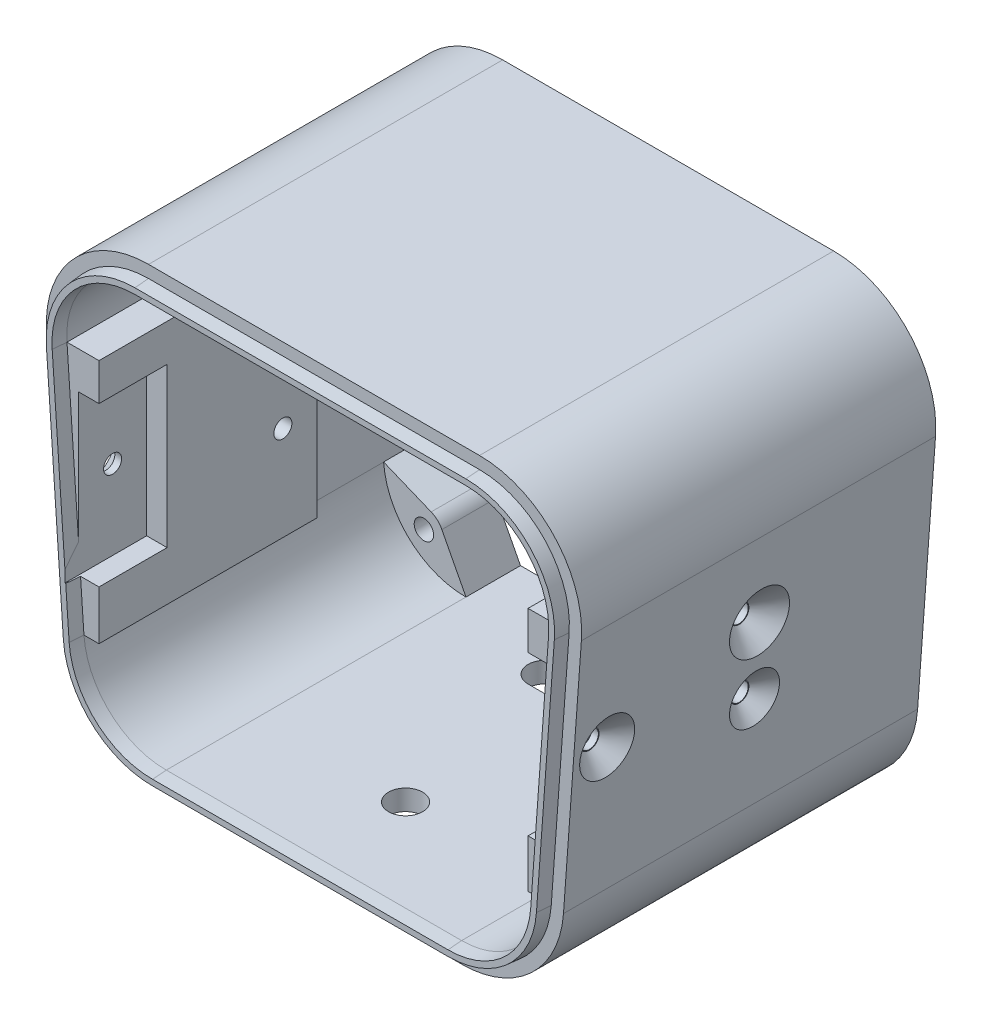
ISO-10303-21;
HEADER;
FILE_DESCRIPTION(('STEP AP214'),'2;1');
FILE_NAME('part.step','',(''),(''),'','','');
FILE_SCHEMA(('AUTOMOTIVE_DESIGN { 1 0 10303 214 1 1 1 1 }'));
ENDSEC;
DATA;
#1=APPLICATION_CONTEXT('core data for automotive mechanical design processes');
#2=APPLICATION_PROTOCOL_DEFINITION('international standard','automotive_design',2000,#1);
#3=PRODUCT_CONTEXT('',#1,'mechanical');
#4=PRODUCT('Part','Part','',(#3));
#5=PRODUCT_RELATED_PRODUCT_CATEGORY('part','',(#4));
#6=PRODUCT_DEFINITION_FORMATION('','',#4);
#7=PRODUCT_DEFINITION_CONTEXT('part definition',#1,'design');
#8=PRODUCT_DEFINITION('design','',#6,#7);
#9=PRODUCT_DEFINITION_SHAPE('','',#8);
#10=(LENGTH_UNIT() NAMED_UNIT(*) SI_UNIT(.MILLI.,.METRE.));
#11=(NAMED_UNIT(*) PLANE_ANGLE_UNIT() SI_UNIT($,.RADIAN.));
#12=(NAMED_UNIT(*) SI_UNIT($,.STERADIAN.) SOLID_ANGLE_UNIT());
#13=UNCERTAINTY_MEASURE_WITH_UNIT(LENGTH_MEASURE(1.E-05),#10,'distance_accuracy_value','');
#14=(GEOMETRIC_REPRESENTATION_CONTEXT(3) GLOBAL_UNCERTAINTY_ASSIGNED_CONTEXT((#13)) GLOBAL_UNIT_ASSIGNED_CONTEXT((#10,
#11,#12)) REPRESENTATION_CONTEXT('',''));
#15=CARTESIAN_POINT('',(0.,0.,0.));
#16=DIRECTION('',(0.,0.,1.));
#17=DIRECTION('',(1.,0.,0.));
#18=AXIS2_PLACEMENT_3D('',#15,#16,#17);
#19=CARTESIAN_POINT('',(31.5,17.122096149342,-33.3287879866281));
#20=DIRECTION('',(-1.,0.,0.));
#21=DIRECTION('',(0.,-1.,0.));
#22=AXIS2_PLACEMENT_3D('',#19,#20,#21);
#23=PLANE('',#22);
#24=CARTESIAN_POINT('',(31.5,5.,25.));
#25=DIRECTION('',(-1.,0.,0.));
#26=DIRECTION('',(0.,-1.,0.));
#27=AXIS2_PLACEMENT_3D('',#24,#25,#26);
#28=CIRCLE('',#27,1.325);
#29=CARTESIAN_POINT('',(31.5,3.675,25.));
#30=VERTEX_POINT('',#29);
#31=EDGE_CURVE('E746',#30,#30,#28,.F.);
#32=ORIENTED_EDGE('',*,*,#31,.T.);
#33=EDGE_LOOP('',(#32));
#34=FACE_BOUND('',#33,.T.);
#35=CARTESIAN_POINT('',(31.5,-5.,25.));
#36=DIRECTION('',(-1.,0.,0.));
#37=DIRECTION('',(0.,-1.,0.));
#38=AXIS2_PLACEMENT_3D('',#35,#36,#37);
#39=CIRCLE('',#38,1.325);
#40=CARTESIAN_POINT('',(31.5,-6.325,25.));
#41=VERTEX_POINT('',#40);
#42=EDGE_CURVE('E751',#41,#41,#39,.F.);
#43=ORIENTED_EDGE('',*,*,#42,.T.);
#44=EDGE_LOOP('',(#43));
#45=FACE_BOUND('',#44,.T.);
#46=DIRECTION('',(0.,0.,1.));
#47=VECTOR('',#46,1.);
#48=CARTESIAN_POINT('',(31.5,17.122096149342,-33.3287879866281));
#49=LINE('',#48,#47);
#50=CARTESIAN_POINT('',(31.5,17.122096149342,20.));
#51=VERTEX_POINT('',#50);
#52=CARTESIAN_POINT('',(31.5,17.122096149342,52.));
#53=VERTEX_POINT('',#52);
#54=EDGE_CURVE('E1043',#51,#53,#49,.T.);
#55=ORIENTED_EDGE('',*,*,#54,.F.);
#56=DIRECTION('',(0.,-1.,0.));
#57=VECTOR('',#56,1.);
#58=CARTESIAN_POINT('',(31.5,17.122096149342,20.));
#59=LINE('',#58,#57);
#60=CARTESIAN_POINT('',(31.5,-18.8779694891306,20.));
#61=VERTEX_POINT('',#60);
#62=EDGE_CURVE('E1328',#51,#61,#59,.T.);
#63=ORIENTED_EDGE('',*,*,#62,.T.);
#64=DIRECTION('',(0.,0.,1.));
#65=VECTOR('',#64,1.);
#66=CARTESIAN_POINT('',(31.5,-18.8779694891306,-33.3287879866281));
#67=LINE('',#66,#65);
#68=CARTESIAN_POINT('',(31.5,-18.8779694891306,52.));
#69=VERTEX_POINT('',#68);
#70=EDGE_CURVE('E1523',#61,#69,#67,.T.);
#71=ORIENTED_EDGE('',*,*,#70,.T.);
#72=DIRECTION('',(0.,-1.,0.));
#73=VECTOR('',#72,1.);
#74=CARTESIAN_POINT('',(31.5,17.122096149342,52.));
#75=LINE('',#74,#73);
#76=CARTESIAN_POINT('',(31.5,-11.8021840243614,52.));
#77=VERTEX_POINT('',#76);
#78=EDGE_CURVE('E1532',#77,#69,#75,.T.);
#79=ORIENTED_EDGE('',*,*,#78,.F.);
#80=DIRECTION('',(0.,0.,-1.));
#81=VECTOR('',#80,1.);
#82=CARTESIAN_POINT('',(31.5,-11.8021840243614,-33.3287879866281));
#83=LINE('',#82,#81);
#84=CARTESIAN_POINT('',(31.5,-11.8021840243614,42.));
#85=VERTEX_POINT('',#84);
#86=EDGE_CURVE('E1254',#77,#85,#83,.T.);
#87=ORIENTED_EDGE('',*,*,#86,.T.);
#88=DIRECTION('',(0.,1.,0.));
#89=VECTOR('',#88,1.);
#90=CARTESIAN_POINT('',(31.5,17.122096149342,42.));
#91=LINE('',#90,#89);
#92=CARTESIAN_POINT('',(31.5,11.5070615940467,42.));
#93=VERTEX_POINT('',#92);
#94=EDGE_CURVE('E1014',#85,#93,#91,.T.);
#95=ORIENTED_EDGE('',*,*,#94,.T.);
#96=DIRECTION('',(0.,0.,1.));
#97=VECTOR('',#96,1.);
#98=CARTESIAN_POINT('',(31.5,11.5070615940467,-33.3287879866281));
#99=LINE('',#98,#97);
#100=CARTESIAN_POINT('',(31.5,11.5070615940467,52.));
#101=VERTEX_POINT('',#100);
#102=EDGE_CURVE('E1017',#93,#101,#99,.T.);
#103=ORIENTED_EDGE('',*,*,#102,.T.);
#104=EDGE_CURVE('E1044',#53,#101,#75,.T.);
#105=ORIENTED_EDGE('',*,*,#104,.F.);
#106=EDGE_LOOP('',(#55,#63,#71,#79,#87,#95,#103,#105));
#107=FACE_BOUND('',#106,.T.);
#108=ADVANCED_FACE('F36',(#34,#45,#107),#23,.T.);
#109=CARTESIAN_POINT('',(-31.5,17.122096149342,-33.3287879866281));
#110=DIRECTION('',(1.,0.,0.));
#111=DIRECTION('',(0.,1.,0.));
#112=AXIS2_PLACEMENT_3D('',#109,#110,#111);
#113=PLANE('',#112);
#114=CARTESIAN_POINT('',(-31.5,4.99999999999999,25.));
#115=DIRECTION('',(1.,0.,0.));
#116=DIRECTION('',(0.,1.,0.));
#117=AXIS2_PLACEMENT_3D('',#114,#115,#116);
#118=CIRCLE('',#117,1.325);
#119=CARTESIAN_POINT('',(-31.5,6.32499999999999,25.));
#120=VERTEX_POINT('',#119);
#121=EDGE_CURVE('E749',#120,#120,#118,.F.);
#122=ORIENTED_EDGE('',*,*,#121,.T.);
#123=EDGE_LOOP('',(#122));
#124=FACE_BOUND('',#123,.T.);
#125=CARTESIAN_POINT('',(-31.5,-5.00000000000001,25.));
#126=DIRECTION('',(1.,0.,0.));
#127=DIRECTION('',(0.,1.,0.));
#128=AXIS2_PLACEMENT_3D('',#125,#126,#127);
#129=CIRCLE('',#128,1.325);
#130=CARTESIAN_POINT('',(-31.5,-3.67500000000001,25.));
#131=VERTEX_POINT('',#130);
#132=EDGE_CURVE('E750',#131,#131,#129,.F.);
#133=ORIENTED_EDGE('',*,*,#132,.T.);
#134=EDGE_LOOP('',(#133));
#135=FACE_BOUND('',#134,.T.);
#136=DIRECTION('',(0.,0.,1.));
#137=VECTOR('',#136,1.);
#138=CARTESIAN_POINT('',(-31.5,-18.8779694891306,-33.3287879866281));
#139=LINE('',#138,#137);
#140=CARTESIAN_POINT('',(-31.5,-18.8779694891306,20.));
#141=VERTEX_POINT('',#140);
#142=CARTESIAN_POINT('',(-31.5,-18.8779694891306,52.));
#143=VERTEX_POINT('',#142);
#144=EDGE_CURVE('E947',#141,#143,#139,.T.);
#145=ORIENTED_EDGE('',*,*,#144,.F.);
#146=DIRECTION('',(0.,1.,0.));
#147=VECTOR('',#146,1.);
#148=CARTESIAN_POINT('',(-31.5,17.122096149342,20.));
#149=LINE('',#148,#147);
#150=CARTESIAN_POINT('',(-31.5,17.122096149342,20.));
#151=VERTEX_POINT('',#150);
#152=EDGE_CURVE('E1319',#141,#151,#149,.T.);
#153=ORIENTED_EDGE('',*,*,#152,.T.);
#154=DIRECTION('',(0.,0.,1.));
#155=VECTOR('',#154,1.);
#156=CARTESIAN_POINT('',(-31.5,17.122096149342,-33.3287879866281));
#157=LINE('',#156,#155);
#158=CARTESIAN_POINT('',(-31.5,17.122096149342,52.));
#159=VERTEX_POINT('',#158);
#160=EDGE_CURVE('E953',#151,#159,#157,.T.);
#161=ORIENTED_EDGE('',*,*,#160,.T.);
#162=DIRECTION('',(0.,1.,0.));
#163=VECTOR('',#162,1.);
#164=CARTESIAN_POINT('',(-31.5,17.122096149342,52.));
#165=LINE('',#164,#163);
#166=CARTESIAN_POINT('',(-31.5,11.6544949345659,52.));
#167=VERTEX_POINT('',#166);
#168=EDGE_CURVE('E944',#167,#159,#165,.T.);
#169=ORIENTED_EDGE('',*,*,#168,.F.);
#170=DIRECTION('',(0.,0.,-1.));
#171=VECTOR('',#170,1.);
#172=CARTESIAN_POINT('',(-31.5,11.6544949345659,-33.3287879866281));
#173=LINE('',#172,#171);
#174=CARTESIAN_POINT('',(-31.5,11.6544949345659,42.));
#175=VERTEX_POINT('',#174);
#176=EDGE_CURVE('E1005',#167,#175,#173,.T.);
#177=ORIENTED_EDGE('',*,*,#176,.T.);
#178=DIRECTION('',(0.,1.,0.));
#179=VECTOR('',#178,1.);
#180=CARTESIAN_POINT('',(-31.5,17.122096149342,42.));
#181=LINE('',#180,#179);
#182=CARTESIAN_POINT('',(-31.5,-11.654494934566,42.));
#183=VERTEX_POINT('',#182);
#184=EDGE_CURVE('E1003',#183,#175,#181,.T.);
#185=ORIENTED_EDGE('',*,*,#184,.F.);
#186=DIRECTION('',(0.,0.,1.));
#187=VECTOR('',#186,1.);
#188=CARTESIAN_POINT('',(-31.5,-11.654494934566,-33.3287879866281));
#189=LINE('',#188,#187);
#190=CARTESIAN_POINT('',(-31.5,-11.654494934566,52.));
#191=VERTEX_POINT('',#190);
#192=EDGE_CURVE('E1223',#183,#191,#189,.T.);
#193=ORIENTED_EDGE('',*,*,#192,.T.);
#194=EDGE_CURVE('E935',#143,#191,#165,.T.);
#195=ORIENTED_EDGE('',*,*,#194,.F.);
#196=EDGE_LOOP('',(#145,#153,#161,#169,#177,#185,#193,#195));
#197=FACE_BOUND('',#196,.T.);
#198=ADVANCED_FACE('F855',(#124,#135,#197),#113,.T.);
#199=CARTESIAN_POINT('',(-36.1956133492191,17.122096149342,-33.3287879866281));
#200=DIRECTION('',(0.,1.,0.));
#201=DIRECTION('',(0.,0.,1.));
#202=AXIS2_PLACEMENT_3D('',#199,#200,#201);
#203=PLANE('',#202);
#204=ORIENTED_EDGE('',*,*,#160,.F.);
#205=DIRECTION('',(-1.,0.,0.));
#206=VECTOR('',#205,1.);
#207=CARTESIAN_POINT('',(-36.1956133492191,17.122096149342,20.));
#208=LINE('',#207,#206);
#209=CARTESIAN_POINT('',(-36.195613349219,17.1220961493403,20.));
#210=VERTEX_POINT('',#209);
#211=EDGE_CURVE('E1316',#151,#210,#208,.T.);
#212=ORIENTED_EDGE('',*,*,#211,.T.);
#213=DIRECTION('',(0.,0.,-1.));
#214=VECTOR('',#213,1.);
#215=CARTESIAN_POINT('',(-36.1956133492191,17.122096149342,52.));
#216=LINE('',#215,#214);
#217=CARTESIAN_POINT('',(-36.1956133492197,17.12209614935,52.));
#218=VERTEX_POINT('',#217);
#219=EDGE_CURVE('E959',#218,#210,#216,.T.);
#220=ORIENTED_EDGE('',*,*,#219,.F.);
#221=DIRECTION('',(-1.,0.,0.));
#222=VECTOR('',#221,1.);
#223=CARTESIAN_POINT('',(-36.1956133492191,17.122096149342,52.));
#224=LINE('',#223,#222);
#225=EDGE_CURVE('E943',#159,#218,#224,.T.);
#226=ORIENTED_EDGE('',*,*,#225,.F.);
#227=EDGE_LOOP('',(#204,#212,#220,#226));
#228=FACE_BOUND('',#227,.T.);
#229=ADVANCED_FACE('F861',(#228),#203,.T.);
#230=CARTESIAN_POINT('',(-33.7075469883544,-18.8779694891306,-33.3287879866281));
#231=DIRECTION('',(0.,-1.,0.));
#232=DIRECTION('',(0.,0.,-1.));
#233=AXIS2_PLACEMENT_3D('',#230,#231,#232);
#234=PLANE('',#233);
#235=DIRECTION('',(0.,0.,-1.));
#236=VECTOR('',#235,1.);
#237=CARTESIAN_POINT('',(-33.7075469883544,-18.8779694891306,52.));
#238=LINE('',#237,#236);
#239=CARTESIAN_POINT('',(-33.7075469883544,-18.8779694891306,52.));
#240=VERTEX_POINT('',#239);
#241=CARTESIAN_POINT('',(-33.7075469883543,-18.8779694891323,20.));
#242=VERTEX_POINT('',#241);
#243=EDGE_CURVE('E800',#240,#242,#238,.T.);
#244=ORIENTED_EDGE('',*,*,#243,.T.);
#245=DIRECTION('',(1.,0.,0.));
#246=VECTOR('',#245,1.);
#247=CARTESIAN_POINT('',(-33.7075469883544,-18.8779694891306,20.));
#248=LINE('',#247,#246);
#249=EDGE_CURVE('E1322',#242,#141,#248,.T.);
#250=ORIENTED_EDGE('',*,*,#249,.T.);
#251=ORIENTED_EDGE('',*,*,#144,.T.);
#252=DIRECTION('',(1.,0.,0.));
#253=VECTOR('',#252,1.);
#254=CARTESIAN_POINT('',(-33.7075469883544,-18.8779694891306,52.));
#255=LINE('',#254,#253);
#256=EDGE_CURVE('E939',#240,#143,#255,.T.);
#257=ORIENTED_EDGE('',*,*,#256,.F.);
#258=EDGE_LOOP('',(#244,#250,#251,#257));
#259=FACE_BOUND('',#258,.T.);
#260=ADVANCED_FACE('F877',(#259),#234,.T.);
#261=CARTESIAN_POINT('',(33.7075469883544,-18.8779694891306,-33.3287879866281));
#262=DIRECTION('',(0.,-1.,0.));
#263=DIRECTION('',(0.,0.,-1.));
#264=AXIS2_PLACEMENT_3D('',#261,#262,#263);
#265=PLANE('',#264);
#266=ORIENTED_EDGE('',*,*,#70,.F.);
#267=DIRECTION('',(1.,0.,0.));
#268=VECTOR('',#267,1.);
#269=CARTESIAN_POINT('',(33.7075469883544,-18.8779694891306,20.));
#270=LINE('',#269,#268);
#271=CARTESIAN_POINT('',(33.7075467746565,-18.8779694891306,20.));
#272=VERTEX_POINT('',#271);
#273=EDGE_CURVE('E1325',#61,#272,#270,.T.);
#274=ORIENTED_EDGE('',*,*,#273,.T.);
#275=DIRECTION('',(0.,0.,1.));
#276=VECTOR('',#275,1.);
#277=CARTESIAN_POINT('',(33.7075469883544,-18.8779694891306,-33.3287879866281));
#278=LINE('',#277,#276);
#279=CARTESIAN_POINT('',(33.7075467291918,-18.8779694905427,52.));
#280=VERTEX_POINT('',#279);
#281=EDGE_CURVE('E1040',#272,#280,#278,.T.);
#282=ORIENTED_EDGE('',*,*,#281,.T.);
#283=DIRECTION('',(1.,0.,0.));
#284=VECTOR('',#283,1.);
#285=CARTESIAN_POINT('',(33.7075469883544,-18.8779694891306,52.));
#286=LINE('',#285,#284);
#287=EDGE_CURVE('E1050',#69,#280,#286,.T.);
#288=ORIENTED_EDGE('',*,*,#287,.F.);
#289=EDGE_LOOP('',(#266,#274,#282,#288));
#290=FACE_BOUND('',#289,.T.);
#291=ADVANCED_FACE('F873',(#290),#265,.T.);
#292=CARTESIAN_POINT('',(31.5,17.122096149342,-33.3287879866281));
#293=DIRECTION('',(-0.00110268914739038,0.999999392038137,0.));
#294=DIRECTION('',(-0.999999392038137,-0.00110268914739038,0.));
#295=AXIS2_PLACEMENT_3D('',#292,#293,#294);
#296=PLANE('',#295);
#297=DIRECTION('',(0.,0.,-1.));
#298=VECTOR('',#297,1.);
#299=CARTESIAN_POINT('',(36.3365370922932,17.127429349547,52.));
#300=LINE('',#299,#298);
#301=CARTESIAN_POINT('',(36.3365370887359,17.1274293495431,52.));
#302=VERTEX_POINT('',#301);
#303=CARTESIAN_POINT('',(36.3365370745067,17.1274293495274,20.));
#304=VERTEX_POINT('',#303);
#305=EDGE_CURVE('E963',#302,#304,#300,.T.);
#306=ORIENTED_EDGE('',*,*,#305,.T.);
#307=DIRECTION('',(-0.999999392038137,-0.00110268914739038,0.));
#308=VECTOR('',#307,1.);
#309=CARTESIAN_POINT('',(31.5,17.122096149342,20.));
#310=LINE('',#309,#308);
#311=EDGE_CURVE('E1037',#304,#51,#310,.T.);
#312=ORIENTED_EDGE('',*,*,#311,.T.);
#313=ORIENTED_EDGE('',*,*,#54,.T.);
#314=DIRECTION('',(-0.999999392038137,-0.00110268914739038,0.));
#315=VECTOR('',#314,1.);
#316=CARTESIAN_POINT('',(31.5,17.122096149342,52.));
#317=LINE('',#316,#315);
#318=EDGE_CURVE('E1053',#302,#53,#317,.T.);
#319=ORIENTED_EDGE('',*,*,#318,.F.);
#320=EDGE_LOOP('',(#306,#312,#313,#319));
#321=FACE_BOUND('',#320,.T.);
#322=ADVANCED_FACE('F869',(#321),#296,.T.);
#323=CARTESIAN_POINT('',(-21.7396624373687,-18.0006215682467,54.));
#324=DIRECTION('',(0.,0.,1.));
#325=DIRECTION('',(1.,0.,0.));
#326=AXIS2_PLACEMENT_3D('',#323,#324,#325);
#327=PLANE('',#326);
#328=CARTESIAN_POINT('',(-21.7396624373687,-18.0006215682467,54.));
#329=DIRECTION('',(0.,0.,1.));
#330=DIRECTION('',(1.,0.,0.));
#331=AXIS2_PLACEMENT_3D('',#328,#329,#330);
#332=CIRCLE('',#331,13.0250226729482);
#333=CARTESIAN_POINT('',(-34.7299858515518,-18.950733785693,54.));
#334=VERTEX_POINT('',#333);
#335=CARTESIAN_POINT('',(-21.6124166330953,-31.0250226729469,54.));
#336=VERTEX_POINT('',#335);
#337=EDGE_CURVE('E1125',#334,#336,#332,.T.);
#338=ORIENTED_EDGE('',*,*,#337,.T.);
#339=DIRECTION('',(-1.,1.4290983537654E-09,0.));
#340=VECTOR('',#339,1.);
#341=CARTESIAN_POINT('',(-21.6115647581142,-31.0250226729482,54.));
#342=LINE('',#341,#340);
#343=CARTESIAN_POINT('',(21.7431251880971,-31.0250227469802,54.));
#344=VERTEX_POINT('',#343);
#345=EDGE_CURVE('E1123',#336,#344,#342,.F.);
#346=ORIENTED_EDGE('',*,*,#345,.T.);
#347=CARTESIAN_POINT('',(21.7397077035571,-18.0000005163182,54.));
#348=DIRECTION('',(0.,0.,1.));
#349=DIRECTION('',(1.,0.,0.));
#350=AXIS2_PLACEMENT_3D('',#347,#348,#349);
#351=CIRCLE('',#350,13.0250226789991);
#352=CARTESIAN_POINT('',(34.7302664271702,-18.9468901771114,54.));
#353=VERTEX_POINT('',#352);
#354=EDGE_CURVE('E1121',#344,#353,#351,.T.);
#355=ORIENTED_EDGE('',*,*,#354,.T.);
#356=DIRECTION('',(-0.0728226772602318,-0.99734490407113,0.));
#357=VECTOR('',#356,1.);
#358=CARTESIAN_POINT('',(34.7302664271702,-18.9468901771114,54.));
#359=LINE('',#358,#357);
#360=CARTESIAN_POINT('',(37.3588463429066,17.0528956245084,54.));
#361=VERTEX_POINT('',#360);
#362=EDGE_CURVE('E1119',#353,#361,#359,.F.);
#363=ORIENTED_EDGE('',*,*,#362,.T.);
#364=CARTESIAN_POINT('',(24.3683032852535,18.,54.));
#365=DIRECTION('',(0.,0.,1.));
#366=DIRECTION('',(1.,0.,0.));
#367=AXIS2_PLACEMENT_3D('',#364,#365,#366);
#368=CIRCLE('',#367,13.0250226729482);
#369=CARTESIAN_POINT('',(24.3683032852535,31.0250226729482,54.));
#370=VERTEX_POINT('',#369);
#371=EDGE_CURVE('E1117',#361,#370,#368,.T.);
#372=ORIENTED_EDGE('',*,*,#371,.T.);
#373=DIRECTION('',(1.,0.,0.));
#374=VECTOR('',#373,1.);
#375=CARTESIAN_POINT('',(24.3683032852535,31.0250226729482,54.));
#376=LINE('',#375,#374);
#377=CARTESIAN_POINT('',(-24.2277695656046,31.0250226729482,54.));
#378=VERTEX_POINT('',#377);
#379=EDGE_CURVE('E1115',#370,#378,#376,.F.);
#380=ORIENTED_EDGE('',*,*,#379,.T.);
#381=CARTESIAN_POINT('',(-24.2277695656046,18.,54.));
#382=DIRECTION('',(0.,0.,1.));
#383=DIRECTION('',(1.,0.,0.));
#384=AXIS2_PLACEMENT_3D('',#381,#382,#383);
#385=CIRCLE('',#384,13.0250226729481);
#386=CARTESIAN_POINT('',(-37.2180506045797,17.0493085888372,54.));
#387=VERTEX_POINT('',#386);
#388=EDGE_CURVE('E1113',#378,#387,#385,.T.);
#389=ORIENTED_EDGE('',*,*,#388,.T.);
#390=DIRECTION('',(-0.0689483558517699,0.99762023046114,0.));
#391=VECTOR('',#390,1.);
#392=CARTESIAN_POINT('',(-37.2180262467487,17.048956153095,54.));
#393=LINE('',#392,#391);
#394=EDGE_CURVE('E1110',#387,#334,#393,.F.);
#395=ORIENTED_EDGE('',*,*,#394,.T.);
#396=EDGE_LOOP('',(#338,#346,#355,#363,#372,#380,#389,#395));
#397=FACE_BOUND('',#396,.T.);
#398=DIRECTION('',(0.0728226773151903,0.997344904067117,0.));
#399=VECTOR('',#398,1.);
#400=CARTESIAN_POINT('',(33.8824726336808,-18.8850615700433,54.));
#401=LINE('',#400,#399);
#402=CARTESIAN_POINT('',(34.4482073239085,-11.1370271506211,54.));
#403=VERTEX_POINT('',#402);
#404=CARTESIAN_POINT('',(36.511054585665,17.1147521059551,54.));
#405=VERTEX_POINT('',#404);
#406=EDGE_CURVE('E1488',#403,#405,#401,.T.);
#407=ORIENTED_EDGE('',*,*,#406,.F.);
#408=DIRECTION('',(-0.00468443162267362,-0.999989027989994,0.));
#409=VECTOR('',#408,1.);
#410=CARTESIAN_POINT('',(34.4148226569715,-18.2636763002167,54.));
#411=LINE('',#410,#409);
#412=CARTESIAN_POINT('',(34.445026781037,-11.8159799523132,54.));
#413=VERTEX_POINT('',#412);
#414=EDGE_CURVE('E1248',#403,#413,#411,.T.);
#415=ORIENTED_EDGE('',*,*,#414,.T.);
#416=DIRECTION('',(-0.999989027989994,0.00468443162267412,0.));
#417=VECTOR('',#416,1.);
#418=CARTESIAN_POINT('',(-21.7094583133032,-11.5529252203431,54.));
#419=LINE('',#418,#417);
#420=CARTESIAN_POINT('',(34.3986484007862,-11.8157626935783,54.));
#421=VERTEX_POINT('',#420);
#422=EDGE_CURVE('E1257',#413,#421,#419,.T.);
#423=ORIENTED_EDGE('',*,*,#422,.T.);
#424=CARTESIAN_POINT('',(33.8824742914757,-18.8850389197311,54.));
#425=VERTEX_POINT('',#424);
#426=EDGE_CURVE('E1493',#425,#421,#401,.T.);
#427=ORIENTED_EDGE('',*,*,#426,.F.);
#428=CARTESIAN_POINT('',(21.7397077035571,-18.0000005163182,54.));
#429=DIRECTION('',(0.,0.,1.));
#430=DIRECTION('',(1.,0.,0.));
#431=AXIS2_PLACEMENT_3D('',#428,#429,#430);
#432=CIRCLE('',#431,12.1749773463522);
#433=CARTESIAN_POINT('',(21.7430136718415,-30.1749774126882,54.));
#434=VERTEX_POINT('',#433);
#435=EDGE_CURVE('E1494',#434,#425,#432,.T.);
#436=ORIENTED_EDGE('',*,*,#435,.F.);
#437=DIRECTION('',(1.,-1.97518004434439E-09,0.));
#438=VECTOR('',#437,1.);
#439=CARTESIAN_POINT('',(-21.6175262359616,-30.1749773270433,54.));
#440=LINE('',#439,#438);
#441=CARTESIAN_POINT('',(-21.6166389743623,-30.1749773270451,54.));
#442=VERTEX_POINT('',#441);
#443=EDGE_CURVE('E1497',#442,#434,#440,.T.);
#444=ORIENTED_EDGE('',*,*,#443,.F.);
#445=CARTESIAN_POINT('',(-21.7396624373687,-18.0006215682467,54.));
#446=DIRECTION('',(0.,0.,1.));
#447=DIRECTION('',(1.,0.,0.));
#448=AXIS2_PLACEMENT_3D('',#445,#446,#447);
#449=CIRCLE('',#448,12.1749773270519);
#450=CARTESIAN_POINT('',(-33.8820828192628,-18.8903969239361,54.));
#451=VERTEX_POINT('',#450);
#452=EDGE_CURVE('E1090',#451,#442,#449,.T.);
#453=ORIENTED_EDGE('',*,*,#452,.F.);
#454=DIRECTION('',(0.0689483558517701,-0.99762023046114,0.));
#455=VECTOR('',#454,1.);
#456=CARTESIAN_POINT('',(-36.3701742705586,17.1100317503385,54.));
#457=LINE('',#456,#455);
#458=CARTESIAN_POINT('',(-34.3821764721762,-11.654494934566,54.));
#459=VERTEX_POINT('',#458);
#460=EDGE_CURVE('E1517',#459,#451,#457,.T.);
#461=ORIENTED_EDGE('',*,*,#460,.F.);
#462=DIRECTION('',(-1.,0.,0.));
#463=VECTOR('',#462,1.);
#464=CARTESIAN_POINT('',(-21.7396624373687,-11.654494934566,54.));
#465=LINE('',#464,#463);
#466=CARTESIAN_POINT('',(-34.5,-11.654494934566,54.));
#467=VERTEX_POINT('',#466);
#468=EDGE_CURVE('E1226',#459,#467,#465,.T.);
#469=ORIENTED_EDGE('',*,*,#468,.T.);
#470=DIRECTION('',(0.,1.,0.));
#471=VECTOR('',#470,1.);
#472=CARTESIAN_POINT('',(-34.5,-18.0006215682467,54.));
#473=LINE('',#472,#471);
#474=CARTESIAN_POINT('',(-34.5,-9.94969525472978,54.));
#475=VERTEX_POINT('',#474);
#476=EDGE_CURVE('E1220',#467,#475,#473,.T.);
#477=ORIENTED_EDGE('',*,*,#476,.T.);
#478=CARTESIAN_POINT('',(-36.3701489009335,17.1096646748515,54.));
#479=VERTEX_POINT('',#478);
#480=EDGE_CURVE('E1109',#479,#475,#457,.T.);
#481=ORIENTED_EDGE('',*,*,#480,.F.);
#482=CARTESIAN_POINT('',(-24.2277695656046,18.,54.));
#483=DIRECTION('',(0.,0.,1.));
#484=DIRECTION('',(1.,0.,0.));
#485=AXIS2_PLACEMENT_3D('',#482,#483,#484);
#486=CIRCLE('',#485,12.1749773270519);
#487=CARTESIAN_POINT('',(-24.2277695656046,30.1749773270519,54.));
#488=VERTEX_POINT('',#487);
#489=EDGE_CURVE('E2472',#488,#479,#486,.T.);
#490=ORIENTED_EDGE('',*,*,#489,.F.);
#491=DIRECTION('',(-1.,0.,0.));
#492=VECTOR('',#491,1.);
#493=CARTESIAN_POINT('',(24.3683032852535,30.1749773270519,54.));
#494=LINE('',#493,#492);
#495=CARTESIAN_POINT('',(24.3683032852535,30.1749773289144,54.));
#496=VERTEX_POINT('',#495);
#497=EDGE_CURVE('E1681',#496,#488,#494,.T.);
#498=ORIENTED_EDGE('',*,*,#497,.F.);
#499=CARTESIAN_POINT('',(24.3683032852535,18.,54.));
#500=DIRECTION('',(0.,0.,1.));
#501=DIRECTION('',(1.,0.,0.));
#502=AXIS2_PLACEMENT_3D('',#499,#500,#501);
#503=CIRCLE('',#502,12.1749773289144);
#504=EDGE_CURVE('E1490',#405,#496,#503,.T.);
#505=ORIENTED_EDGE('',*,*,#504,.F.);
#506=EDGE_LOOP('',(#407,#415,#423,#427,#436,#444,#453,#461,#469,#477,#481,#490,#498,#505));
#507=FACE_BOUND('',#506,.T.);
#508=ADVANCED_FACE('F872',(#397,#507),#327,.T.);
#509=CARTESIAN_POINT('',(-21.7396624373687,-18.0006215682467,52.));
#510=DIRECTION('',(0.,0.,1.));
#511=DIRECTION('',(1.,0.,0.));
#512=AXIS2_PLACEMENT_3D('',#509,#510,#511);
#513=PLANE('',#512);
#514=DIRECTION('',(0.999989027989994,-0.00468443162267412,0.));
#515=VECTOR('',#514,1.);
#516=CARTESIAN_POINT('',(-21.6002689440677,11.7558089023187,52.));
#517=LINE('',#516,#515);
#518=CARTESIAN_POINT('',(34.5542161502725,11.4927541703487,52.));
#519=VERTEX_POINT('',#518);
#520=EDGE_CURVE('E1242',#101,#519,#517,.T.);
#521=ORIENTED_EDGE('',*,*,#520,.T.);
#522=DIRECTION('',(-0.00468443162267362,-0.999989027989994,0.));
#523=VECTOR('',#522,1.);
#524=CARTESIAN_POINT('',(34.4148226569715,-18.2636763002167,52.));
#525=LINE('',#524,#523);
#526=CARTESIAN_POINT('',(34.4602347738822,-8.56951865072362,52.));
#527=VERTEX_POINT('',#526);
#528=EDGE_CURVE('E1251',#519,#527,#525,.T.);
#529=ORIENTED_EDGE('',*,*,#528,.T.);
#530=DIRECTION('',(0.0728226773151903,0.997344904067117,0.));
#531=VECTOR('',#530,1.);
#532=CARTESIAN_POINT('',(33.7079598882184,-18.872319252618,52.));
#533=LINE('',#532,#531);
#534=EDGE_CURVE('E1209',#527,#302,#533,.T.);
#535=ORIENTED_EDGE('',*,*,#534,.T.);
#536=ORIENTED_EDGE('',*,*,#318,.T.);
#537=ORIENTED_EDGE('',*,*,#104,.T.);
#538=EDGE_LOOP('',(#521,#529,#535,#536,#537));
#539=FACE_BOUND('',#538,.T.);
#540=ADVANCED_FACE('F910',(#539),#513,.T.);
#541=CARTESIAN_POINT('',(33.7079598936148,-18.8723192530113,52.));
#542=VERTEX_POINT('',#541);
#543=CARTESIAN_POINT('',(34.2232652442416,-11.8149411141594,52.));
#544=VERTEX_POINT('',#543);
#545=EDGE_CURVE('E1205',#542,#544,#533,.T.);
#546=ORIENTED_EDGE('',*,*,#545,.T.);
#547=DIRECTION('',(-0.999989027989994,0.00468443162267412,0.));
#548=VECTOR('',#547,1.);
#549=CARTESIAN_POINT('',(-21.7094583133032,-11.5529252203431,52.));
#550=LINE('',#549,#548);
#551=EDGE_CURVE('E1260',#544,#77,#550,.T.);
#552=ORIENTED_EDGE('',*,*,#551,.T.);
#553=ORIENTED_EDGE('',*,*,#78,.T.);
#554=ORIENTED_EDGE('',*,*,#287,.T.);
#555=CARTESIAN_POINT('',(21.7397077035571,-18.0000005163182,52.));
#556=DIRECTION('',(0.,0.,1.));
#557=DIRECTION('',(1.,0.,0.));
#558=AXIS2_PLACEMENT_3D('',#555,#556,#557);
#559=CIRCLE('',#558,12.0000000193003);
#560=EDGE_CURVE('E745',#280,#542,#559,.T.);
#561=ORIENTED_EDGE('',*,*,#560,.T.);
#562=EDGE_LOOP('',(#546,#552,#553,#554,#561));
#563=FACE_BOUND('',#562,.T.);
#564=ADVANCED_FACE('F915',(#563),#513,.T.);
#565=CARTESIAN_POINT('',(118.5,0.,47.));
#566=DIRECTION('',(-1.,0.,0.));
#567=DIRECTION('',(0.,-1.,0.));
#568=AXIS2_PLACEMENT_3D('',#565,#566,#567);
#569=CYLINDRICAL_SURFACE('',#568,1.325);
#570=CARTESIAN_POINT('',(35.5,0.,47.));
#571=DIRECTION('',(-1.,0.,0.));
#572=DIRECTION('',(0.,-1.,0.));
#573=AXIS2_PLACEMENT_3D('',#570,#571,#572);
#574=CIRCLE('',#573,1.325);
#575=CARTESIAN_POINT('',(35.5,-1.325,47.));
#576=VERTEX_POINT('',#575);
#577=EDGE_CURVE('E778',#576,#576,#574,.T.);
#578=ORIENTED_EDGE('',*,*,#577,.F.);
#579=EDGE_LOOP('',(#578));
#580=FACE_BOUND('',#579,.T.);
#581=CARTESIAN_POINT('',(34.5003785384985,0.,47.));
#582=DIRECTION('',(-0.999989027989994,0.00468443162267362,0.));
#583=DIRECTION('',(-0.00468443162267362,-0.999989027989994,0.));
#584=AXIS2_PLACEMENT_3D('',#581,#582,#583);
#585=ELLIPSE('',#584,1.32501453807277,1.325);
#586=CARTESIAN_POINT('',(34.4941715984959,-1.325,47.));
#587=VERTEX_POINT('',#586);
#588=EDGE_CURVE('E1245',#587,#587,#585,.T.);
#589=ORIENTED_EDGE('',*,*,#588,.T.);
#590=EDGE_LOOP('',(#589));
#591=FACE_BOUND('',#590,.T.);
#592=ADVANCED_FACE('F928',(#580,#591),#569,.F.);
#593=CARTESIAN_POINT('',(33.7079598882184,-18.872319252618,52.));
#594=DIRECTION('',(-0.993549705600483,0.0725455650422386,0.0871557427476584));
#595=DIRECTION('',(0.0873859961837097,0.,0.996174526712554));
#596=AXIS2_PLACEMENT_3D('',#593,#594,#595);
#597=PLANE('',#596);
#598=ORIENTED_EDGE('',*,*,#534,.F.);
#599=DIRECTION('',(-0.0036955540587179,-0.788892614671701,0.614519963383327));
#600=VECTOR('',#599,1.);
#601=CARTESIAN_POINT('',(34.4301877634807,-14.9836758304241,56.9964057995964));
#602=LINE('',#601,#600);
#603=EDGE_CURVE('E1011',#527,#403,#602,.T.);
#604=ORIENTED_EDGE('',*,*,#603,.T.);
#605=ORIENTED_EDGE('',*,*,#406,.T.);
#606=DIRECTION('',(-0.0869243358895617,0.00634691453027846,-0.996194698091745));
#607=VECTOR('',#606,1.);
#608=CARTESIAN_POINT('',(36.3365418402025,17.1274944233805,52.));
#609=LINE('',#608,#607);
#610=CARTESIAN_POINT('',(36.3365418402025,17.1274944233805,52.));
#611=VERTEX_POINT('',#610);
#612=EDGE_CURVE('E1064',#405,#611,#609,.T.);
#613=ORIENTED_EDGE('',*,*,#612,.T.);
#614=CARTESIAN_POINT('',(24.3683032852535,18.,52.));
#615=DIRECTION('',(0.,0.,1.));
#616=DIRECTION('',(1.,0.,0.));
#617=AXIS2_PLACEMENT_3D('',#614,#615,#616);
#618=CIRCLE('',#617,12.);
#619=EDGE_CURVE('E783',#302,#611,#618,.T.);
#620=ORIENTED_EDGE('',*,*,#619,.F.);
#621=EDGE_LOOP('',(#598,#604,#605,#613,#620));
#622=FACE_BOUND('',#621,.T.);
#623=ADVANCED_FACE('F1621',(#622),#597,.T.);
#624=ORIENTED_EDGE('',*,*,#426,.T.);
#625=DIRECTION('',(-0.087356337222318,0.000409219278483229,-0.996177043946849));
#626=VECTOR('',#625,1.);
#627=CARTESIAN_POINT('',(34.2195851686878,-11.8149238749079,51.9580338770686));
#628=LINE('',#627,#626);
#629=EDGE_CURVE('E1008',#421,#544,#628,.T.);
#630=ORIENTED_EDGE('',*,*,#629,.T.);
#631=ORIENTED_EDGE('',*,*,#545,.F.);
#632=DIRECTION('',(-0.0869251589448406,0.00633563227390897,-0.996194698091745));
#633=VECTOR('',#632,1.);
#634=CARTESIAN_POINT('',(33.7079598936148,-18.8723192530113,52.));
#635=LINE('',#634,#633);
#636=EDGE_CURVE('E1057',#425,#542,#635,.T.);
#637=ORIENTED_EDGE('',*,*,#636,.F.);
#638=EDGE_LOOP('',(#624,#630,#631,#637));
#639=FACE_BOUND('',#638,.T.);
#640=ADVANCED_FACE('F929',(#639),#597,.T.);
#641=DIRECTION('',(0.,1.,0.));
#642=VECTOR('',#641,1.);
#643=CARTESIAN_POINT('',(-34.5,-18.0006215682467,52.));
#644=LINE('',#643,#642);
#645=CARTESIAN_POINT('',(-34.5,-7.41189250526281,52.));
#646=VERTEX_POINT('',#645);
#647=CARTESIAN_POINT('',(-34.5,11.6544949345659,52.));
#648=VERTEX_POINT('',#647);
#649=EDGE_CURVE('E1217',#646,#648,#644,.T.);
#650=ORIENTED_EDGE('',*,*,#649,.T.);
#651=DIRECTION('',(1.,0.,0.));
#652=VECTOR('',#651,1.);
#653=CARTESIAN_POINT('',(-21.7396624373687,11.6544949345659,52.));
#654=LINE('',#653,#652);
#655=EDGE_CURVE('E1210',#648,#167,#654,.T.);
#656=ORIENTED_EDGE('',*,*,#655,.T.);
#657=ORIENTED_EDGE('',*,*,#168,.T.);
#658=ORIENTED_EDGE('',*,*,#225,.T.);
#659=DIRECTION('',(0.0689483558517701,-0.99762023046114,0.));
#660=VECTOR('',#659,1.);
#661=CARTESIAN_POINT('',(-36.1956133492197,17.12209614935,52.));
#662=LINE('',#661,#660);
#663=EDGE_CURVE('E1201',#218,#646,#662,.T.);
#664=ORIENTED_EDGE('',*,*,#663,.T.);
#665=EDGE_LOOP('',(#650,#656,#657,#658,#664));
#666=FACE_BOUND('',#665,.T.);
#667=ADVANCED_FACE('F919',(#666),#513,.T.);
#668=ORIENTED_EDGE('',*,*,#194,.T.);
#669=DIRECTION('',(-1.,0.,0.));
#670=VECTOR('',#669,1.);
#671=CARTESIAN_POINT('',(-21.7396624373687,-11.654494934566,52.));
#672=LINE('',#671,#670);
#673=CARTESIAN_POINT('',(-34.2067817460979,-11.654494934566,52.));
#674=VERTEX_POINT('',#673);
#675=EDGE_CURVE('E936',#191,#674,#672,.T.);
#676=ORIENTED_EDGE('',*,*,#675,.T.);
#677=EDGE_CURVE('E1204',#674,#240,#662,.T.);
#678=ORIENTED_EDGE('',*,*,#677,.T.);
#679=ORIENTED_EDGE('',*,*,#256,.T.);
#680=EDGE_LOOP('',(#668,#676,#678,#679));
#681=FACE_BOUND('',#680,.T.);
#682=ADVANCED_FACE('F911',(#681),#513,.T.);
#683=CARTESIAN_POINT('',(-35.5,0.,47.));
#684=DIRECTION('',(1.,0.,0.));
#685=DIRECTION('',(0.,1.,0.));
#686=AXIS2_PLACEMENT_3D('',#683,#684,#685);
#687=CIRCLE('',#686,1.325);
#688=CARTESIAN_POINT('',(-35.5,1.32499999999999,47.));
#689=VERTEX_POINT('',#688);
#690=EDGE_CURVE('E763',#689,#689,#687,.T.);
#691=ORIENTED_EDGE('',*,*,#690,.F.);
#692=EDGE_LOOP('',(#691));
#693=FACE_BOUND('',#692,.T.);
#694=CARTESIAN_POINT('',(-34.5,0.,47.));
#695=DIRECTION('',(1.,0.,0.));
#696=DIRECTION('',(0.,0.,-1.));
#697=AXIS2_PLACEMENT_3D('',#694,#695,#696);
#698=CIRCLE('',#697,1.325);
#699=CARTESIAN_POINT('',(-34.5,0.,45.675));
#700=VERTEX_POINT('',#699);
#701=EDGE_CURVE('E1214',#700,#700,#698,.T.);
#702=ORIENTED_EDGE('',*,*,#701,.T.);
#703=EDGE_LOOP('',(#702));
#704=FACE_BOUND('',#703,.T.);
#705=ADVANCED_FACE('F918',(#693,#704),#569,.F.);
#706=CARTESIAN_POINT('',(-36.1956133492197,17.12209614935,52.));
#707=DIRECTION('',(0.993823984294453,0.0686859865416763,0.0871557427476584));
#708=DIRECTION('',(0.0873620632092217,0.,-0.996176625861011));
#709=AXIS2_PLACEMENT_3D('',#706,#707,#708);
#710=PLANE('',#709);
#711=ORIENTED_EDGE('',*,*,#480,.T.);
#712=DIRECTION('',(0.,0.785413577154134,-0.618971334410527));
#713=VECTOR('',#712,1.);
#714=CARTESIAN_POINT('',(-34.5,7.72249916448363,40.0728384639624));
#715=LINE('',#714,#713);
#716=EDGE_CURVE('E1000',#475,#646,#715,.T.);
#717=ORIENTED_EDGE('',*,*,#716,.T.);
#718=ORIENTED_EDGE('',*,*,#663,.F.);
#719=CARTESIAN_POINT('',(-36.3701489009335,17.1096646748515,54.));
#720=CARTESIAN_POINT('',(-36.3410596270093,17.1117363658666,53.6666666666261));
#721=CARTESIAN_POINT('',(-36.3119703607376,17.1138081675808,53.3333333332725));
#722=CARTESIAN_POINT('',(-36.2537918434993,17.1179519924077,52.6666666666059));
#723=CARTESIAN_POINT('',(-36.2247025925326,17.1200240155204,52.3333333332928));
#724=CARTESIAN_POINT('',(-36.1956133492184,17.1220961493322,52.));
#725=B_SPLINE_CURVE_WITH_KNOTS('',3,(#719,#720,#721,#722,#723,#724),.UNSPECIFIED.,.F.,.F.,(4,2,
4),(0.,1.00381985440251,2.00763970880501),.UNSPECIFIED.);
#726=EDGE_CURVE('E1082',#479,#218,#725,.T.);
#727=ORIENTED_EDGE('',*,*,#726,.F.);
#728=EDGE_LOOP('',(#711,#717,#718,#727));
#729=FACE_BOUND('',#728,.T.);
#730=ADVANCED_FACE('F925',(#729),#710,.T.);
#731=ORIENTED_EDGE('',*,*,#677,.F.);
#732=DIRECTION('',(-0.0873620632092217,0.,0.996176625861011));
#733=VECTOR('',#732,1.);
#734=CARTESIAN_POINT('',(-34.2219607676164,-11.654494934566,52.173084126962));
#735=LINE('',#734,#733);
#736=EDGE_CURVE('E997',#674,#459,#735,.T.);
#737=ORIENTED_EDGE('',*,*,#736,.T.);
#738=ORIENTED_EDGE('',*,*,#460,.T.);
#739=CARTESIAN_POINT('',(-33.8820828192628,-18.8903969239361,54.));
#740=CARTESIAN_POINT('',(-33.8529934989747,-18.8883259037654,53.666666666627));
#741=CARTESIAN_POINT('',(-33.8239041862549,-18.8862547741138,53.3333333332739));
#742=CARTESIAN_POINT('',(-33.7657255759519,-18.8821122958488,52.6666666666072));
#743=CARTESIAN_POINT('',(-33.7366362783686,-18.8800409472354,52.3333333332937));
#744=CARTESIAN_POINT('',(-33.7075469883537,-18.8779694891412,52.));
#745=B_SPLINE_CURVE_WITH_KNOTS('',3,(#739,#740,#741,#742,#743,#744),.UNSPECIFIED.,.F.,.F.,(4,2,
4),(0.,1.00381985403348,2.00763970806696),.UNSPECIFIED.);
#746=EDGE_CURVE('E1089',#451,#240,#745,.T.);
#747=ORIENTED_EDGE('',*,*,#746,.T.);
#748=EDGE_LOOP('',(#731,#737,#738,#747));
#749=FACE_BOUND('',#748,.T.);
#750=ADVANCED_FACE('F896',(#749),#710,.T.);
#751=CARTESIAN_POINT('',(21.7397077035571,-18.0000005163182,52.));
#752=DIRECTION('',(0.,0.,-1.));
#753=DIRECTION('',(-1.,0.,0.));
#754=AXIS2_PLACEMENT_3D('',#751,#752,#753);
#755=CYLINDRICAL_SURFACE('',#754,12.);
#756=DIRECTION('',(0.,0.,-1.));
#757=VECTOR('',#756,1.);
#758=CARTESIAN_POINT('',(33.7079402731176,-18.8725894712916,8.));
#759=LINE('',#758,#757);
#760=CARTESIAN_POINT('',(33.7079402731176,-18.8725894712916,8.));
#761=VERTEX_POINT('',#760);
#762=CARTESIAN_POINT('',(33.7079402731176,-18.8725894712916,0.));
#763=VERTEX_POINT('',#762);
#764=EDGE_CURVE('E562',#761,#763,#759,.T.);
#765=ORIENTED_EDGE('',*,*,#764,.F.);
#766=CARTESIAN_POINT('',(21.7397077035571,-18.0000005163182,8.));
#767=DIRECTION('',(0.,0.,-1.));
#768=DIRECTION('',(-1.,0.,0.));
#769=AXIS2_PLACEMENT_3D('',#766,#767,#768);
#770=CIRCLE('',#769,12.0000000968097);
#771=CARTESIAN_POINT('',(21.7436433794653,-29.9999999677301,8.));
#772=VERTEX_POINT('',#771);
#773=EDGE_CURVE('E539',#761,#772,#770,.T.);
#774=ORIENTED_EDGE('',*,*,#773,.T.);
#775=DIRECTION('',(0.,0.,-1.));
#776=VECTOR('',#775,1.);
#777=CARTESIAN_POINT('',(21.7436433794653,-29.9999999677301,8.));
#778=LINE('',#777,#776);
#779=CARTESIAN_POINT('',(21.7436433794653,-29.9999999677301,3.));
#780=VERTEX_POINT('',#779);
#781=EDGE_CURVE('E552',#772,#780,#778,.T.);
#782=ORIENTED_EDGE('',*,*,#781,.T.);
#783=CARTESIAN_POINT('',(21.7397077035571,-18.0000005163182,3.));
#784=DIRECTION('',(0.,0.,1.));
#785=DIRECTION('',(1.,0.,0.));
#786=AXIS2_PLACEMENT_3D('',#783,#784,#785);
#787=CIRCLE('',#786,12.);
#788=CARTESIAN_POINT('',(21.7428562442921,-30.,3.));
#789=VERTEX_POINT('',#788);
#790=EDGE_CURVE('E955',#789,#780,#787,.T.);
#791=ORIENTED_EDGE('',*,*,#790,.F.);
#792=DIRECTION('',(0.,0.,-1.));
#793=VECTOR('',#792,1.);
#794=CARTESIAN_POINT('',(21.7428562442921,-30.0000001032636,52.));
#795=LINE('',#794,#793);
#796=CARTESIAN_POINT('',(21.7428562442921,-30.000000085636,52.));
#797=VERTEX_POINT('',#796);
#798=EDGE_CURVE('E706',#797,#789,#795,.T.);
#799=ORIENTED_EDGE('',*,*,#798,.F.);
#800=CARTESIAN_POINT('',(21.7397077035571,-18.0000005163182,52.));
#801=DIRECTION('',(0.,0.,1.));
#802=DIRECTION('',(1.,0.,0.));
#803=AXIS2_PLACEMENT_3D('',#800,#801,#802);
#804=CIRCLE('',#803,12.);
#805=CARTESIAN_POINT('',(21.7430136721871,-30.0000000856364,52.));
#806=VERTEX_POINT('',#805);
#807=EDGE_CURVE('E788',#797,#806,#804,.T.);
#808=ORIENTED_EDGE('',*,*,#807,.T.);
#809=EDGE_CURVE('E1213',#806,#280,#559,.T.);
#810=ORIENTED_EDGE('',*,*,#809,.T.);
#811=ORIENTED_EDGE('',*,*,#281,.F.);
#812=CARTESIAN_POINT('',(21.7397077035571,-18.0000005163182,20.));
#813=DIRECTION('',(0.,0.,-1.));
#814=DIRECTION('',(-1.,0.,0.));
#815=AXIS2_PLACEMENT_3D('',#812,#813,#814);
#816=CIRCLE('',#815,12.0000000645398);
#817=CARTESIAN_POINT('',(33.7079416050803,-18.8725707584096,20.));
#818=VERTEX_POINT('',#817);
#819=EDGE_CURVE('E639',#818,#272,#816,.T.);
#820=ORIENTED_EDGE('',*,*,#819,.F.);
#821=DIRECTION('',(0.,0.,-1.));
#822=VECTOR('',#821,1.);
#823=CARTESIAN_POINT('',(33.7079416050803,-18.8725707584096,20.));
#824=LINE('',#823,#822);
#825=EDGE_CURVE('E1340',#818,#763,#824,.T.);
#826=ORIENTED_EDGE('',*,*,#825,.T.);
#827=EDGE_LOOP('',(#765,#774,#782,#791,#799,#808,#810,#811,#820,#826));
#828=FACE_BOUND('',#827,.T.);
#829=ADVANCED_FACE('F893',(#828),#755,.F.);
#830=CARTESIAN_POINT('',(-21.7396624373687,-18.0006215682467,52.));
#831=DIRECTION('',(0.,0.,-1.));
#832=DIRECTION('',(-1.,0.,0.));
#833=AXIS2_PLACEMENT_3D('',#830,#831,#832);
#834=CYLINDRICAL_SURFACE('',#833,15.);
#835=CARTESIAN_POINT('',(-21.7396624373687,-18.0006215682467,0.));
#836=DIRECTION('',(0.,0.,1.));
#837=DIRECTION('',(1.,0.,0.));
#838=AXIS2_PLACEMENT_3D('',#835,#836,#837);
#839=CIRCLE('',#838,15.);
#840=CARTESIAN_POINT('',(-36.7,-19.0907133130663,0.));
#841=VERTEX_POINT('',#840);
#842=CARTESIAN_POINT('',(-21.603109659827,-33.,0.));
#843=VERTEX_POINT('',#842);
#844=EDGE_CURVE('E692',#841,#843,#839,.T.);
#845=ORIENTED_EDGE('',*,*,#844,.T.);
#846=DIRECTION('',(0.,0.,-1.));
#847=VECTOR('',#846,1.);
#848=CARTESIAN_POINT('',(-21.603109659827,-33.,52.));
#849=LINE('',#848,#847);
#850=CARTESIAN_POINT('',(-21.603109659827,-33.,52.));
#851=VERTEX_POINT('',#850);
#852=EDGE_CURVE('E743',#851,#843,#849,.T.);
#853=ORIENTED_EDGE('',*,*,#852,.F.);
#854=CARTESIAN_POINT('',(-21.7396624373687,-18.0006215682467,52.));
#855=DIRECTION('',(0.,0.,1.));
#856=DIRECTION('',(1.,0.,0.));
#857=AXIS2_PLACEMENT_3D('',#854,#855,#856);
#858=CIRCLE('',#857,15.);
#859=CARTESIAN_POINT('',(-36.7,-19.0907133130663,52.));
#860=VERTEX_POINT('',#859);
#861=EDGE_CURVE('E722',#860,#851,#858,.T.);
#862=ORIENTED_EDGE('',*,*,#861,.F.);
#863=DIRECTION('',(0.,0.,-1.));
#864=VECTOR('',#863,1.);
#865=CARTESIAN_POINT('',(-36.7,-19.0907133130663,52.));
#866=LINE('',#865,#864);
#867=EDGE_CURVE('E723',#860,#841,#866,.T.);
#868=ORIENTED_EDGE('',*,*,#867,.T.);
#869=EDGE_LOOP('',(#845,#853,#862,#868));
#870=FACE_BOUND('',#869,.T.);
#871=ADVANCED_FACE('F38',(#870),#834,.T.);
#872=CARTESIAN_POINT('',(-21.603109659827,-33.,52.));
#873=DIRECTION('',(0.,1.,0.));
#874=DIRECTION('',(0.,0.,1.));
#875=AXIS2_PLACEMENT_3D('',#872,#873,#874);
#876=PLANE('',#875);
#877=CARTESIAN_POINT('',(0.,-33.,38.4842433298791));
#878=DIRECTION('',(0.,-1.,0.));
#879=DIRECTION('',(0.,0.,-1.));
#880=AXIS2_PLACEMENT_3D('',#877,#878,#879);
#881=CIRCLE('',#880,2.5);
#882=CARTESIAN_POINT('',(0.,-33.,35.9842433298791));
#883=VERTEX_POINT('',#882);
#884=EDGE_CURVE('E623',#883,#883,#881,.T.);
#885=ORIENTED_EDGE('',*,*,#884,.F.);
#886=EDGE_LOOP('',(#885));
#887=FACE_BOUND('',#886,.T.);
#888=DIRECTION('',(-1.,0.,0.));
#889=VECTOR('',#888,1.);
#890=CARTESIAN_POINT('',(3.12249899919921,-33.,14.5));
#891=LINE('',#890,#889);
#892=CARTESIAN_POINT('',(6.00000000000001,-33.,14.5));
#893=VERTEX_POINT('',#892);
#894=CARTESIAN_POINT('',(3.12249899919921,-33.,14.5));
#895=VERTEX_POINT('',#894);
#896=EDGE_CURVE('E1311',#893,#895,#891,.T.);
#897=ORIENTED_EDGE('',*,*,#896,.F.);
#898=CARTESIAN_POINT('',(6.00000000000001,-33.,12.));
#899=DIRECTION('',(0.,-1.,0.));
#900=DIRECTION('',(0.,0.,-1.));
#901=AXIS2_PLACEMENT_3D('',#898,#899,#900);
#902=CIRCLE('',#901,2.5);
#903=CARTESIAN_POINT('',(6.00000000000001,-33.,9.5));
#904=VERTEX_POINT('',#903);
#905=EDGE_CURVE('E1314',#904,#893,#902,.T.);
#906=ORIENTED_EDGE('',*,*,#905,.F.);
#907=DIRECTION('',(1.,0.,0.));
#908=VECTOR('',#907,1.);
#909=CARTESIAN_POINT('',(3.12249899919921,-33.,9.5));
#910=LINE('',#909,#908);
#911=CARTESIAN_POINT('',(3.12249899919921,-33.,9.5));
#912=VERTEX_POINT('',#911);
#913=EDGE_CURVE('E1281',#912,#904,#910,.T.);
#914=ORIENTED_EDGE('',*,*,#913,.F.);
#915=CARTESIAN_POINT('',(0.,-33.,12.));
#916=DIRECTION('',(0.,-1.,0.));
#917=DIRECTION('',(0.,0.,-1.));
#918=AXIS2_PLACEMENT_3D('',#915,#916,#917);
#919=CIRCLE('',#918,4.);
#920=CARTESIAN_POINT('',(-3.12249899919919,-33.,9.50000000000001));
#921=VERTEX_POINT('',#920);
#922=EDGE_CURVE('E1296',#921,#912,#919,.T.);
#923=ORIENTED_EDGE('',*,*,#922,.F.);
#924=DIRECTION('',(1.,0.,0.));
#925=VECTOR('',#924,1.);
#926=CARTESIAN_POINT('',(-5.99999999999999,-33.,9.50000000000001));
#927=LINE('',#926,#925);
#928=CARTESIAN_POINT('',(-5.99999999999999,-33.,9.50000000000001));
#929=VERTEX_POINT('',#928);
#930=EDGE_CURVE('E1299',#929,#921,#927,.T.);
#931=ORIENTED_EDGE('',*,*,#930,.F.);
#932=CARTESIAN_POINT('',(-5.99999999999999,-33.,12.));
#933=DIRECTION('',(0.,-1.,0.));
#934=DIRECTION('',(0.,0.,-1.));
#935=AXIS2_PLACEMENT_3D('',#932,#933,#934);
#936=CIRCLE('',#935,2.5);
#937=CARTESIAN_POINT('',(-5.99999999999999,-33.,14.5));
#938=VERTEX_POINT('',#937);
#939=EDGE_CURVE('E1302',#938,#929,#936,.T.);
#940=ORIENTED_EDGE('',*,*,#939,.F.);
#941=DIRECTION('',(-1.,0.,0.));
#942=VECTOR('',#941,1.);
#943=CARTESIAN_POINT('',(-5.99999999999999,-33.,14.5));
#944=LINE('',#943,#942);
#945=CARTESIAN_POINT('',(-3.12249899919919,-33.,14.5));
#946=VERTEX_POINT('',#945);
#947=EDGE_CURVE('E1305',#946,#938,#944,.T.);
#948=ORIENTED_EDGE('',*,*,#947,.F.);
#949=CARTESIAN_POINT('',(0.,-33.,12.));
#950=DIRECTION('',(0.,-1.,0.));
#951=DIRECTION('',(0.,0.,-1.));
#952=AXIS2_PLACEMENT_3D('',#949,#950,#951);
#953=CIRCLE('',#952,4.);
#954=EDGE_CURVE('E1308',#895,#946,#953,.T.);
#955=ORIENTED_EDGE('',*,*,#954,.F.);
#956=EDGE_LOOP('',(#897,#906,#914,#923,#931,#940,#948,#955));
#957=FACE_BOUND('',#956,.T.);
#958=DIRECTION('',(1.,0.,0.));
#959=VECTOR('',#958,1.);
#960=CARTESIAN_POINT('',(-21.603109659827,-33.,0.));
#961=LINE('',#960,#959);
#962=CARTESIAN_POINT('',(21.7436433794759,-33.,0.));
#963=VERTEX_POINT('',#962);
#964=EDGE_CURVE('E696',#843,#963,#961,.T.);
#965=ORIENTED_EDGE('',*,*,#964,.T.);
#966=DIRECTION('',(0.,0.,-1.));
#967=VECTOR('',#966,1.);
#968=CARTESIAN_POINT('',(21.7436433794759,-33.,52.));
#969=LINE('',#968,#967);
#970=CARTESIAN_POINT('',(21.7436433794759,-33.,52.));
#971=VERTEX_POINT('',#970);
#972=EDGE_CURVE('E740',#971,#963,#969,.T.);
#973=ORIENTED_EDGE('',*,*,#972,.F.);
#974=DIRECTION('',(1.,0.,0.));
#975=VECTOR('',#974,1.);
#976=CARTESIAN_POINT('',(-21.603109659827,-33.,52.));
#977=LINE('',#976,#975);
#978=EDGE_CURVE('E803',#851,#971,#977,.T.);
#979=ORIENTED_EDGE('',*,*,#978,.F.);
#980=ORIENTED_EDGE('',*,*,#852,.T.);
#981=EDGE_LOOP('',(#965,#973,#979,#980));
#982=FACE_BOUND('',#981,.T.);
#983=ADVANCED_FACE('F822',(#887,#957,#982),#876,.F.);
#984=CARTESIAN_POINT('',(21.7397077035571,-18.0000005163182,52.));
#985=DIRECTION('',(0.,0.,-1.));
#986=DIRECTION('',(-1.,0.,0.));
#987=AXIS2_PLACEMENT_3D('',#984,#985,#986);
#988=CYLINDRICAL_SURFACE('',#987,15.);
#989=CARTESIAN_POINT('',(21.7397077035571,-18.0000005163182,0.));
#990=DIRECTION('',(0.,0.,1.));
#991=DIRECTION('',(1.,0.,0.));
#992=AXIS2_PLACEMENT_3D('',#989,#990,#991);
#993=CIRCLE('',#992,15.);
#994=CARTESIAN_POINT('',(36.7,-19.0907133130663,0.));
#995=VERTEX_POINT('',#994);
#996=EDGE_CURVE('E703',#963,#995,#993,.T.);
#997=ORIENTED_EDGE('',*,*,#996,.T.);
#998=DIRECTION('',(0.,0.,-1.));
#999=VECTOR('',#998,1.);
#1000=CARTESIAN_POINT('',(36.7,-19.0907133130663,52.));
#1001=LINE('',#1000,#999);
#1002=CARTESIAN_POINT('',(36.7,-19.0907133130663,52.));
#1003=VERTEX_POINT('',#1002);
#1004=EDGE_CURVE('E737',#1003,#995,#1001,.T.);
#1005=ORIENTED_EDGE('',*,*,#1004,.F.);
#1006=CARTESIAN_POINT('',(21.7397077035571,-18.0000005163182,52.));
#1007=DIRECTION('',(0.,0.,1.));
#1008=DIRECTION('',(1.,0.,0.));
#1009=AXIS2_PLACEMENT_3D('',#1006,#1007,#1008);
#1010=CIRCLE('',#1009,15.);
#1011=EDGE_CURVE('E805',#971,#1003,#1010,.T.);
#1012=ORIENTED_EDGE('',*,*,#1011,.F.);
#1013=ORIENTED_EDGE('',*,*,#972,.T.);
#1014=EDGE_LOOP('',(#997,#1005,#1012,#1013));
#1015=FACE_BOUND('',#1014,.T.);
#1016=ADVANCED_FACE('F829',(#1015),#988,.T.);
#1017=CARTESIAN_POINT('',(36.7,-19.0907133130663,52.));
#1018=DIRECTION('',(-0.997344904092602,0.0728226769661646,0.));
#1019=DIRECTION('',(-0.0728226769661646,-0.997344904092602,0.));
#1020=AXIS2_PLACEMENT_3D('',#1017,#1018,#1019);
#1021=PLANE('',#1020);
#1022=CARTESIAN_POINT('',(38.1154793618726,0.295021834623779,47.));
#1023=DIRECTION('',(-0.997344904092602,0.0728226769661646,0.));
#1024=DIRECTION('',(0.0728226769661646,0.997344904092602,0.));
#1025=AXIS2_PLACEMENT_3D('',#1022,#1023,#1024);
#1026=ELLIPSE('',#1025,4.05123578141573,4.02969423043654);
#1027=CARTESIAN_POINT('',(38.4105011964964,4.33550119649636,47.));
#1028=VERTEX_POINT('',#1027);
#1029=EDGE_CURVE('E782',#1028,#1028,#1026,.F.);
#1030=ORIENTED_EDGE('',*,*,#1029,.F.);
#1031=EDGE_LOOP('',(#1030));
#1032=FACE_BOUND('',#1031,.T.);
#1033=CARTESIAN_POINT('',(37.7484398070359,-4.73177812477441,25.));
#1034=DIRECTION('',(-0.997344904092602,0.0728226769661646,0.));
#1035=DIRECTION('',(0.0728226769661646,0.997344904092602,0.));
#1036=AXIS2_PLACEMENT_3D('',#1033,#1034,#1035);
#1037=ELLIPSE('',#1036,3.68321910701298,3.66363440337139);
#1038=CARTESIAN_POINT('',(38.0166616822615,-1.05833831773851,25.));
#1039=VERTEX_POINT('',#1038);
#1040=EDGE_CURVE('E777',#1039,#1039,#1037,.F.);
#1041=ORIENTED_EDGE('',*,*,#1040,.F.);
#1042=EDGE_LOOP('',(#1041));
#1043=FACE_BOUND('',#1042,.T.);
#1044=CARTESIAN_POINT('',(38.4825189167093,5.32182179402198,25.));
#1045=DIRECTION('',(-0.997344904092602,0.0728226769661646,0.));
#1046=DIRECTION('',(0.0728226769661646,0.997344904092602,0.));
#1047=AXIS2_PLACEMENT_3D('',#1044,#1045,#1046);
#1048=ELLIPSE('',#1047,4.41925245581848,4.39575405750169);
#1049=CARTESIAN_POINT('',(38.8043407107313,9.72934071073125,25.));
#1050=VERTEX_POINT('',#1049);
#1051=EDGE_CURVE('E772',#1050,#1050,#1048,.F.);
#1052=ORIENTED_EDGE('',*,*,#1051,.F.);
#1053=EDGE_LOOP('',(#1052));
#1054=FACE_BOUND('',#1053,.T.);
#1055=DIRECTION('',(0.0728226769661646,0.997344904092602,0.));
#1056=VECTOR('',#1055,1.);
#1057=CARTESIAN_POINT('',(36.7,-19.0907133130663,0.));
#1058=LINE('',#1057,#1056);
#1059=CARTESIAN_POINT('',(39.3285955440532,16.9092866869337,0.));
#1060=VERTEX_POINT('',#1059);
#1061=EDGE_CURVE('E713',#995,#1060,#1058,.T.);
#1062=ORIENTED_EDGE('',*,*,#1061,.T.);
#1063=DIRECTION('',(0.,0.,-1.));
#1064=VECTOR('',#1063,1.);
#1065=CARTESIAN_POINT('',(39.3285955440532,16.9092866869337,52.));
#1066=LINE('',#1065,#1064);
#1067=CARTESIAN_POINT('',(39.3285955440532,16.9092866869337,52.));
#1068=VERTEX_POINT('',#1067);
#1069=EDGE_CURVE('E734',#1068,#1060,#1066,.T.);
#1070=ORIENTED_EDGE('',*,*,#1069,.F.);
#1071=DIRECTION('',(0.0728226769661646,0.997344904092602,0.));
#1072=VECTOR('',#1071,1.);
#1073=CARTESIAN_POINT('',(36.7,-19.0907133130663,52.));
#1074=LINE('',#1073,#1072);
#1075=EDGE_CURVE('E807',#1003,#1068,#1074,.T.);
#1076=ORIENTED_EDGE('',*,*,#1075,.F.);
#1077=ORIENTED_EDGE('',*,*,#1004,.T.);
#1078=EDGE_LOOP('',(#1062,#1070,#1076,#1077));
#1079=FACE_BOUND('',#1078,.T.);
#1080=ADVANCED_FACE('F832',(#1032,#1043,#1054,#1079),#1021,.F.);
#1081=CARTESIAN_POINT('',(24.3683032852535,18.,52.));
#1082=DIRECTION('',(0.,0.,-1.));
#1083=DIRECTION('',(-1.,0.,0.));
#1084=AXIS2_PLACEMENT_3D('',#1081,#1082,#1083);
#1085=CYLINDRICAL_SURFACE('',#1084,15.);
#1086=CARTESIAN_POINT('',(24.3683032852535,18.,0.));
#1087=DIRECTION('',(0.,0.,1.));
#1088=DIRECTION('',(1.,0.,0.));
#1089=AXIS2_PLACEMENT_3D('',#1086,#1087,#1088);
#1090=CIRCLE('',#1089,15.);
#1091=CARTESIAN_POINT('',(24.3683032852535,33.,0.));
#1092=VERTEX_POINT('',#1091);
#1093=EDGE_CURVE('E715',#1060,#1092,#1090,.T.);
#1094=ORIENTED_EDGE('',*,*,#1093,.T.);
#1095=DIRECTION('',(0.,0.,-1.));
#1096=VECTOR('',#1095,1.);
#1097=CARTESIAN_POINT('',(24.3683032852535,33.,52.));
#1098=LINE('',#1097,#1096);
#1099=CARTESIAN_POINT('',(24.3683032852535,33.,52.));
#1100=VERTEX_POINT('',#1099);
#1101=EDGE_CURVE('E731',#1100,#1092,#1098,.T.);
#1102=ORIENTED_EDGE('',*,*,#1101,.F.);
#1103=CARTESIAN_POINT('',(24.3683032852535,18.,52.));
#1104=DIRECTION('',(0.,0.,1.));
#1105=DIRECTION('',(1.,0.,0.));
#1106=AXIS2_PLACEMENT_3D('',#1103,#1104,#1105);
#1107=CIRCLE('',#1106,15.);
#1108=EDGE_CURVE('E809',#1068,#1100,#1107,.T.);
#1109=ORIENTED_EDGE('',*,*,#1108,.F.);
#1110=ORIENTED_EDGE('',*,*,#1069,.T.);
#1111=EDGE_LOOP('',(#1094,#1102,#1109,#1110));
#1112=FACE_BOUND('',#1111,.T.);
#1113=ADVANCED_FACE('F837',(#1112),#1085,.T.);
#1114=CARTESIAN_POINT('',(24.3683032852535,33.,52.));
#1115=DIRECTION('',(0.,-1.,0.));
#1116=DIRECTION('',(1.,0.,0.));
#1117=AXIS2_PLACEMENT_3D('',#1114,#1115,#1116);
#1118=PLANE('',#1117);
#1119=DIRECTION('',(-1.,0.,0.));
#1120=VECTOR('',#1119,1.);
#1121=CARTESIAN_POINT('',(24.3683032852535,33.,0.));
#1122=LINE('',#1121,#1120);
#1123=CARTESIAN_POINT('',(-24.2277695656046,33.,0.));
#1124=VERTEX_POINT('',#1123);
#1125=EDGE_CURVE('E717',#1092,#1124,#1122,.T.);
#1126=ORIENTED_EDGE('',*,*,#1125,.T.);
#1127=DIRECTION('',(0.,0.,-1.));
#1128=VECTOR('',#1127,1.);
#1129=CARTESIAN_POINT('',(-24.2277695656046,33.,52.));
#1130=LINE('',#1129,#1128);
#1131=CARTESIAN_POINT('',(-24.2277695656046,33.,52.));
#1132=VERTEX_POINT('',#1131);
#1133=EDGE_CURVE('E728',#1132,#1124,#1130,.T.);
#1134=ORIENTED_EDGE('',*,*,#1133,.F.);
#1135=DIRECTION('',(-1.,0.,0.));
#1136=VECTOR('',#1135,1.);
#1137=CARTESIAN_POINT('',(24.3683032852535,33.,52.));
#1138=LINE('',#1137,#1136);
#1139=EDGE_CURVE('E811',#1100,#1132,#1138,.T.);
#1140=ORIENTED_EDGE('',*,*,#1139,.F.);
#1141=ORIENTED_EDGE('',*,*,#1101,.T.);
#1142=EDGE_LOOP('',(#1126,#1134,#1140,#1141));
#1143=FACE_BOUND('',#1142,.T.);
#1144=ADVANCED_FACE('F841',(#1143),#1118,.F.);
#1145=CARTESIAN_POINT('',(-24.2277695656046,18.,52.));
#1146=DIRECTION('',(0.,0.,-1.));
#1147=DIRECTION('',(-1.,0.,0.));
#1148=AXIS2_PLACEMENT_3D('',#1145,#1146,#1147);
#1149=CYLINDRICAL_SURFACE('',#1148,15.);
#1150=CARTESIAN_POINT('',(-24.2277695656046,18.,0.));
#1151=DIRECTION('',(0.,0.,1.));
#1152=DIRECTION('',(1.,0.,0.));
#1153=AXIS2_PLACEMENT_3D('',#1150,#1151,#1152);
#1154=CIRCLE('',#1153,15.);
#1155=CARTESIAN_POINT('',(-39.1880618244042,16.9092866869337,0.));
#1156=VERTEX_POINT('',#1155);
#1157=EDGE_CURVE('E719',#1124,#1156,#1154,.T.);
#1158=ORIENTED_EDGE('',*,*,#1157,.T.);
#1159=DIRECTION('',(0.,0.,-1.));
#1160=VECTOR('',#1159,1.);
#1161=CARTESIAN_POINT('',(-39.1880618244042,16.9092866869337,52.));
#1162=LINE('',#1161,#1160);
#1163=CARTESIAN_POINT('',(-39.1880618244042,16.9092866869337,52.));
#1164=VERTEX_POINT('',#1163);
#1165=EDGE_CURVE('E725',#1164,#1156,#1162,.T.);
#1166=ORIENTED_EDGE('',*,*,#1165,.F.);
#1167=CARTESIAN_POINT('',(-24.2277695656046,18.,52.));
#1168=DIRECTION('',(0.,0.,1.));
#1169=DIRECTION('',(1.,0.,0.));
#1170=AXIS2_PLACEMENT_3D('',#1167,#1168,#1169);
#1171=CIRCLE('',#1170,15.);
#1172=EDGE_CURVE('E812',#1132,#1164,#1171,.T.);
#1173=ORIENTED_EDGE('',*,*,#1172,.F.);
#1174=ORIENTED_EDGE('',*,*,#1133,.T.);
#1175=EDGE_LOOP('',(#1158,#1166,#1173,#1174));
#1176=FACE_BOUND('',#1175,.T.);
#1177=ADVANCED_FACE('F844',(#1176),#1149,.T.);
#1178=CARTESIAN_POINT('',(-39.1880618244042,16.9092866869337,52.));
#1179=DIRECTION('',(0.99762023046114,0.0689483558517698,0.));
#1180=DIRECTION('',(-0.0689483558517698,0.99762023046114,0.));
#1181=AXIS2_PLACEMENT_3D('',#1178,#1179,#1180);
#1182=PLANE('',#1181);
#1183=CARTESIAN_POINT('',(-38.0383444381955,0.273917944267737,47.));
#1184=DIRECTION('',(0.99762023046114,0.0689483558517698,0.));
#1185=DIRECTION('',(-0.0689483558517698,0.99762023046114,0.));
#1186=AXIS2_PLACEMENT_3D('',#1183,#1184,#1185);
#1187=ELLIPSE('',#1186,3.97279878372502,3.95386748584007);
#1188=CARTESIAN_POINT('',(-38.3122623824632,4.23726238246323,47.));
#1189=VERTEX_POINT('',#1188);
#1190=EDGE_CURVE('E767',#1189,#1189,#1187,.F.);
#1191=ORIENTED_EDGE('',*,*,#1190,.F.);
#1192=EDGE_LOOP('',(#1191));
#1193=FACE_BOUND('',#1192,.T.);
#1194=CARTESIAN_POINT('',(-37.6911217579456,-4.75007959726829,25.));
#1195=DIRECTION('',(0.99762023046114,0.0689483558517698,0.));
#1196=DIRECTION('',(-0.0689483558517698,0.99762023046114,0.));
#1197=AXIS2_PLACEMENT_3D('',#1194,#1195,#1196);
#1198=ELLIPSE('',#1197,3.62474782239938,3.60747506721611);
#1199=CARTESIAN_POINT('',(-37.9410421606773,-1.1339578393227,25.));
#1200=VERTEX_POINT('',#1199);
#1201=EDGE_CURVE('E762',#1200,#1200,#1198,.F.);
#1202=ORIENTED_EDGE('',*,*,#1201,.F.);
#1203=EDGE_LOOP('',(#1202));
#1204=FACE_BOUND('',#1203,.T.);
#1205=CARTESIAN_POINT('',(-38.3855671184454,5.29791548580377,25.));
#1206=DIRECTION('',(0.99762023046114,0.0689483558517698,0.));
#1207=DIRECTION('',(-0.0689483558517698,0.99762023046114,0.));
#1208=AXIS2_PLACEMENT_3D('',#1205,#1206,#1207);
#1209=ELLIPSE('',#1208,4.32084974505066,4.30025990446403);
#1210=CARTESIAN_POINT('',(-38.6834826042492,9.60848260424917,25.));
#1211=VERTEX_POINT('',#1210);
#1212=EDGE_CURVE('E757',#1211,#1211,#1209,.F.);
#1213=ORIENTED_EDGE('',*,*,#1212,.F.);
#1214=EDGE_LOOP('',(#1213));
#1215=FACE_BOUND('',#1214,.T.);
#1216=DIRECTION('',(0.0689483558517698,-0.99762023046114,0.));
#1217=VECTOR('',#1216,1.);
#1218=CARTESIAN_POINT('',(-39.1880618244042,16.9092866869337,0.));
#1219=LINE('',#1218,#1217);
#1220=EDGE_CURVE('E694',#1156,#841,#1219,.T.);
#1221=ORIENTED_EDGE('',*,*,#1220,.T.);
#1222=ORIENTED_EDGE('',*,*,#867,.F.);
#1223=DIRECTION('',(0.0689483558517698,-0.99762023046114,0.));
#1224=VECTOR('',#1223,1.);
#1225=CARTESIAN_POINT('',(-39.1880618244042,16.9092866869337,52.));
#1226=LINE('',#1225,#1224);
#1227=EDGE_CURVE('E709',#1164,#860,#1226,.T.);
#1228=ORIENTED_EDGE('',*,*,#1227,.F.);
#1229=ORIENTED_EDGE('',*,*,#1165,.T.);
#1230=EDGE_LOOP('',(#1221,#1222,#1228,#1229));
#1231=FACE_BOUND('',#1230,.T.);
#1232=ADVANCED_FACE('F820',(#1193,#1204,#1215,#1231),#1182,.F.);
#1233=CARTESIAN_POINT('',(-21.7396624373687,-18.0006215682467,52.));
#1234=DIRECTION('',(0.,0.,1.));
#1235=DIRECTION('',(1.,0.,0.));
#1236=AXIS2_PLACEMENT_3D('',#1233,#1234,#1235);
#1237=CIRCLE('',#1236,13.2);
#1238=CARTESIAN_POINT('',(-34.9045226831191,-18.963146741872,52.));
#1239=VERTEX_POINT('',#1238);
#1240=CARTESIAN_POINT('',(-21.6115647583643,-31.2,52.));
#1241=VERTEX_POINT('',#1240);
#1242=EDGE_CURVE('E1062',#1239,#1241,#1237,.T.);
#1243=ORIENTED_EDGE('',*,*,#1242,.F.);
#1244=DIRECTION('',(0.0689483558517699,-0.99762023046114,0.));
#1245=VECTOR('',#1244,1.);
#1246=CARTESIAN_POINT('',(-37.3925871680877,17.0368917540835,52.));
#1247=LINE('',#1246,#1245);
#1248=CARTESIAN_POINT('',(-37.3925871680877,17.0368917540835,52.));
#1249=VERTEX_POINT('',#1248);
#1250=EDGE_CURVE('E1128',#1249,#1239,#1247,.T.);
#1251=ORIENTED_EDGE('',*,*,#1250,.F.);
#1252=CARTESIAN_POINT('',(-24.2277695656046,18.,52.));
#1253=DIRECTION('',(0.,0.,1.));
#1254=DIRECTION('',(1.,0.,0.));
#1255=AXIS2_PLACEMENT_3D('',#1252,#1253,#1254);
#1256=CIRCLE('',#1255,13.2);
#1257=CARTESIAN_POINT('',(-24.2277695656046,31.2,52.));
#1258=VERTEX_POINT('',#1257);
#1259=EDGE_CURVE('E1181',#1258,#1249,#1256,.T.);
#1260=ORIENTED_EDGE('',*,*,#1259,.F.);
#1261=DIRECTION('',(-1.,0.,0.));
#1262=VECTOR('',#1261,1.);
#1263=CARTESIAN_POINT('',(24.3683032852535,31.2,52.));
#1264=LINE('',#1263,#1262);
#1265=CARTESIAN_POINT('',(24.3683032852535,31.2,52.));
#1266=VERTEX_POINT('',#1265);
#1267=EDGE_CURVE('E1184',#1266,#1258,#1264,.T.);
#1268=ORIENTED_EDGE('',*,*,#1267,.F.);
#1269=CARTESIAN_POINT('',(24.3683032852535,18.,52.));
#1270=DIRECTION('',(0.,0.,1.));
#1271=DIRECTION('',(1.,0.,0.));
#1272=AXIS2_PLACEMENT_3D('',#1269,#1270,#1271);
#1273=CIRCLE('',#1272,13.2);
#1274=CARTESIAN_POINT('',(37.5333604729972,17.0401722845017,52.));
#1275=VERTEX_POINT('',#1274);
#1276=EDGE_CURVE('E1187',#1275,#1266,#1273,.T.);
#1277=ORIENTED_EDGE('',*,*,#1276,.F.);
#1278=DIRECTION('',(0.0728226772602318,0.99734490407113,0.));
#1279=VECTOR('',#1278,1.);
#1280=CARTESIAN_POINT('',(34.9047791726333,-18.9596324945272,52.));
#1281=LINE('',#1280,#1279);
#1282=CARTESIAN_POINT('',(34.9047791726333,-18.9596324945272,52.));
#1283=VERTEX_POINT('',#1282);
#1284=EDGE_CURVE('E1190',#1283,#1275,#1281,.T.);
#1285=ORIENTED_EDGE('',*,*,#1284,.F.);
#1286=CARTESIAN_POINT('',(21.7397077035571,-18.0000005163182,52.));
#1287=DIRECTION('',(0.,0.,1.));
#1288=DIRECTION('',(1.,0.,0.));
#1289=AXIS2_PLACEMENT_3D('',#1286,#1287,#1288);
#1290=CIRCLE('',#1289,13.2000000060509);
#1291=CARTESIAN_POINT('',(21.7431710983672,-31.2000000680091,52.));
#1292=VERTEX_POINT('',#1291);
#1293=EDGE_CURVE('E1193',#1292,#1283,#1290,.T.);
#1294=ORIENTED_EDGE('',*,*,#1293,.F.);
#1295=DIRECTION('',(1.,-1.4290983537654E-09,0.));
#1296=VECTOR('',#1295,1.);
#1297=CARTESIAN_POINT('',(-21.6115647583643,-31.2,52.));
#1298=LINE('',#1297,#1296);
#1299=EDGE_CURVE('E1196',#1241,#1292,#1298,.T.);
#1300=ORIENTED_EDGE('',*,*,#1299,.F.);
#1301=EDGE_LOOP('',(#1243,#1251,#1260,#1268,#1277,#1285,#1294,#1300));
#1302=FACE_BOUND('',#1301,.T.);
#1303=ORIENTED_EDGE('',*,*,#861,.T.);
#1304=ORIENTED_EDGE('',*,*,#978,.T.);
#1305=ORIENTED_EDGE('',*,*,#1011,.T.);
#1306=ORIENTED_EDGE('',*,*,#1075,.T.);
#1307=ORIENTED_EDGE('',*,*,#1108,.T.);
#1308=ORIENTED_EDGE('',*,*,#1139,.T.);
#1309=ORIENTED_EDGE('',*,*,#1172,.T.);
#1310=ORIENTED_EDGE('',*,*,#1227,.T.);
#1311=EDGE_LOOP('',(#1303,#1304,#1305,#1306,#1307,#1308,#1309,#1310));
#1312=FACE_BOUND('',#1311,.T.);
#1313=ADVANCED_FACE('F678',(#1302,#1312),#513,.T.);
#1314=CARTESIAN_POINT('',(-21.7396624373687,-18.0006215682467,0.));
#1315=DIRECTION('',(0.,0.,1.));
#1316=DIRECTION('',(1.,0.,0.));
#1317=AXIS2_PLACEMENT_3D('',#1314,#1315,#1316);
#1318=PLANE('',#1317);
#1319=CARTESIAN_POINT('',(29.8892612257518,23.5445741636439,0.));
#1320=DIRECTION('',(0.,0.,-1.));
#1321=DIRECTION('',(-1.,0.,0.));
#1322=AXIS2_PLACEMENT_3D('',#1319,#1320,#1321);
#1323=CIRCLE('',#1322,1.425);
#1324=CARTESIAN_POINT('',(28.4642612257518,23.5445741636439,0.));
#1325=VERTEX_POINT('',#1324);
#1326=EDGE_CURVE('E666',#1325,#1325,#1323,.T.);
#1327=ORIENTED_EDGE('',*,*,#1326,.F.);
#1328=EDGE_LOOP('',(#1327));
#1329=FACE_BOUND('',#1328,.T.);
#1330=CARTESIAN_POINT('',(-29.6012605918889,23.7756421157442,0.));
#1331=DIRECTION('',(0.,0.,-1.));
#1332=DIRECTION('',(-1.,0.,0.));
#1333=AXIS2_PLACEMENT_3D('',#1330,#1331,#1332);
#1334=CIRCLE('',#1333,1.425);
#1335=CARTESIAN_POINT('',(-31.0262605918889,23.7756421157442,0.));
#1336=VERTEX_POINT('',#1335);
#1337=EDGE_CURVE('E657',#1336,#1336,#1334,.T.);
#1338=ORIENTED_EDGE('',*,*,#1337,.F.);
#1339=EDGE_LOOP('',(#1338));
#1340=FACE_BOUND('',#1339,.T.);
#1341=CARTESIAN_POINT('',(-27.7920789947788,-24.4953344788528,0.));
#1342=DIRECTION('',(0.,0.,-1.));
#1343=DIRECTION('',(-1.,0.,0.));
#1344=AXIS2_PLACEMENT_3D('',#1341,#1342,#1343);
#1345=CIRCLE('',#1344,1.42500000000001);
#1346=CARTESIAN_POINT('',(-29.2170789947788,-24.4953344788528,0.));
#1347=VERTEX_POINT('',#1346);
#1348=EDGE_CURVE('E654',#1347,#1347,#1345,.T.);
#1349=ORIENTED_EDGE('',*,*,#1348,.F.);
#1350=EDGE_LOOP('',(#1349));
#1351=FACE_BOUND('',#1350,.T.);
#1352=CARTESIAN_POINT('',(27.705159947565,-24.7108920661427,0.));
#1353=DIRECTION('',(0.,0.,-1.));
#1354=DIRECTION('',(-1.,0.,0.));
#1355=AXIS2_PLACEMENT_3D('',#1352,#1353,#1354);
#1356=CIRCLE('',#1355,1.425);
#1357=CARTESIAN_POINT('',(26.280159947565,-24.7108920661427,0.));
#1358=VERTEX_POINT('',#1357);
#1359=EDGE_CURVE('E521',#1358,#1358,#1356,.T.);
#1360=ORIENTED_EDGE('',*,*,#1359,.F.);
#1361=EDGE_LOOP('',(#1360));
#1362=FACE_BOUND('',#1361,.T.);
#1363=DIRECTION('',(-0.0689483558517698,0.99762023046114,0.));
#1364=VECTOR('',#1363,1.);
#1365=CARTESIAN_POINT('',(-33.7075469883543,-18.8779694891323,0.));
#1366=LINE('',#1365,#1364);
#1367=CARTESIAN_POINT('',(-33.7084650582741,-18.8650280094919,0.));
#1368=VERTEX_POINT('',#1367);
#1369=CARTESIAN_POINT('',(-36.195613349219,17.1220961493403,0.));
#1370=VERTEX_POINT('',#1369);
#1371=EDGE_CURVE('E647',#1368,#1370,#1366,.T.);
#1372=ORIENTED_EDGE('',*,*,#1371,.F.);
#1373=DIRECTION('',(0.925202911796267,-0.379472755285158,0.));
#1374=VECTOR('',#1373,1.);
#1375=CARTESIAN_POINT('',(-33.7084893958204,-18.8650180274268,0.));
#1376=LINE('',#1375,#1374);
#1377=CARTESIAN_POINT('',(-26.7296712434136,-21.7273861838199,0.));
#1378=VERTEX_POINT('',#1377);
#1379=EDGE_CURVE('E516',#1368,#1378,#1376,.T.);
#1380=ORIENTED_EDGE('',*,*,#1379,.T.);
#1381=CARTESIAN_POINT('',(-27.853688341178,-24.5088580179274,0.));
#1382=DIRECTION('',(0.,0.,-1.));
#1383=DIRECTION('',(1.,0.,0.));
#1384=AXIS2_PLACEMENT_3D('',#1381,#1382,#1383);
#1385=CIRCLE('',#1384,3.);
#1386=CARTESIAN_POINT('',(-25.1585353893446,-23.1912273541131,0.));
#1387=VERTEX_POINT('',#1386);
#1388=EDGE_CURVE('E526',#1378,#1387,#1385,.T.);
#1389=ORIENTED_EDGE('',*,*,#1388,.T.);
#1390=DIRECTION('',(0.46181187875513,-0.886977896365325,0.));
#1391=VECTOR('',#1390,1.);
#1392=CARTESIAN_POINT('',(-21.6135170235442,-29.9999585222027,0.));
#1393=LINE('',#1392,#1391);
#1394=CARTESIAN_POINT('',(-21.6135170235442,-29.9999585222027,0.));
#1395=VERTEX_POINT('',#1394);
#1396=EDGE_CURVE('E498',#1387,#1395,#1393,.T.);
#1397=ORIENTED_EDGE('',*,*,#1396,.T.);
#1398=CARTESIAN_POINT('',(-21.7396624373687,-18.0006215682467,0.));
#1399=DIRECTION('',(0.,0.,-1.));
#1400=DIRECTION('',(-1.,0.,0.));
#1401=AXIS2_PLACEMENT_3D('',#1398,#1399,#1400);
#1402=CIRCLE('',#1401,12.0000000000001);
#1403=CARTESIAN_POINT('',(-21.6175262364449,-30.,0.));
#1404=VERTEX_POINT('',#1403);
#1405=EDGE_CURVE('E518',#1395,#1404,#1402,.T.);
#1406=ORIENTED_EDGE('',*,*,#1405,.T.);
#1407=DIRECTION('',(-1.,0.,0.));
#1408=VECTOR('',#1407,1.);
#1409=CARTESIAN_POINT('',(21.7436433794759,-30.,0.));
#1410=LINE('',#1409,#1408);
#1411=CARTESIAN_POINT('',(21.7436433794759,-30.,0.));
#1412=VERTEX_POINT('',#1411);
#1413=EDGE_CURVE('E637',#1412,#1404,#1410,.T.);
#1414=ORIENTED_EDGE('',*,*,#1413,.F.);
#1415=DIRECTION('',(0.439210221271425,0.898384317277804,0.));
#1416=VECTOR('',#1415,1.);
#1417=CARTESIAN_POINT('',(21.7436433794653,-29.9999999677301,0.));
#1418=LINE('',#1417,#1416);
#1419=CARTESIAN_POINT('',(25.0723774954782,-23.1912273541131,0.));
#1420=VERTEX_POINT('',#1419);
#1421=EDGE_CURVE('E553',#1412,#1420,#1418,.T.);
#1422=ORIENTED_EDGE('',*,*,#1421,.T.);
#1423=CARTESIAN_POINT('',(27.7675304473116,-24.5088580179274,0.));
#1424=DIRECTION('',(0.,0.,-1.));
#1425=DIRECTION('',(-1.,0.,0.));
#1426=AXIS2_PLACEMENT_3D('',#1423,#1424,#1425);
#1427=CIRCLE('',#1426,3.);
#1428=CARTESIAN_POINT('',(26.6435133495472,-21.7273861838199,0.));
#1429=VERTEX_POINT('',#1428);
#1430=EDGE_CURVE('E556',#1420,#1429,#1427,.T.);
#1431=ORIENTED_EDGE('',*,*,#1430,.T.);
#1432=DIRECTION('',(0.927157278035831,0.374672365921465,0.));
#1433=VECTOR('',#1432,1.);
#1434=CARTESIAN_POINT('',(33.7079402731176,-18.8725894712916,0.));
#1435=LINE('',#1434,#1433);
#1436=EDGE_CURVE('E543',#1429,#763,#1435,.T.);
#1437=ORIENTED_EDGE('',*,*,#1436,.T.);
#1438=DIRECTION('',(-0.0728226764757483,-0.997344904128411,0.));
#1439=VECTOR('',#1438,1.);
#1440=CARTESIAN_POINT('',(36.3365608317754,17.1277547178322,0.));
#1441=LINE('',#1440,#1439);
#1442=CARTESIAN_POINT('',(36.3365608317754,17.1277547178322,0.));
#1443=VERTEX_POINT('',#1442);
#1444=EDGE_CURVE('E1344',#1443,#763,#1441,.T.);
#1445=ORIENTED_EDGE('',*,*,#1444,.F.);
#1446=DIRECTION('',(-0.940523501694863,0.339728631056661,0.));
#1447=VECTOR('',#1446,1.);
#1448=CARTESIAN_POINT('',(36.3365608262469,17.1277547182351,0.));
#1449=LINE('',#1448,#1447);
#1450=CARTESIAN_POINT('',(28.4052723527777,19.9926334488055,0.));
#1451=VERTEX_POINT('',#1450);
#1452=EDGE_CURVE('E612',#1443,#1451,#1449,.T.);
#1453=ORIENTED_EDGE('',*,*,#1452,.T.);
#1454=CARTESIAN_POINT('',(29.7641868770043,23.754727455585,0.));
#1455=DIRECTION('',(0.,0.,-1.));
#1456=DIRECTION('',(-1.,0.,0.));
#1457=AXIS2_PLACEMENT_3D('',#1454,#1455,#1456);
#1458=CIRCLE('',#1457,4.);
#1459=CARTESIAN_POINT('',(25.8643883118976,22.8650246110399,0.));
#1460=VERTEX_POINT('',#1459);
#1461=EDGE_CURVE('E615',#1451,#1460,#1458,.T.);
#1462=ORIENTED_EDGE('',*,*,#1461,.T.);
#1463=DIRECTION('',(-0.222425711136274,0.974949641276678,0.));
#1464=VECTOR('',#1463,1.);
#1465=CARTESIAN_POINT('',(24.2367743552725,29.9992791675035,0.));
#1466=LINE('',#1465,#1464);
#1467=CARTESIAN_POINT('',(24.2367743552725,29.9992791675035,0.));
#1468=VERTEX_POINT('',#1467);
#1469=EDGE_CURVE('E618',#1460,#1468,#1466,.T.);
#1470=ORIENTED_EDGE('',*,*,#1469,.T.);
#1471=CARTESIAN_POINT('',(24.3683032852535,18.,0.));
#1472=DIRECTION('',(0.,0.,-1.));
#1473=DIRECTION('',(-1.,0.,0.));
#1474=AXIS2_PLACEMENT_3D('',#1471,#1472,#1473);
#1475=CIRCLE('',#1474,12.0000000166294);
#1476=CARTESIAN_POINT('',(24.3683032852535,30.,0.));
#1477=VERTEX_POINT('',#1476);
#1478=EDGE_CURVE('E590',#1468,#1477,#1475,.T.);
#1479=ORIENTED_EDGE('',*,*,#1478,.T.);
#1480=DIRECTION('',(1.,0.,0.));
#1481=VECTOR('',#1480,1.);
#1482=CARTESIAN_POINT('',(-24.2277695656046,30.,0.));
#1483=LINE('',#1482,#1481);
#1484=CARTESIAN_POINT('',(-24.2277695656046,30.,0.));
#1485=VERTEX_POINT('',#1484);
#1486=EDGE_CURVE('E1345',#1485,#1477,#1483,.T.);
#1487=ORIENTED_EDGE('',*,*,#1486,.F.);
#1488=DIRECTION('',(-0.234710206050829,-0.972065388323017,0.));
#1489=VECTOR('',#1488,1.);
#1490=CARTESIAN_POINT('',(-24.2277695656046,30.,0.));
#1491=LINE('',#1490,#1489);
#1492=CARTESIAN_POINT('',(-25.9505462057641,22.8650246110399,0.));
#1493=VERTEX_POINT('',#1492);
#1494=EDGE_CURVE('E571',#1485,#1493,#1491,.T.);
#1495=ORIENTED_EDGE('',*,*,#1494,.T.);
#1496=CARTESIAN_POINT('',(-29.8503447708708,23.754727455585,0.));
#1497=DIRECTION('',(0.,0.,-1.));
#1498=DIRECTION('',(1.,0.,0.));
#1499=AXIS2_PLACEMENT_3D('',#1496,#1497,#1498);
#1500=CIRCLE('',#1499,4.);
#1501=CARTESIAN_POINT('',(-28.4914302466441,19.9926334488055,0.));
#1502=VERTEX_POINT('',#1501);
#1503=EDGE_CURVE('E580',#1493,#1502,#1500,.T.);
#1504=ORIENTED_EDGE('',*,*,#1503,.T.);
#1505=DIRECTION('',(-0.937083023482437,-0.349106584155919,0.));
#1506=VECTOR('',#1505,1.);
#1507=CARTESIAN_POINT('',(-36.1956400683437,17.1224604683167,0.));
#1508=LINE('',#1507,#1506);
#1509=CARTESIAN_POINT('',(-36.1956400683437,17.1224604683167,0.));
#1510=VERTEX_POINT('',#1509);
#1511=EDGE_CURVE('E583',#1502,#1510,#1508,.T.);
#1512=ORIENTED_EDGE('',*,*,#1511,.T.);
#1513=CARTESIAN_POINT('',(-24.2277695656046,18.,0.));
#1514=DIRECTION('',(0.,0.,-1.));
#1515=DIRECTION('',(-1.,0.,0.));
#1516=AXIS2_PLACEMENT_3D('',#1513,#1514,#1515);
#1517=CIRCLE('',#1516,12.);
#1518=EDGE_CURVE('E644',#1370,#1510,#1517,.T.);
#1519=ORIENTED_EDGE('',*,*,#1518,.F.);
#1520=EDGE_LOOP('',(#1372,#1380,#1389,#1397,#1406,#1414,#1422,#1431,#1437,#1445,#1453,#1462,
#1470,#1479,#1487,#1495,#1504,#1512,#1519));
#1521=FACE_BOUND('',#1520,.T.);
#1522=ORIENTED_EDGE('',*,*,#844,.F.);
#1523=ORIENTED_EDGE('',*,*,#1220,.F.);
#1524=ORIENTED_EDGE('',*,*,#1157,.F.);
#1525=ORIENTED_EDGE('',*,*,#1125,.F.);
#1526=ORIENTED_EDGE('',*,*,#1093,.F.);
#1527=ORIENTED_EDGE('',*,*,#1061,.F.);
#1528=ORIENTED_EDGE('',*,*,#996,.F.);
#1529=ORIENTED_EDGE('',*,*,#964,.F.);
#1530=EDGE_LOOP('',(#1522,#1523,#1524,#1525,#1526,#1527,#1528,#1529));
#1531=FACE_BOUND('',#1530,.T.);
#1532=ADVANCED_FACE('F674',(#1329,#1340,#1351,#1362,#1521,#1531),#1318,.F.);
#1533=CARTESIAN_POINT('',(-21.7396624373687,-18.0006215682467,52.));
#1534=DIRECTION('',(0.,0.,-1.));
#1535=DIRECTION('',(-1.,0.,0.));
#1536=AXIS2_PLACEMENT_3D('',#1533,#1534,#1535);
#1537=CYLINDRICAL_SURFACE('',#1536,12.);
#1538=CARTESIAN_POINT('',(-21.7396624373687,-18.0006215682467,8.));
#1539=DIRECTION('',(0.,0.,-1.));
#1540=DIRECTION('',(-1.,0.,0.));
#1541=AXIS2_PLACEMENT_3D('',#1538,#1539,#1540);
#1542=CIRCLE('',#1541,12.0000000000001);
#1543=CARTESIAN_POINT('',(-21.6175262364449,-30.,8.));
#1544=VERTEX_POINT('',#1543);
#1545=CARTESIAN_POINT('',(-33.7075469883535,-18.8779694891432,8.));
#1546=VERTEX_POINT('',#1545);
#1547=EDGE_CURVE('E510',#1544,#1546,#1542,.T.);
#1548=ORIENTED_EDGE('',*,*,#1547,.T.);
#1549=DIRECTION('',(0.,0.,-1.));
#1550=VECTOR('',#1549,1.);
#1551=CARTESIAN_POINT('',(-33.7075469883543,-18.8779694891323,20.));
#1552=LINE('',#1551,#1550);
#1553=EDGE_CURVE('E641',#242,#1546,#1552,.T.);
#1554=ORIENTED_EDGE('',*,*,#1553,.F.);
#1555=ORIENTED_EDGE('',*,*,#243,.F.);
#1556=CARTESIAN_POINT('',(-21.7396624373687,-18.0006215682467,52.));
#1557=DIRECTION('',(0.,0.,1.));
#1558=DIRECTION('',(1.,0.,0.));
#1559=AXIS2_PLACEMENT_3D('',#1556,#1557,#1558);
#1560=CIRCLE('',#1559,12.);
#1561=CARTESIAN_POINT('',(-21.6175262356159,-29.9999999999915,52.));
#1562=VERTEX_POINT('',#1561);
#1563=EDGE_CURVE('E969',#240,#1562,#1560,.T.);
#1564=ORIENTED_EDGE('',*,*,#1563,.T.);
#1565=DIRECTION('',(0.,0.,-1.));
#1566=VECTOR('',#1565,1.);
#1567=CARTESIAN_POINT('',(-21.6175262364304,-30.,52.));
#1568=LINE('',#1567,#1566);
#1569=EDGE_CURVE('E701',#1562,#1544,#1568,.T.);
#1570=ORIENTED_EDGE('',*,*,#1569,.T.);
#1571=EDGE_LOOP('',(#1548,#1554,#1555,#1564,#1570));
#1572=FACE_BOUND('',#1571,.T.);
#1573=ADVANCED_FACE('F677',(#1572),#1537,.F.);
#1574=CARTESIAN_POINT('',(-21.603109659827,-30.,52.));
#1575=DIRECTION('',(0.,1.,0.));
#1576=DIRECTION('',(0.,0.,1.));
#1577=AXIS2_PLACEMENT_3D('',#1574,#1575,#1576);
#1578=PLANE('',#1577);
#1579=CARTESIAN_POINT('',(0.,-30.,38.4842433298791));
#1580=DIRECTION('',(0.,1.,0.));
#1581=DIRECTION('',(0.,0.,1.));
#1582=AXIS2_PLACEMENT_3D('',#1579,#1580,#1581);
#1583=CIRCLE('',#1582,2.5);
#1584=CARTESIAN_POINT('',(0.,-30.,40.9842433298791));
#1585=VERTEX_POINT('',#1584);
#1586=EDGE_CURVE('E632',#1585,#1585,#1583,.T.);
#1587=ORIENTED_EDGE('',*,*,#1586,.F.);
#1588=EDGE_LOOP('',(#1587));
#1589=FACE_BOUND('',#1588,.T.);
#1590=ORIENTED_EDGE('',*,*,#1413,.T.);
#1591=DIRECTION('',(0.,0.,-1.));
#1592=VECTOR('',#1591,1.);
#1593=CARTESIAN_POINT('',(-21.6175262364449,-30.,8.));
#1594=LINE('',#1593,#1592);
#1595=EDGE_CURVE('E557',#1544,#1404,#1594,.T.);
#1596=ORIENTED_EDGE('',*,*,#1595,.F.);
#1597=ORIENTED_EDGE('',*,*,#1569,.F.);
#1598=DIRECTION('',(1.,0.,0.));
#1599=VECTOR('',#1598,1.);
#1600=CARTESIAN_POINT('',(-21.603109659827,-30.,52.));
#1601=LINE('',#1600,#1599);
#1602=EDGE_CURVE('E979',#1562,#797,#1601,.T.);
#1603=ORIENTED_EDGE('',*,*,#1602,.T.);
#1604=ORIENTED_EDGE('',*,*,#798,.T.);
#1605=ORIENTED_EDGE('',*,*,#790,.T.);
#1606=DIRECTION('',(0.,0.,-1.));
#1607=VECTOR('',#1606,1.);
#1608=CARTESIAN_POINT('',(21.7436433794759,-30.,20.));
#1609=LINE('',#1608,#1607);
#1610=EDGE_CURVE('E1331',#780,#1412,#1609,.T.);
#1611=ORIENTED_EDGE('',*,*,#1610,.T.);
#1612=EDGE_LOOP('',(#1590,#1596,#1597,#1603,#1604,#1605,#1611));
#1613=FACE_BOUND('',#1612,.T.);
#1614=CARTESIAN_POINT('',(6.00000000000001,-30.,12.));
#1615=DIRECTION('',(0.,1.,0.));
#1616=DIRECTION('',(0.,0.,1.));
#1617=AXIS2_PLACEMENT_3D('',#1614,#1615,#1616);
#1618=CIRCLE('',#1617,2.5);
#1619=CARTESIAN_POINT('',(6.00000000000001,-30.,14.5));
#1620=VERTEX_POINT('',#1619);
#1621=CARTESIAN_POINT('',(6.00000000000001,-30.,9.5));
#1622=VERTEX_POINT('',#1621);
#1623=EDGE_CURVE('E1035',#1620,#1622,#1618,.T.);
#1624=ORIENTED_EDGE('',*,*,#1623,.F.);
#1625=DIRECTION('',(1.,0.,0.));
#1626=VECTOR('',#1625,1.);
#1627=CARTESIAN_POINT('',(-21.603109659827,-30.,14.5));
#1628=LINE('',#1627,#1626);
#1629=CARTESIAN_POINT('',(3.12249899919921,-30.,14.5));
#1630=VERTEX_POINT('',#1629);
#1631=EDGE_CURVE('E1020',#1630,#1620,#1628,.T.);
#1632=ORIENTED_EDGE('',*,*,#1631,.F.);
#1633=CARTESIAN_POINT('',(0.,-30.,12.));
#1634=DIRECTION('',(0.,1.,0.));
#1635=DIRECTION('',(0.,0.,1.));
#1636=AXIS2_PLACEMENT_3D('',#1633,#1634,#1635);
#1637=CIRCLE('',#1636,4.);
#1638=CARTESIAN_POINT('',(-3.12249899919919,-30.,14.5));
#1639=VERTEX_POINT('',#1638);
#1640=EDGE_CURVE('E1022',#1639,#1630,#1637,.T.);
#1641=ORIENTED_EDGE('',*,*,#1640,.F.);
#1642=DIRECTION('',(1.,0.,0.));
#1643=VECTOR('',#1642,1.);
#1644=CARTESIAN_POINT('',(-21.603109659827,-30.,14.5));
#1645=LINE('',#1644,#1643);
#1646=CARTESIAN_POINT('',(-5.99999999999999,-30.,14.5));
#1647=VERTEX_POINT('',#1646);
#1648=EDGE_CURVE('E1025',#1647,#1639,#1645,.T.);
#1649=ORIENTED_EDGE('',*,*,#1648,.F.);
#1650=CARTESIAN_POINT('',(-5.99999999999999,-30.,12.));
#1651=DIRECTION('',(0.,1.,0.));
#1652=DIRECTION('',(0.,0.,1.));
#1653=AXIS2_PLACEMENT_3D('',#1650,#1651,#1652);
#1654=CIRCLE('',#1653,2.5);
#1655=CARTESIAN_POINT('',(-5.99999999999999,-30.,9.50000000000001));
#1656=VERTEX_POINT('',#1655);
#1657=EDGE_CURVE('E1027',#1656,#1647,#1654,.T.);
#1658=ORIENTED_EDGE('',*,*,#1657,.F.);
#1659=DIRECTION('',(-1.,0.,0.));
#1660=VECTOR('',#1659,1.);
#1661=CARTESIAN_POINT('',(-21.603109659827,-30.,9.49999999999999));
#1662=LINE('',#1661,#1660);
#1663=CARTESIAN_POINT('',(-3.12249899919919,-30.,9.50000000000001));
#1664=VERTEX_POINT('',#1663);
#1665=EDGE_CURVE('E1029',#1664,#1656,#1662,.T.);
#1666=ORIENTED_EDGE('',*,*,#1665,.F.);
#1667=CARTESIAN_POINT('',(0.,-30.,12.));
#1668=DIRECTION('',(0.,1.,0.));
#1669=DIRECTION('',(0.,0.,1.));
#1670=AXIS2_PLACEMENT_3D('',#1667,#1668,#1669);
#1671=CIRCLE('',#1670,4.);
#1672=CARTESIAN_POINT('',(3.12249899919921,-30.,9.5));
#1673=VERTEX_POINT('',#1672);
#1674=EDGE_CURVE('E1031',#1673,#1664,#1671,.T.);
#1675=ORIENTED_EDGE('',*,*,#1674,.F.);
#1676=DIRECTION('',(-1.,0.,0.));
#1677=VECTOR('',#1676,1.);
#1678=CARTESIAN_POINT('',(-21.603109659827,-30.,9.50000000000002));
#1679=LINE('',#1678,#1677);
#1680=EDGE_CURVE('E1033',#1622,#1673,#1679,.T.);
#1681=ORIENTED_EDGE('',*,*,#1680,.F.);
#1682=EDGE_LOOP('',(#1624,#1632,#1641,#1649,#1658,#1666,#1675,#1681));
#1683=FACE_BOUND('',#1682,.T.);
#1684=ADVANCED_FACE('F887',(#1589,#1613,#1683),#1578,.T.);
#1685=CARTESIAN_POINT('',(24.3683032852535,18.,52.));
#1686=DIRECTION('',(0.,0.,-1.));
#1687=DIRECTION('',(-1.,0.,0.));
#1688=AXIS2_PLACEMENT_3D('',#1685,#1686,#1687);
#1689=CYLINDRICAL_SURFACE('',#1688,12.);
#1690=DIRECTION('',(0.,0.,-1.));
#1691=VECTOR('',#1690,1.);
#1692=CARTESIAN_POINT('',(36.3365608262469,17.1277547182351,8.));
#1693=LINE('',#1692,#1691);
#1694=CARTESIAN_POINT('',(36.3365608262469,17.1277547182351,8.));
#1695=VERTEX_POINT('',#1694);
#1696=CARTESIAN_POINT('',(36.3365608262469,17.1277547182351,3.));
#1697=VERTEX_POINT('',#1696);
#1698=EDGE_CURVE('E609',#1695,#1697,#1693,.T.);
#1699=ORIENTED_EDGE('',*,*,#1698,.T.);
#1700=CARTESIAN_POINT('',(24.3683032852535,18.,3.));
#1701=DIRECTION('',(0.,0.,1.));
#1702=DIRECTION('',(1.,0.,0.));
#1703=AXIS2_PLACEMENT_3D('',#1700,#1701,#1702);
#1704=CIRCLE('',#1703,12.);
#1705=CARTESIAN_POINT('',(36.3365370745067,17.1274293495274,3.));
#1706=VERTEX_POINT('',#1705);
#1707=EDGE_CURVE('E962',#1706,#1697,#1704,.T.);
#1708=ORIENTED_EDGE('',*,*,#1707,.F.);
#1709=EDGE_CURVE('E966',#304,#1706,#300,.T.);
#1710=ORIENTED_EDGE('',*,*,#1709,.F.);
#1711=ORIENTED_EDGE('',*,*,#305,.F.);
#1712=ORIENTED_EDGE('',*,*,#619,.T.);
#1713=CARTESIAN_POINT('',(24.3683032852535,18.,52.));
#1714=DIRECTION('',(0.,0.,1.));
#1715=DIRECTION('',(1.,0.,0.));
#1716=AXIS2_PLACEMENT_3D('',#1713,#1714,#1715);
#1717=CIRCLE('',#1716,12.0000000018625);
#1718=CARTESIAN_POINT('',(24.3683032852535,30.0000000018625,52.));
#1719=VERTEX_POINT('',#1718);
#1720=EDGE_CURVE('E1208',#611,#1719,#1717,.T.);
#1721=ORIENTED_EDGE('',*,*,#1720,.T.);
#1722=DIRECTION('',(0.,0.,1.));
#1723=VECTOR('',#1722,1.);
#1724=CARTESIAN_POINT('',(24.3683032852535,30.,52.));
#1725=LINE('',#1724,#1723);
#1726=CARTESIAN_POINT('',(24.3683032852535,30.,8.));
#1727=VERTEX_POINT('',#1726);
#1728=EDGE_CURVE('E970',#1719,#1727,#1725,.F.);
#1729=ORIENTED_EDGE('',*,*,#1728,.T.);
#1730=CARTESIAN_POINT('',(24.3683032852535,18.,8.));
#1731=DIRECTION('',(0.,0.,-1.));
#1732=DIRECTION('',(-1.,0.,0.));
#1733=AXIS2_PLACEMENT_3D('',#1730,#1731,#1732);
#1734=CIRCLE('',#1733,12.0000000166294);
#1735=EDGE_CURVE('E600',#1727,#1695,#1734,.T.);
#1736=ORIENTED_EDGE('',*,*,#1735,.T.);
#1737=EDGE_LOOP('',(#1699,#1708,#1710,#1711,#1712,#1721,#1729,#1736));
#1738=FACE_BOUND('',#1737,.T.);
#1739=ADVANCED_FACE('F891',(#1738),#1689,.F.);
#1740=CARTESIAN_POINT('',(24.3683032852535,30.,52.));
#1741=DIRECTION('',(0.,-1.,0.));
#1742=DIRECTION('',(1.,0.,0.));
#1743=AXIS2_PLACEMENT_3D('',#1740,#1741,#1742);
#1744=PLANE('',#1743);
#1745=ORIENTED_EDGE('',*,*,#1486,.T.);
#1746=EDGE_CURVE('E973',#1727,#1477,#1725,.F.);
#1747=ORIENTED_EDGE('',*,*,#1746,.F.);
#1748=ORIENTED_EDGE('',*,*,#1728,.F.);
#1749=DIRECTION('',(-1.,0.,0.));
#1750=VECTOR('',#1749,1.);
#1751=CARTESIAN_POINT('',(24.3683032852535,30.,52.));
#1752=LINE('',#1751,#1750);
#1753=CARTESIAN_POINT('',(-24.2277695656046,30.,52.));
#1754=VERTEX_POINT('',#1753);
#1755=EDGE_CURVE('E787',#1719,#1754,#1752,.T.);
#1756=ORIENTED_EDGE('',*,*,#1755,.T.);
#1757=DIRECTION('',(0.,0.,-1.));
#1758=VECTOR('',#1757,1.);
#1759=CARTESIAN_POINT('',(-24.2277695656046,30.,52.));
#1760=LINE('',#1759,#1758);
#1761=CARTESIAN_POINT('',(-24.2277695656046,30.,8.00000000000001));
#1762=VERTEX_POINT('',#1761);
#1763=EDGE_CURVE('E974',#1754,#1762,#1760,.T.);
#1764=ORIENTED_EDGE('',*,*,#1763,.T.);
#1765=DIRECTION('',(0.,0.,-1.));
#1766=VECTOR('',#1765,1.);
#1767=CARTESIAN_POINT('',(-24.2277695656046,30.,8.));
#1768=LINE('',#1767,#1766);
#1769=EDGE_CURVE('E591',#1762,#1485,#1768,.T.);
#1770=ORIENTED_EDGE('',*,*,#1769,.T.);
#1771=EDGE_LOOP('',(#1745,#1747,#1748,#1756,#1764,#1770));
#1772=FACE_BOUND('',#1771,.T.);
#1773=ADVANCED_FACE('F900',(#1772),#1744,.T.);
#1774=CARTESIAN_POINT('',(-24.2277695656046,18.,52.));
#1775=DIRECTION('',(0.,0.,-1.));
#1776=DIRECTION('',(-1.,0.,0.));
#1777=AXIS2_PLACEMENT_3D('',#1774,#1775,#1776);
#1778=CYLINDRICAL_SURFACE('',#1777,12.);
#1779=DIRECTION('',(0.,0.,-1.));
#1780=VECTOR('',#1779,1.);
#1781=CARTESIAN_POINT('',(-36.1956400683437,17.1224604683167,8.));
#1782=LINE('',#1781,#1780);
#1783=CARTESIAN_POINT('',(-36.1956400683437,17.1224604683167,8.));
#1784=VERTEX_POINT('',#1783);
#1785=EDGE_CURVE('E61',#1784,#1510,#1782,.T.);
#1786=ORIENTED_EDGE('',*,*,#1785,.F.);
#1787=CARTESIAN_POINT('',(-24.2277695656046,18.,8.));
#1788=DIRECTION('',(0.,0.,-1.));
#1789=DIRECTION('',(-1.,0.,0.));
#1790=AXIS2_PLACEMENT_3D('',#1787,#1788,#1789);
#1791=CIRCLE('',#1790,12.);
#1792=EDGE_CURVE('E574',#1784,#1762,#1791,.T.);
#1793=ORIENTED_EDGE('',*,*,#1792,.T.);
#1794=ORIENTED_EDGE('',*,*,#1763,.F.);
#1795=CARTESIAN_POINT('',(-24.2277695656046,18.,52.));
#1796=DIRECTION('',(0.,0.,1.));
#1797=DIRECTION('',(1.,0.,0.));
#1798=AXIS2_PLACEMENT_3D('',#1795,#1796,#1797);
#1799=CIRCLE('',#1798,12.);
#1800=EDGE_CURVE('E797',#1754,#218,#1799,.T.);
#1801=ORIENTED_EDGE('',*,*,#1800,.T.);
#1802=ORIENTED_EDGE('',*,*,#219,.T.);
#1803=DIRECTION('',(0.,0.,-1.));
#1804=VECTOR('',#1803,1.);
#1805=CARTESIAN_POINT('',(-36.195613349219,17.1220961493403,20.));
#1806=LINE('',#1805,#1804);
#1807=EDGE_CURVE('E1334',#210,#1370,#1806,.T.);
#1808=ORIENTED_EDGE('',*,*,#1807,.T.);
#1809=ORIENTED_EDGE('',*,*,#1518,.T.);
#1810=EDGE_LOOP('',(#1786,#1793,#1794,#1801,#1802,#1808,#1809));
#1811=FACE_BOUND('',#1810,.T.);
#1812=ADVANCED_FACE('F904',(#1811),#1778,.F.);
#1813=CARTESIAN_POINT('',(118.5,5.00000000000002,25.));
#1814=DIRECTION('',(-1.,0.,0.));
#1815=DIRECTION('',(0.,-1.,0.));
#1816=AXIS2_PLACEMENT_3D('',#1813,#1814,#1815);
#1817=CYLINDRICAL_SURFACE('',#1816,1.325);
#1818=CARTESIAN_POINT('',(35.5,5.,25.));
#1819=DIRECTION('',(-1.,0.,0.));
#1820=DIRECTION('',(0.,-1.,0.));
#1821=AXIS2_PLACEMENT_3D('',#1818,#1819,#1820);
#1822=CIRCLE('',#1821,1.325);
#1823=CARTESIAN_POINT('',(35.5,3.675,25.));
#1824=VERTEX_POINT('',#1823);
#1825=EDGE_CURVE('E768',#1824,#1824,#1822,.T.);
#1826=ORIENTED_EDGE('',*,*,#1825,.F.);
#1827=EDGE_LOOP('',(#1826));
#1828=FACE_BOUND('',#1827,.T.);
#1829=ORIENTED_EDGE('',*,*,#31,.F.);
#1830=EDGE_LOOP('',(#1829));
#1831=FACE_BOUND('',#1830,.T.);
#1832=ADVANCED_FACE('F867',(#1828,#1831),#1817,.F.);
#1833=CARTESIAN_POINT('',(-35.5,4.99999999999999,25.));
#1834=DIRECTION('',(1.,0.,0.));
#1835=DIRECTION('',(0.,1.,0.));
#1836=AXIS2_PLACEMENT_3D('',#1833,#1834,#1835);
#1837=CIRCLE('',#1836,1.325);
#1838=CARTESIAN_POINT('',(-35.5,6.32499999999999,25.));
#1839=VERTEX_POINT('',#1838);
#1840=EDGE_CURVE('E754',#1839,#1839,#1837,.T.);
#1841=ORIENTED_EDGE('',*,*,#1840,.F.);
#1842=EDGE_LOOP('',(#1841));
#1843=FACE_BOUND('',#1842,.T.);
#1844=ORIENTED_EDGE('',*,*,#121,.F.);
#1845=EDGE_LOOP('',(#1844));
#1846=FACE_BOUND('',#1845,.T.);
#1847=ADVANCED_FACE('F1625',(#1843,#1846),#1817,.F.);
#1848=CARTESIAN_POINT('',(118.5,-4.99999999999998,25.));
#1849=DIRECTION('',(-1.,0.,0.));
#1850=DIRECTION('',(0.,-1.,0.));
#1851=AXIS2_PLACEMENT_3D('',#1848,#1849,#1850);
#1852=CYLINDRICAL_SURFACE('',#1851,1.325);
#1853=CARTESIAN_POINT('',(35.5,-5.,25.));
#1854=DIRECTION('',(-1.,0.,0.));
#1855=DIRECTION('',(0.,-1.,0.));
#1856=AXIS2_PLACEMENT_3D('',#1853,#1854,#1855);
#1857=CIRCLE('',#1856,1.325);
#1858=CARTESIAN_POINT('',(35.5,-6.325,25.));
#1859=VERTEX_POINT('',#1858);
#1860=EDGE_CURVE('E773',#1859,#1859,#1857,.T.);
#1861=ORIENTED_EDGE('',*,*,#1860,.F.);
#1862=EDGE_LOOP('',(#1861));
#1863=FACE_BOUND('',#1862,.T.);
#1864=ORIENTED_EDGE('',*,*,#42,.F.);
#1865=EDGE_LOOP('',(#1864));
#1866=FACE_BOUND('',#1865,.T.);
#1867=ADVANCED_FACE('F1623',(#1863,#1866),#1852,.F.);
#1868=CARTESIAN_POINT('',(-35.5,-5.00000000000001,25.));
#1869=DIRECTION('',(1.,0.,0.));
#1870=DIRECTION('',(0.,1.,0.));
#1871=AXIS2_PLACEMENT_3D('',#1868,#1869,#1870);
#1872=CIRCLE('',#1871,1.325);
#1873=CARTESIAN_POINT('',(-35.5,-3.67500000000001,25.));
#1874=VERTEX_POINT('',#1873);
#1875=EDGE_CURVE('E758',#1874,#1874,#1872,.T.);
#1876=ORIENTED_EDGE('',*,*,#1875,.F.);
#1877=EDGE_LOOP('',(#1876));
#1878=FACE_BOUND('',#1877,.T.);
#1879=ORIENTED_EDGE('',*,*,#132,.F.);
#1880=EDGE_LOOP('',(#1879));
#1881=FACE_BOUND('',#1880,.T.);
#1882=ADVANCED_FACE('F1618',(#1878,#1881),#1852,.F.);
#1883=CARTESIAN_POINT('',(-35.5,4.99999999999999,25.));
#1884=DIRECTION('',(-1.,0.,0.));
#1885=DIRECTION('',(0.,1.,0.));
#1886=AXIS2_PLACEMENT_3D('',#1883,#1884,#1885);
#1887=CONICAL_SURFACE('',#1886,1.425,0.78539816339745);
#1888=ORIENTED_EDGE('',*,*,#1212,.T.);
#1889=EDGE_LOOP('',(#1888));
#1890=FACE_BOUND('',#1889,.T.);
#1891=CARTESIAN_POINT('',(-35.5,4.99999999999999,25.));
#1892=DIRECTION('',(1.,0.,0.));
#1893=DIRECTION('',(0.,1.,0.));
#1894=AXIS2_PLACEMENT_3D('',#1891,#1892,#1893);
#1895=CIRCLE('',#1894,1.425);
#1896=CARTESIAN_POINT('',(-35.5,6.42499999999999,25.));
#1897=VERTEX_POINT('',#1896);
#1898=EDGE_CURVE('E761',#1897,#1897,#1895,.T.);
#1899=ORIENTED_EDGE('',*,*,#1898,.T.);
#1900=EDGE_LOOP('',(#1899));
#1901=FACE_BOUND('',#1900,.T.);
#1902=ADVANCED_FACE('F1615',(#1890,#1901),#1887,.F.);
#1903=CARTESIAN_POINT('',(-35.5,4.99999999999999,25.));
#1904=DIRECTION('',(1.,0.,0.));
#1905=DIRECTION('',(0.,1.,0.));
#1906=AXIS2_PLACEMENT_3D('',#1903,#1904,#1905);
#1907=PLANE('',#1906);
#1908=ORIENTED_EDGE('',*,*,#1840,.T.);
#1909=EDGE_LOOP('',(#1908));
#1910=FACE_BOUND('',#1909,.T.);
#1911=ORIENTED_EDGE('',*,*,#1898,.F.);
#1912=EDGE_LOOP('',(#1911));
#1913=FACE_BOUND('',#1912,.T.);
#1914=ADVANCED_FACE('F1611',(#1910,#1913),#1907,.F.);
#1915=CARTESIAN_POINT('',(-35.5,-5.00000000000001,25.));
#1916=DIRECTION('',(-1.,0.,0.));
#1917=DIRECTION('',(0.,1.,0.));
#1918=AXIS2_PLACEMENT_3D('',#1915,#1916,#1917);
#1919=CONICAL_SURFACE('',#1918,1.425,0.78539816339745);
#1920=ORIENTED_EDGE('',*,*,#1201,.T.);
#1921=EDGE_LOOP('',(#1920));
#1922=FACE_BOUND('',#1921,.T.);
#1923=CARTESIAN_POINT('',(-35.5,-5.00000000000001,25.));
#1924=DIRECTION('',(1.,0.,0.));
#1925=DIRECTION('',(0.,1.,0.));
#1926=AXIS2_PLACEMENT_3D('',#1923,#1924,#1925);
#1927=CIRCLE('',#1926,1.425);
#1928=CARTESIAN_POINT('',(-35.5,-3.57500000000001,25.));
#1929=VERTEX_POINT('',#1928);
#1930=EDGE_CURVE('E766',#1929,#1929,#1927,.T.);
#1931=ORIENTED_EDGE('',*,*,#1930,.T.);
#1932=EDGE_LOOP('',(#1931));
#1933=FACE_BOUND('',#1932,.T.);
#1934=ADVANCED_FACE('F1607',(#1922,#1933),#1919,.F.);
#1935=CARTESIAN_POINT('',(-35.5,-5.00000000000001,25.));
#1936=DIRECTION('',(1.,0.,0.));
#1937=DIRECTION('',(0.,1.,0.));
#1938=AXIS2_PLACEMENT_3D('',#1935,#1936,#1937);
#1939=PLANE('',#1938);
#1940=ORIENTED_EDGE('',*,*,#1875,.T.);
#1941=EDGE_LOOP('',(#1940));
#1942=FACE_BOUND('',#1941,.T.);
#1943=ORIENTED_EDGE('',*,*,#1930,.F.);
#1944=EDGE_LOOP('',(#1943));
#1945=FACE_BOUND('',#1944,.T.);
#1946=ADVANCED_FACE('F1603',(#1942,#1945),#1939,.F.);
#1947=CARTESIAN_POINT('',(-35.5,0.,47.));
#1948=DIRECTION('',(-1.,0.,0.));
#1949=DIRECTION('',(0.,1.,0.));
#1950=AXIS2_PLACEMENT_3D('',#1947,#1948,#1949);
#1951=CONICAL_SURFACE('',#1950,1.425,0.78539816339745);
#1952=ORIENTED_EDGE('',*,*,#1190,.T.);
#1953=EDGE_LOOP('',(#1952));
#1954=FACE_BOUND('',#1953,.T.);
#1955=CARTESIAN_POINT('',(-35.5,0.,47.));
#1956=DIRECTION('',(1.,0.,0.));
#1957=DIRECTION('',(0.,1.,0.));
#1958=AXIS2_PLACEMENT_3D('',#1955,#1956,#1957);
#1959=CIRCLE('',#1958,1.425);
#1960=CARTESIAN_POINT('',(-35.5,1.42499999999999,47.));
#1961=VERTEX_POINT('',#1960);
#1962=EDGE_CURVE('E771',#1961,#1961,#1959,.T.);
#1963=ORIENTED_EDGE('',*,*,#1962,.T.);
#1964=EDGE_LOOP('',(#1963));
#1965=FACE_BOUND('',#1964,.T.);
#1966=ADVANCED_FACE('F1599',(#1954,#1965),#1951,.F.);
#1967=CARTESIAN_POINT('',(-35.5,0.,47.));
#1968=DIRECTION('',(1.,0.,0.));
#1969=DIRECTION('',(0.,1.,0.));
#1970=AXIS2_PLACEMENT_3D('',#1967,#1968,#1969);
#1971=PLANE('',#1970);
#1972=ORIENTED_EDGE('',*,*,#690,.T.);
#1973=EDGE_LOOP('',(#1972));
#1974=FACE_BOUND('',#1973,.T.);
#1975=ORIENTED_EDGE('',*,*,#1962,.F.);
#1976=EDGE_LOOP('',(#1975));
#1977=FACE_BOUND('',#1976,.T.);
#1978=ADVANCED_FACE('F1595',(#1974,#1977),#1971,.F.);
#1979=CARTESIAN_POINT('',(35.5,4.99999999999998,25.));
#1980=DIRECTION('',(1.,0.,0.));
#1981=DIRECTION('',(0.,-1.,0.));
#1982=AXIS2_PLACEMENT_3D('',#1979,#1980,#1981);
#1983=CONICAL_SURFACE('',#1982,1.425,0.78539816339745);
#1984=ORIENTED_EDGE('',*,*,#1051,.T.);
#1985=EDGE_LOOP('',(#1984));
#1986=FACE_BOUND('',#1985,.T.);
#1987=CARTESIAN_POINT('',(35.5,4.99999999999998,25.));
#1988=DIRECTION('',(-1.,0.,0.));
#1989=DIRECTION('',(0.,-1.,0.));
#1990=AXIS2_PLACEMENT_3D('',#1987,#1988,#1989);
#1991=CIRCLE('',#1990,1.425);
#1992=CARTESIAN_POINT('',(35.5,3.57499999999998,25.));
#1993=VERTEX_POINT('',#1992);
#1994=EDGE_CURVE('E776',#1993,#1993,#1991,.T.);
#1995=ORIENTED_EDGE('',*,*,#1994,.T.);
#1996=EDGE_LOOP('',(#1995));
#1997=FACE_BOUND('',#1996,.T.);
#1998=ADVANCED_FACE('F1591',(#1986,#1997),#1983,.F.);
#1999=CARTESIAN_POINT('',(35.5,4.99999999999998,25.));
#2000=DIRECTION('',(-1.,0.,0.));
#2001=DIRECTION('',(0.,-1.,0.));
#2002=AXIS2_PLACEMENT_3D('',#1999,#2000,#2001);
#2003=PLANE('',#2002);
#2004=ORIENTED_EDGE('',*,*,#1825,.T.);
#2005=EDGE_LOOP('',(#2004));
#2006=FACE_BOUND('',#2005,.T.);
#2007=ORIENTED_EDGE('',*,*,#1994,.F.);
#2008=EDGE_LOOP('',(#2007));
#2009=FACE_BOUND('',#2008,.T.);
#2010=ADVANCED_FACE('F1587',(#2006,#2009),#2003,.F.);
#2011=CARTESIAN_POINT('',(35.5,-5.00000000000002,25.));
#2012=DIRECTION('',(1.,0.,0.));
#2013=DIRECTION('',(0.,-1.,0.));
#2014=AXIS2_PLACEMENT_3D('',#2011,#2012,#2013);
#2015=CONICAL_SURFACE('',#2014,1.425,0.78539816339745);
#2016=ORIENTED_EDGE('',*,*,#1040,.T.);
#2017=EDGE_LOOP('',(#2016));
#2018=FACE_BOUND('',#2017,.T.);
#2019=CARTESIAN_POINT('',(35.5,-5.00000000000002,25.));
#2020=DIRECTION('',(-1.,0.,0.));
#2021=DIRECTION('',(0.,-1.,0.));
#2022=AXIS2_PLACEMENT_3D('',#2019,#2020,#2021);
#2023=CIRCLE('',#2022,1.425);
#2024=CARTESIAN_POINT('',(35.5,-6.42500000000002,25.));
#2025=VERTEX_POINT('',#2024);
#2026=EDGE_CURVE('E781',#2025,#2025,#2023,.T.);
#2027=ORIENTED_EDGE('',*,*,#2026,.T.);
#2028=EDGE_LOOP('',(#2027));
#2029=FACE_BOUND('',#2028,.T.);
#2030=ADVANCED_FACE('F1583',(#2018,#2029),#2015,.F.);
#2031=CARTESIAN_POINT('',(35.5,-5.00000000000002,25.));
#2032=DIRECTION('',(-1.,0.,0.));
#2033=DIRECTION('',(0.,-1.,0.));
#2034=AXIS2_PLACEMENT_3D('',#2031,#2032,#2033);
#2035=PLANE('',#2034);
#2036=ORIENTED_EDGE('',*,*,#1860,.T.);
#2037=EDGE_LOOP('',(#2036));
#2038=FACE_BOUND('',#2037,.T.);
#2039=ORIENTED_EDGE('',*,*,#2026,.F.);
#2040=EDGE_LOOP('',(#2039));
#2041=FACE_BOUND('',#2040,.T.);
#2042=ADVANCED_FACE('F1575',(#2038,#2041),#2035,.F.);
#2043=CARTESIAN_POINT('',(35.5,0.,47.));
#2044=DIRECTION('',(1.,0.,0.));
#2045=DIRECTION('',(0.,-1.,0.));
#2046=AXIS2_PLACEMENT_3D('',#2043,#2044,#2045);
#2047=CONICAL_SURFACE('',#2046,1.425,0.78539816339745);
#2048=ORIENTED_EDGE('',*,*,#1029,.T.);
#2049=EDGE_LOOP('',(#2048));
#2050=FACE_BOUND('',#2049,.T.);
#2051=CARTESIAN_POINT('',(35.5,0.,47.));
#2052=DIRECTION('',(-1.,0.,0.));
#2053=DIRECTION('',(0.,-1.,0.));
#2054=AXIS2_PLACEMENT_3D('',#2051,#2052,#2053);
#2055=CIRCLE('',#2054,1.425);
#2056=CARTESIAN_POINT('',(35.5,-1.42500000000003,47.));
#2057=VERTEX_POINT('',#2056);
#2058=EDGE_CURVE('E1178',#2057,#2057,#2055,.T.);
#2059=ORIENTED_EDGE('',*,*,#2058,.T.);
#2060=EDGE_LOOP('',(#2059));
#2061=FACE_BOUND('',#2060,.T.);
#2062=ADVANCED_FACE('F1564',(#2050,#2061),#2047,.F.);
#2063=CARTESIAN_POINT('',(35.5,0.,47.));
#2064=DIRECTION('',(-1.,0.,0.));
#2065=DIRECTION('',(0.,-1.,0.));
#2066=AXIS2_PLACEMENT_3D('',#2063,#2064,#2065);
#2067=PLANE('',#2066);
#2068=ORIENTED_EDGE('',*,*,#577,.T.);
#2069=EDGE_LOOP('',(#2068));
#2070=FACE_BOUND('',#2069,.T.);
#2071=ORIENTED_EDGE('',*,*,#2058,.F.);
#2072=EDGE_LOOP('',(#2071));
#2073=FACE_BOUND('',#2072,.T.);
#2074=ADVANCED_FACE('F1566',(#2070,#2073),#2067,.F.);
#2075=CARTESIAN_POINT('',(-21.7396624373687,-18.0006215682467,52.));
#2076=DIRECTION('',(0.,0.,-1.));
#2077=DIRECTION('',(1.,0.,0.));
#2078=AXIS2_PLACEMENT_3D('',#2075,#2076,#2077);
#2079=CONICAL_SURFACE('',#2078,13.2,0.0872664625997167);
#2080=ORIENTED_EDGE('',*,*,#1242,.T.);
#2081=CARTESIAN_POINT('',(-21.6124166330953,-31.0250226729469,54.));
#2082=CARTESIAN_POINT('',(-21.6122741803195,-31.0541855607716,53.6666666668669));
#2083=CARTESIAN_POINT('',(-21.6121319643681,-31.083348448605,53.3333333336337));
#2084=CARTESIAN_POINT('',(-21.6118480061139,-31.1416742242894,52.666666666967));
#2085=CARTESIAN_POINT('',(-21.6117062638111,-31.1708371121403,52.3333333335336));
#2086=CARTESIAN_POINT('',(-21.6115647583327,-31.2,52.));
#2087=B_SPLINE_CURVE_WITH_KNOTS('',3,(#2081,#2082,#2083,#2084,#2085,#2086),.UNSPECIFIED.,.F.,
.F.,(4,2,4),(0.,1.00381992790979,2.00763985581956),.UNSPECIFIED.);
#2088=EDGE_CURVE('E1132',#336,#1241,#2087,.T.);
#2089=ORIENTED_EDGE('',*,*,#2088,.F.);
#2090=ORIENTED_EDGE('',*,*,#337,.F.);
#2091=CARTESIAN_POINT('',(-34.7299858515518,-18.950733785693,54.));
#2092=CARTESIAN_POINT('',(-34.7590753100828,-18.9528028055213,53.6666666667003));
#2093=CARTESIAN_POINT('',(-34.7881647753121,-18.9548717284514,53.3333333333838));
#2094=CARTESIAN_POINT('',(-34.8463437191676,-18.9590093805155,52.6666666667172));
#2095=CARTESIAN_POINT('',(-34.8754331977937,-18.9610781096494,52.333333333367));
#2096=CARTESIAN_POINT('',(-34.9045226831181,-18.9631467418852,52.));
#2097=B_SPLINE_CURVE_WITH_KNOTS('',3,(#2091,#2092,#2093,#2094,#2095,#2096),.UNSPECIFIED.,.F.,
.F.,(4,2,4),(0.,1.00381985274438,2.00763970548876),.UNSPECIFIED.);
#2098=EDGE_CURVE('E1112',#334,#1239,#2097,.T.);
#2099=ORIENTED_EDGE('',*,*,#2098,.T.);
#2100=EDGE_LOOP('',(#2080,#2089,#2090,#2099));
#2101=FACE_BOUND('',#2100,.T.);
#2102=ADVANCED_FACE('F1169',(#2101),#2079,.T.);
#2103=CARTESIAN_POINT('',(-21.6115647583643,-31.2,52.));
#2104=DIRECTION('',(-1.42366020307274E-09,-0.996194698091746,0.0871557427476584));
#2105=DIRECTION('',(0.,-0.0871557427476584,-0.996194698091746));
#2106=AXIS2_PLACEMENT_3D('',#2103,#2104,#2105);
#2107=PLANE('',#2106);
#2108=ORIENTED_EDGE('',*,*,#1299,.T.);
#2109=DIRECTION('',(2.28677838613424E-05,-0.0871557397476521,-0.996194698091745));
#2110=VECTOR('',#2109,1.);
#2111=CARTESIAN_POINT('',(21.7431710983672,-31.2000000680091,52.));
#2112=LINE('',#2111,#2110);
#2113=EDGE_CURVE('E1129',#344,#1292,#2112,.T.);
#2114=ORIENTED_EDGE('',*,*,#2113,.F.);
#2115=ORIENTED_EDGE('',*,*,#345,.F.);
#2116=ORIENTED_EDGE('',*,*,#2088,.T.);
#2117=EDGE_LOOP('',(#2108,#2114,#2115,#2116));
#2118=FACE_BOUND('',#2117,.T.);
#2119=ADVANCED_FACE('F1164',(#2118),#2107,.T.);
#2120=CARTESIAN_POINT('',(21.7397077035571,-18.0000005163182,52.));
#2121=DIRECTION('',(0.,0.,-1.));
#2122=DIRECTION('',(1.,0.,0.));
#2123=AXIS2_PLACEMENT_3D('',#2120,#2121,#2122);
#2124=CONICAL_SURFACE('',#2123,13.2000000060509,0.0872664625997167);
#2125=ORIENTED_EDGE('',*,*,#1293,.T.);
#2126=DIRECTION('',(0.0869243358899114,-0.00634691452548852,-0.996194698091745));
#2127=VECTOR('',#2126,1.);
#2128=CARTESIAN_POINT('',(34.9047791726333,-18.9596324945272,52.));
#2129=LINE('',#2128,#2127);
#2130=EDGE_CURVE('E1133',#353,#1283,#2129,.T.);
#2131=ORIENTED_EDGE('',*,*,#2130,.F.);
#2132=ORIENTED_EDGE('',*,*,#354,.F.);
#2133=ORIENTED_EDGE('',*,*,#2113,.T.);
#2134=EDGE_LOOP('',(#2125,#2131,#2132,#2133));
#2135=FACE_BOUND('',#2134,.T.);
#2136=ADVANCED_FACE('F1168',(#2135),#2124,.T.);
#2137=CARTESIAN_POINT('',(34.9047791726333,-18.9596324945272,52.));
#2138=DIRECTION('',(0.993549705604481,-0.0725455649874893,0.0871557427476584));
#2139=DIRECTION('',(0.0873859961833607,0.,-0.996174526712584));
#2140=AXIS2_PLACEMENT_3D('',#2137,#2138,#2139);
#2141=PLANE('',#2140);
#2142=ORIENTED_EDGE('',*,*,#1284,.T.);
#2143=DIRECTION('',(0.0869250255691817,-0.00633746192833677,-0.996194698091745));
#2144=VECTOR('',#2143,1.);
#2145=CARTESIAN_POINT('',(37.5333604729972,17.0401722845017,52.));
#2146=LINE('',#2145,#2144);
#2147=EDGE_CURVE('E1136',#361,#1275,#2146,.T.);
#2148=ORIENTED_EDGE('',*,*,#2147,.F.);
#2149=ORIENTED_EDGE('',*,*,#362,.F.);
#2150=ORIENTED_EDGE('',*,*,#2130,.T.);
#2151=EDGE_LOOP('',(#2142,#2148,#2149,#2150));
#2152=FACE_BOUND('',#2151,.T.);
#2153=ADVANCED_FACE('F2226',(#2152),#2141,.T.);
#2154=CARTESIAN_POINT('',(24.3683032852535,18.,52.));
#2155=DIRECTION('',(0.,0.,-1.));
#2156=DIRECTION('',(1.,0.,0.));
#2157=AXIS2_PLACEMENT_3D('',#2154,#2155,#2156);
#2158=CONICAL_SURFACE('',#2157,13.2,0.0872664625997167);
#2159=ORIENTED_EDGE('',*,*,#1276,.T.);
#2160=DIRECTION('',(0.,0.0871557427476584,-0.996194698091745));
#2161=VECTOR('',#2160,1.);
#2162=CARTESIAN_POINT('',(24.3683032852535,31.2,52.));
#2163=LINE('',#2162,#2161);
#2164=EDGE_CURVE('E1139',#370,#1266,#2163,.T.);
#2165=ORIENTED_EDGE('',*,*,#2164,.F.);
#2166=ORIENTED_EDGE('',*,*,#371,.F.);
#2167=ORIENTED_EDGE('',*,*,#2147,.T.);
#2168=EDGE_LOOP('',(#2159,#2165,#2166,#2167));
#2169=FACE_BOUND('',#2168,.T.);
#2170=ADVANCED_FACE('F2217',(#2169),#2158,.T.);
#2171=CARTESIAN_POINT('',(24.3683032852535,31.2,52.));
#2172=DIRECTION('',(0.,0.996194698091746,0.0871557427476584));
#2173=DIRECTION('',(0.,-0.0871557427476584,0.996194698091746));
#2174=AXIS2_PLACEMENT_3D('',#2171,#2172,#2173);
#2175=PLANE('',#2174);
#2176=ORIENTED_EDGE('',*,*,#1267,.T.);
#2177=DIRECTION('',(0.,0.0871557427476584,-0.996194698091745));
#2178=VECTOR('',#2177,1.);
#2179=CARTESIAN_POINT('',(-24.2277695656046,31.2,52.));
#2180=LINE('',#2179,#2178);
#2181=EDGE_CURVE('E1142',#378,#1258,#2180,.T.);
#2182=ORIENTED_EDGE('',*,*,#2181,.F.);
#2183=ORIENTED_EDGE('',*,*,#379,.F.);
#2184=ORIENTED_EDGE('',*,*,#2164,.T.);
#2185=EDGE_LOOP('',(#2176,#2182,#2183,#2184));
#2186=FACE_BOUND('',#2185,.T.);
#2187=ADVANCED_FACE('F2208',(#2186),#2175,.T.);
#2188=CARTESIAN_POINT('',(-24.2277695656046,18.,52.));
#2189=DIRECTION('',(0.,0.,-1.));
#2190=DIRECTION('',(1.,0.,0.));
#2191=AXIS2_PLACEMENT_3D('',#2188,#2189,#2190);
#2192=CONICAL_SURFACE('',#2191,13.2,0.0872664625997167);
#2193=ORIENTED_EDGE('',*,*,#1259,.T.);
#2194=CARTESIAN_POINT('',(-37.2180506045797,17.0493085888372,54.));
#2195=CARTESIAN_POINT('',(-37.247140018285,17.0472389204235,53.6666666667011));
#2196=CARTESIAN_POINT('',(-37.2762294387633,17.0451693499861,53.333333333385));
#2197=CARTESIAN_POINT('',(-37.3344082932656,17.0410304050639,52.6666666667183));
#2198=CARTESIAN_POINT('',(-37.3634977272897,17.0389610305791,52.3333333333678));
#2199=CARTESIAN_POINT('',(-37.3925871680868,17.0368917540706,52.));
#2200=B_SPLINE_CURVE_WITH_KNOTS('',3,(#2194,#2195,#2196,#2197,#2198,#2199),.UNSPECIFIED.,.F.,
.F.,(4,2,4),(0.,1.00381985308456,2.00763970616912),.UNSPECIFIED.);
#2201=EDGE_CURVE('E1145',#387,#1249,#2200,.T.);
#2202=ORIENTED_EDGE('',*,*,#2201,.F.);
#2203=ORIENTED_EDGE('',*,*,#388,.F.);
#2204=ORIENTED_EDGE('',*,*,#2181,.T.);
#2205=EDGE_LOOP('',(#2193,#2202,#2203,#2204));
#2206=FACE_BOUND('',#2205,.T.);
#2207=ADVANCED_FACE('F1157',(#2206),#2192,.T.);
#2208=CARTESIAN_POINT('',(-37.3925871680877,17.0368917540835,52.));
#2209=DIRECTION('',(-0.993823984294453,-0.0686859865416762,0.0871557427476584));
#2210=DIRECTION('',(0.0873620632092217,0.,0.996176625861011));
#2211=AXIS2_PLACEMENT_3D('',#2208,#2209,#2210);
#2212=PLANE('',#2211);
#2213=ORIENTED_EDGE('',*,*,#1250,.T.);
#2214=ORIENTED_EDGE('',*,*,#2098,.F.);
#2215=ORIENTED_EDGE('',*,*,#394,.F.);
#2216=ORIENTED_EDGE('',*,*,#2201,.T.);
#2217=EDGE_LOOP('',(#2213,#2214,#2215,#2216));
#2218=FACE_BOUND('',#2217,.T.);
#2219=ADVANCED_FACE('F1159',(#2218),#2212,.T.);
#2220=CARTESIAN_POINT('',(-21.7396624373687,-18.0006215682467,52.));
#2221=DIRECTION('',(0.,0.,1.));
#2222=DIRECTION('',(1.,0.,0.));
#2223=AXIS2_PLACEMENT_3D('',#2220,#2221,#2222);
#2224=CONICAL_SURFACE('',#2223,12.,0.0872664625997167);
#2225=ORIENTED_EDGE('',*,*,#1563,.F.);
#2226=ORIENTED_EDGE('',*,*,#746,.F.);
#2227=ORIENTED_EDGE('',*,*,#452,.T.);
#2228=CARTESIAN_POINT('',(-21.6166389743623,-30.1749773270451,54.));
#2229=CARTESIAN_POINT('',(-21.6167863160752,-30.1458144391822,53.6666666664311));
#2230=CARTESIAN_POINT('',(-21.616933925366,-30.1166515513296,53.3333333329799));
#2231=CARTESIAN_POINT('',(-21.6172296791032,-30.0583257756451,52.6666666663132));
#2232=CARTESIAN_POINT('',(-21.6173778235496,-30.0291628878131,52.3333333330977));
#2233=CARTESIAN_POINT('',(-21.6175262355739,-29.9999999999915,52.));
#2234=B_SPLINE_CURVE_WITH_KNOTS('',3,(#2228,#2229,#2230,#2231,#2232,#2233),.UNSPECIFIED.,.F.,
.F.,(4,2,4),(0.,1.00381993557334,2.0076398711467),.UNSPECIFIED.);
#2235=EDGE_CURVE('E1056',#442,#1562,#2234,.T.);
#2236=ORIENTED_EDGE('',*,*,#2235,.T.);
#2237=EDGE_LOOP('',(#2225,#2226,#2227,#2236));
#2238=FACE_BOUND('',#2237,.T.);
#2239=ADVANCED_FACE('F1098',(#2238),#2224,.F.);
#2240=CARTESIAN_POINT('',(-21.6175262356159,-29.9999999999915,52.));
#2241=DIRECTION('',(1.9676638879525E-09,0.996194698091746,0.0871557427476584));
#2242=DIRECTION('',(0.,-0.0871557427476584,0.996194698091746));
#2243=AXIS2_PLACEMENT_3D('',#2240,#2241,#2242);
#2244=PLANE('',#2243);
#2245=ORIENTED_EDGE('',*,*,#1602,.F.);
#2246=ORIENTED_EDGE('',*,*,#2235,.F.);
#2247=ORIENTED_EDGE('',*,*,#443,.T.);
#2248=DIRECTION('',(1.72148283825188E-10,0.0871557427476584,-0.996194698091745));
#2249=VECTOR('',#2248,1.);
#2250=CARTESIAN_POINT('',(21.7430136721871,-30.0000000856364,52.));
#2251=LINE('',#2250,#2249);
#2252=EDGE_CURVE('E1055',#434,#806,#2251,.T.);
#2253=ORIENTED_EDGE('',*,*,#2252,.T.);
#2254=ORIENTED_EDGE('',*,*,#807,.F.);
#2255=EDGE_LOOP('',(#2245,#2246,#2247,#2253,#2254));
#2256=FACE_BOUND('',#2255,.T.);
#2257=ADVANCED_FACE('F1101',(#2256),#2244,.T.);
#2258=CARTESIAN_POINT('',(21.7397077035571,-18.0000005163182,52.));
#2259=DIRECTION('',(0.,0.,1.));
#2260=DIRECTION('',(1.,0.,0.));
#2261=AXIS2_PLACEMENT_3D('',#2258,#2259,#2260);
#2262=CONICAL_SURFACE('',#2261,12.0000000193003,0.0872664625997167);
#2263=ORIENTED_EDGE('',*,*,#809,.F.);
#2264=ORIENTED_EDGE('',*,*,#2252,.F.);
#2265=ORIENTED_EDGE('',*,*,#435,.T.);
#2266=ORIENTED_EDGE('',*,*,#636,.T.);
#2267=ORIENTED_EDGE('',*,*,#560,.F.);
#2268=EDGE_LOOP('',(#2263,#2264,#2265,#2266,#2267));
#2269=FACE_BOUND('',#2268,.T.);
#2270=ADVANCED_FACE('F1668',(#2269),#2262,.F.);
#2271=CARTESIAN_POINT('',(24.3683032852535,18.,52.));
#2272=DIRECTION('',(0.,0.,1.));
#2273=DIRECTION('',(1.,0.,0.));
#2274=AXIS2_PLACEMENT_3D('',#2271,#2272,#2273);
#2275=CONICAL_SURFACE('',#2274,12.0000000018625,0.0872664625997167);
#2276=ORIENTED_EDGE('',*,*,#1720,.F.);
#2277=ORIENTED_EDGE('',*,*,#612,.F.);
#2278=ORIENTED_EDGE('',*,*,#504,.T.);
#2279=DIRECTION('',(0.,-0.0871557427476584,-0.996194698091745));
#2280=VECTOR('',#2279,1.);
#2281=CARTESIAN_POINT('',(24.3683032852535,30.0000000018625,52.));
#2282=LINE('',#2281,#2280);
#2283=EDGE_CURVE('E1070',#496,#1719,#2282,.T.);
#2284=ORIENTED_EDGE('',*,*,#2283,.T.);
#2285=EDGE_LOOP('',(#2276,#2277,#2278,#2284));
#2286=FACE_BOUND('',#2285,.T.);
#2287=ADVANCED_FACE('F1670',(#2286),#2275,.F.);
#2288=CARTESIAN_POINT('',(24.3683032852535,30.,52.));
#2289=DIRECTION('',(0.,-0.996194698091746,0.0871557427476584));
#2290=DIRECTION('',(0.,-0.0871557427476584,-0.996194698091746));
#2291=AXIS2_PLACEMENT_3D('',#2288,#2289,#2290);
#2292=PLANE('',#2291);
#2293=ORIENTED_EDGE('',*,*,#1755,.F.);
#2294=ORIENTED_EDGE('',*,*,#2283,.F.);
#2295=ORIENTED_EDGE('',*,*,#497,.T.);
#2296=DIRECTION('',(0.,-0.0871557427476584,-0.996194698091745));
#2297=VECTOR('',#2296,1.);
#2298=CARTESIAN_POINT('',(-24.2277695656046,30.,52.));
#2299=LINE('',#2298,#2297);
#2300=EDGE_CURVE('E1080',#488,#1754,#2299,.T.);
#2301=ORIENTED_EDGE('',*,*,#2300,.T.);
#2302=EDGE_LOOP('',(#2293,#2294,#2295,#2301));
#2303=FACE_BOUND('',#2302,.T.);
#2304=ADVANCED_FACE('F1578',(#2303),#2292,.T.);
#2305=CARTESIAN_POINT('',(-24.2277695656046,18.,52.));
#2306=DIRECTION('',(0.,0.,1.));
#2307=DIRECTION('',(1.,0.,0.));
#2308=AXIS2_PLACEMENT_3D('',#2305,#2306,#2307);
#2309=CONICAL_SURFACE('',#2308,12.,0.0872664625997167);
#2310=ORIENTED_EDGE('',*,*,#1800,.F.);
#2311=ORIENTED_EDGE('',*,*,#2300,.F.);
#2312=ORIENTED_EDGE('',*,*,#489,.T.);
#2313=ORIENTED_EDGE('',*,*,#726,.T.);
#2314=EDGE_LOOP('',(#2310,#2311,#2312,#2313));
#2315=FACE_BOUND('',#2314,.T.);
#2316=ADVANCED_FACE('F1092',(#2315),#2309,.F.);
#2317=CARTESIAN_POINT('',(-34.5,11.6544949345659,66.));
#2318=DIRECTION('',(0.,-1.,0.));
#2319=DIRECTION('',(0.,0.,-1.));
#2320=AXIS2_PLACEMENT_3D('',#2317,#2318,#2319);
#2321=PLANE('',#2320);
#2322=DIRECTION('',(0.,0.,-1.));
#2323=VECTOR('',#2322,1.);
#2324=CARTESIAN_POINT('',(-34.5,11.6544949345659,66.));
#2325=LINE('',#2324,#2323);
#2326=CARTESIAN_POINT('',(-34.5,11.6544949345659,42.));
#2327=VERTEX_POINT('',#2326);
#2328=EDGE_CURVE('E1229',#648,#2327,#2325,.T.);
#2329=ORIENTED_EDGE('',*,*,#2328,.T.);
#2330=DIRECTION('',(-1.,0.,0.));
#2331=VECTOR('',#2330,1.);
#2332=CARTESIAN_POINT('',(-34.5,11.6544949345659,42.));
#2333=LINE('',#2332,#2331);
#2334=EDGE_CURVE('E1240',#175,#2327,#2333,.T.);
#2335=ORIENTED_EDGE('',*,*,#2334,.F.);
#2336=ORIENTED_EDGE('',*,*,#176,.F.);
#2337=ORIENTED_EDGE('',*,*,#655,.F.);
#2338=EDGE_LOOP('',(#2329,#2335,#2336,#2337));
#2339=FACE_BOUND('',#2338,.T.);
#2340=ADVANCED_FACE('F1475',(#2339),#2321,.T.);
#2341=CARTESIAN_POINT('',(-34.5,-11.654494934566,66.));
#2342=DIRECTION('',(1.,0.,0.));
#2343=DIRECTION('',(0.,0.,-1.));
#2344=AXIS2_PLACEMENT_3D('',#2341,#2342,#2343);
#2345=PLANE('',#2344);
#2346=ORIENTED_EDGE('',*,*,#701,.F.);
#2347=EDGE_LOOP('',(#2346));
#2348=FACE_BOUND('',#2347,.T.);
#2349=ORIENTED_EDGE('',*,*,#716,.F.);
#2350=ORIENTED_EDGE('',*,*,#476,.F.);
#2351=DIRECTION('',(0.,0.,-1.));
#2352=VECTOR('',#2351,1.);
#2353=CARTESIAN_POINT('',(-34.5,-11.654494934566,66.));
#2354=LINE('',#2353,#2352);
#2355=CARTESIAN_POINT('',(-34.5,-11.654494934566,42.));
#2356=VERTEX_POINT('',#2355);
#2357=EDGE_CURVE('E1232',#467,#2356,#2354,.T.);
#2358=ORIENTED_EDGE('',*,*,#2357,.T.);
#2359=DIRECTION('',(0.,-1.,0.));
#2360=VECTOR('',#2359,1.);
#2361=CARTESIAN_POINT('',(-34.5,-11.654494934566,42.));
#2362=LINE('',#2361,#2360);
#2363=EDGE_CURVE('E1237',#2327,#2356,#2362,.T.);
#2364=ORIENTED_EDGE('',*,*,#2363,.F.);
#2365=ORIENTED_EDGE('',*,*,#2328,.F.);
#2366=ORIENTED_EDGE('',*,*,#649,.F.);
#2367=EDGE_LOOP('',(#2349,#2350,#2358,#2364,#2365,#2366));
#2368=FACE_BOUND('',#2367,.T.);
#2369=ADVANCED_FACE('F1471',(#2348,#2368),#2345,.T.);
#2370=CARTESIAN_POINT('',(-34.5,-11.654494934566,66.));
#2371=DIRECTION('',(0.,1.,0.));
#2372=DIRECTION('',(0.,0.,1.));
#2373=AXIS2_PLACEMENT_3D('',#2370,#2371,#2372);
#2374=PLANE('',#2373);
#2375=DIRECTION('',(1.,0.,0.));
#2376=VECTOR('',#2375,1.);
#2377=CARTESIAN_POINT('',(-34.5,-11.654494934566,42.));
#2378=LINE('',#2377,#2376);
#2379=EDGE_CURVE('E1234',#2356,#183,#2378,.T.);
#2380=ORIENTED_EDGE('',*,*,#2379,.F.);
#2381=ORIENTED_EDGE('',*,*,#2357,.F.);
#2382=ORIENTED_EDGE('',*,*,#468,.F.);
#2383=ORIENTED_EDGE('',*,*,#736,.F.);
#2384=ORIENTED_EDGE('',*,*,#675,.F.);
#2385=ORIENTED_EDGE('',*,*,#192,.F.);
#2386=EDGE_LOOP('',(#2380,#2381,#2382,#2383,#2384,#2385));
#2387=FACE_BOUND('',#2386,.T.);
#2388=ADVANCED_FACE('F1467',(#2387),#2374,.T.);
#2389=CARTESIAN_POINT('',(0.,0.,42.));
#2390=DIRECTION('',(0.,0.,-1.));
#2391=DIRECTION('',(-1.,0.,0.));
#2392=AXIS2_PLACEMENT_3D('',#2389,#2390,#2391);
#2393=PLANE('',#2392);
#2394=ORIENTED_EDGE('',*,*,#184,.T.);
#2395=ORIENTED_EDGE('',*,*,#2334,.T.);
#2396=ORIENTED_EDGE('',*,*,#2363,.T.);
#2397=ORIENTED_EDGE('',*,*,#2379,.T.);
#2398=EDGE_LOOP('',(#2394,#2395,#2396,#2397));
#2399=FACE_BOUND('',#2398,.T.);
#2400=ADVANCED_FACE('F1463',(#2399),#2393,.F.);
#2401=CARTESIAN_POINT('',(34.445026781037,-11.8159799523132,66.));
#2402=DIRECTION('',(-0.999989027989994,0.00468443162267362,0.));
#2403=DIRECTION('',(-0.00468443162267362,-0.999989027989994,0.));
#2404=AXIS2_PLACEMENT_3D('',#2401,#2402,#2403);
#2405=PLANE('',#2404);
#2406=ORIENTED_EDGE('',*,*,#588,.F.);
#2407=EDGE_LOOP('',(#2406));
#2408=FACE_BOUND('',#2407,.T.);
#2409=ORIENTED_EDGE('',*,*,#603,.F.);
#2410=ORIENTED_EDGE('',*,*,#528,.F.);
#2411=DIRECTION('',(0.,0.,-1.));
#2412=VECTOR('',#2411,1.);
#2413=CARTESIAN_POINT('',(34.5542161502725,11.4927541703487,66.));
#2414=LINE('',#2413,#2412);
#2415=CARTESIAN_POINT('',(34.5542161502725,11.4927541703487,42.));
#2416=VERTEX_POINT('',#2415);
#2417=EDGE_CURVE('E1263',#519,#2416,#2414,.T.);
#2418=ORIENTED_EDGE('',*,*,#2417,.T.);
#2419=DIRECTION('',(0.00468443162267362,0.999989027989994,0.));
#2420=VECTOR('',#2419,1.);
#2421=CARTESIAN_POINT('',(34.445026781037,-11.8159799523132,42.));
#2422=LINE('',#2421,#2420);
#2423=CARTESIAN_POINT('',(34.445026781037,-11.8159799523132,42.));
#2424=VERTEX_POINT('',#2423);
#2425=EDGE_CURVE('E1273',#2424,#2416,#2422,.T.);
#2426=ORIENTED_EDGE('',*,*,#2425,.F.);
#2427=DIRECTION('',(0.,0.,-1.));
#2428=VECTOR('',#2427,1.);
#2429=CARTESIAN_POINT('',(34.445026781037,-11.8159799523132,66.));
#2430=LINE('',#2429,#2428);
#2431=EDGE_CURVE('E1265',#413,#2424,#2430,.T.);
#2432=ORIENTED_EDGE('',*,*,#2431,.F.);
#2433=ORIENTED_EDGE('',*,*,#414,.F.);
#2434=EDGE_LOOP('',(#2409,#2410,#2418,#2426,#2432,#2433));
#2435=FACE_BOUND('',#2434,.T.);
#2436=ADVANCED_FACE('F1459',(#2408,#2435),#2405,.T.);
#2437=CARTESIAN_POINT('',(34.5542161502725,11.4927541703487,66.));
#2438=DIRECTION('',(-0.00468443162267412,-0.999989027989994,0.));
#2439=DIRECTION('',(0.999989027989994,-0.00468443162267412,0.));
#2440=AXIS2_PLACEMENT_3D('',#2437,#2438,#2439);
#2441=PLANE('',#2440);
#2442=ORIENTED_EDGE('',*,*,#102,.F.);
#2443=DIRECTION('',(-0.999989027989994,0.00468443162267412,0.));
#2444=VECTOR('',#2443,1.);
#2445=CARTESIAN_POINT('',(34.5542161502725,11.4927541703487,42.));
#2446=LINE('',#2445,#2444);
#2447=EDGE_CURVE('E1270',#2416,#93,#2446,.T.);
#2448=ORIENTED_EDGE('',*,*,#2447,.F.);
#2449=ORIENTED_EDGE('',*,*,#2417,.F.);
#2450=ORIENTED_EDGE('',*,*,#520,.F.);
#2451=EDGE_LOOP('',(#2442,#2448,#2449,#2450));
#2452=FACE_BOUND('',#2451,.T.);
#2453=ADVANCED_FACE('F1455',(#2452),#2441,.T.);
#2454=CARTESIAN_POINT('',(34.445026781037,-11.8159799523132,66.));
#2455=DIRECTION('',(0.00468443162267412,0.999989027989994,0.));
#2456=DIRECTION('',(-0.999989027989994,0.00468443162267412,0.));
#2457=AXIS2_PLACEMENT_3D('',#2454,#2455,#2456);
#2458=PLANE('',#2457);
#2459=ORIENTED_EDGE('',*,*,#551,.F.);
#2460=ORIENTED_EDGE('',*,*,#629,.F.);
#2461=ORIENTED_EDGE('',*,*,#422,.F.);
#2462=ORIENTED_EDGE('',*,*,#2431,.T.);
#2463=DIRECTION('',(0.999989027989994,-0.00468443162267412,0.));
#2464=VECTOR('',#2463,1.);
#2465=CARTESIAN_POINT('',(34.445026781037,-11.8159799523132,42.));
#2466=LINE('',#2465,#2464);
#2467=EDGE_CURVE('E1267',#85,#2424,#2466,.T.);
#2468=ORIENTED_EDGE('',*,*,#2467,.F.);
#2469=ORIENTED_EDGE('',*,*,#86,.F.);
#2470=EDGE_LOOP('',(#2459,#2460,#2461,#2462,#2468,#2469));
#2471=FACE_BOUND('',#2470,.T.);
#2472=ADVANCED_FACE('F1451',(#2471),#2458,.T.);
#2473=CARTESIAN_POINT('',(0.,0.,42.));
#2474=DIRECTION('',(0.,0.,1.));
#2475=DIRECTION('',(1.,0.,0.));
#2476=AXIS2_PLACEMENT_3D('',#2473,#2474,#2475);
#2477=PLANE('',#2476);
#2478=ORIENTED_EDGE('',*,*,#2467,.T.);
#2479=ORIENTED_EDGE('',*,*,#2425,.T.);
#2480=ORIENTED_EDGE('',*,*,#2447,.T.);
#2481=ORIENTED_EDGE('',*,*,#94,.F.);
#2482=EDGE_LOOP('',(#2478,#2479,#2480,#2481));
#2483=FACE_BOUND('',#2482,.T.);
#2484=ADVANCED_FACE('F1447',(#2483),#2477,.T.);
#2485=CARTESIAN_POINT('',(6.00000000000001,-26.,12.));
#2486=DIRECTION('',(0.,-1.,0.));
#2487=DIRECTION('',(0.,0.,-1.));
#2488=AXIS2_PLACEMENT_3D('',#2485,#2486,#2487);
#2489=CYLINDRICAL_SURFACE('',#2488,2.5);
#2490=ORIENTED_EDGE('',*,*,#1623,.T.);
#2491=DIRECTION('',(0.,-1.,0.));
#2492=VECTOR('',#2491,1.);
#2493=CARTESIAN_POINT('',(6.00000000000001,-26.,9.5));
#2494=LINE('',#2493,#2492);
#2495=EDGE_CURVE('E1276',#1622,#904,#2494,.T.);
#2496=ORIENTED_EDGE('',*,*,#2495,.T.);
#2497=ORIENTED_EDGE('',*,*,#905,.T.);
#2498=DIRECTION('',(0.,-1.,0.));
#2499=VECTOR('',#2498,1.);
#2500=CARTESIAN_POINT('',(6.00000000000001,-26.,14.5));
#2501=LINE('',#2500,#2499);
#2502=EDGE_CURVE('E1277',#1620,#893,#2501,.T.);
#2503=ORIENTED_EDGE('',*,*,#2502,.F.);
#2504=EDGE_LOOP('',(#2490,#2496,#2497,#2503));
#2505=FACE_BOUND('',#2504,.T.);
#2506=ADVANCED_FACE('F1421',(#2505),#2489,.F.);
#2507=CARTESIAN_POINT('',(3.12249899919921,-26.,9.5));
#2508=DIRECTION('',(0.,0.,-1.));
#2509=DIRECTION('',(-1.,0.,0.));
#2510=AXIS2_PLACEMENT_3D('',#2507,#2508,#2509);
#2511=PLANE('',#2510);
#2512=ORIENTED_EDGE('',*,*,#1680,.T.);
#2513=DIRECTION('',(0.,-1.,0.));
#2514=VECTOR('',#2513,1.);
#2515=CARTESIAN_POINT('',(3.12249899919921,-26.,9.5));
#2516=LINE('',#2515,#2514);
#2517=EDGE_CURVE('E1291',#1673,#912,#2516,.T.);
#2518=ORIENTED_EDGE('',*,*,#2517,.T.);
#2519=ORIENTED_EDGE('',*,*,#913,.T.);
#2520=ORIENTED_EDGE('',*,*,#2495,.F.);
#2521=EDGE_LOOP('',(#2512,#2518,#2519,#2520));
#2522=FACE_BOUND('',#2521,.T.);
#2523=ADVANCED_FACE('F1417',(#2522),#2511,.F.);
#2524=CARTESIAN_POINT('',(0.,-26.,12.));
#2525=DIRECTION('',(0.,-1.,0.));
#2526=DIRECTION('',(0.,0.,-1.));
#2527=AXIS2_PLACEMENT_3D('',#2524,#2525,#2526);
#2528=CYLINDRICAL_SURFACE('',#2527,4.);
#2529=ORIENTED_EDGE('',*,*,#1674,.T.);
#2530=DIRECTION('',(0.,-1.,0.));
#2531=VECTOR('',#2530,1.);
#2532=CARTESIAN_POINT('',(-3.12249899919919,-26.,9.50000000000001));
#2533=LINE('',#2532,#2531);
#2534=EDGE_CURVE('E1289',#1664,#921,#2533,.T.);
#2535=ORIENTED_EDGE('',*,*,#2534,.T.);
#2536=ORIENTED_EDGE('',*,*,#922,.T.);
#2537=ORIENTED_EDGE('',*,*,#2517,.F.);
#2538=EDGE_LOOP('',(#2529,#2535,#2536,#2537));
#2539=FACE_BOUND('',#2538,.T.);
#2540=ADVANCED_FACE('F1420',(#2539),#2528,.F.);
#2541=CARTESIAN_POINT('',(-5.99999999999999,-26.,9.50000000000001));
#2542=DIRECTION('',(0.,0.,-1.));
#2543=DIRECTION('',(-1.,0.,0.));
#2544=AXIS2_PLACEMENT_3D('',#2541,#2542,#2543);
#2545=PLANE('',#2544);
#2546=ORIENTED_EDGE('',*,*,#1665,.T.);
#2547=DIRECTION('',(0.,-1.,0.));
#2548=VECTOR('',#2547,1.);
#2549=CARTESIAN_POINT('',(-5.99999999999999,-26.,9.50000000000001));
#2550=LINE('',#2549,#2548);
#2551=EDGE_CURVE('E1287',#1656,#929,#2550,.T.);
#2552=ORIENTED_EDGE('',*,*,#2551,.T.);
#2553=ORIENTED_EDGE('',*,*,#930,.T.);
#2554=ORIENTED_EDGE('',*,*,#2534,.F.);
#2555=EDGE_LOOP('',(#2546,#2552,#2553,#2554));
#2556=FACE_BOUND('',#2555,.T.);
#2557=ADVANCED_FACE('F1425',(#2556),#2545,.F.);
#2558=CARTESIAN_POINT('',(-5.99999999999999,-26.,12.));
#2559=DIRECTION('',(0.,-1.,0.));
#2560=DIRECTION('',(0.,0.,-1.));
#2561=AXIS2_PLACEMENT_3D('',#2558,#2559,#2560);
#2562=CYLINDRICAL_SURFACE('',#2561,2.5);
#2563=ORIENTED_EDGE('',*,*,#1657,.T.);
#2564=DIRECTION('',(0.,-1.,0.));
#2565=VECTOR('',#2564,1.);
#2566=CARTESIAN_POINT('',(-5.99999999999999,-26.,14.5));
#2567=LINE('',#2566,#2565);
#2568=EDGE_CURVE('E1285',#1647,#938,#2567,.T.);
#2569=ORIENTED_EDGE('',*,*,#2568,.T.);
#2570=ORIENTED_EDGE('',*,*,#939,.T.);
#2571=ORIENTED_EDGE('',*,*,#2551,.F.);
#2572=EDGE_LOOP('',(#2563,#2569,#2570,#2571));
#2573=FACE_BOUND('',#2572,.T.);
#2574=ADVANCED_FACE('F1429',(#2573),#2562,.F.);
#2575=CARTESIAN_POINT('',(-5.99999999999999,-26.,14.5));
#2576=DIRECTION('',(0.,0.,1.));
#2577=DIRECTION('',(1.,0.,0.));
#2578=AXIS2_PLACEMENT_3D('',#2575,#2576,#2577);
#2579=PLANE('',#2578);
#2580=ORIENTED_EDGE('',*,*,#1648,.T.);
#2581=DIRECTION('',(0.,-1.,0.));
#2582=VECTOR('',#2581,1.);
#2583=CARTESIAN_POINT('',(-3.12249899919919,-26.,14.5));
#2584=LINE('',#2583,#2582);
#2585=EDGE_CURVE('E1283',#1639,#946,#2584,.T.);
#2586=ORIENTED_EDGE('',*,*,#2585,.T.);
#2587=ORIENTED_EDGE('',*,*,#947,.T.);
#2588=ORIENTED_EDGE('',*,*,#2568,.F.);
#2589=EDGE_LOOP('',(#2580,#2586,#2587,#2588));
#2590=FACE_BOUND('',#2589,.T.);
#2591=ADVANCED_FACE('F1433',(#2590),#2579,.F.);
#2592=CARTESIAN_POINT('',(0.,-26.,12.));
#2593=DIRECTION('',(0.,-1.,0.));
#2594=DIRECTION('',(0.,0.,-1.));
#2595=AXIS2_PLACEMENT_3D('',#2592,#2593,#2594);
#2596=CYLINDRICAL_SURFACE('',#2595,4.);
#2597=ORIENTED_EDGE('',*,*,#1640,.T.);
#2598=DIRECTION('',(0.,-1.,0.));
#2599=VECTOR('',#2598,1.);
#2600=CARTESIAN_POINT('',(3.12249899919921,-26.,14.5));
#2601=LINE('',#2600,#2599);
#2602=EDGE_CURVE('E1280',#1630,#895,#2601,.T.);
#2603=ORIENTED_EDGE('',*,*,#2602,.T.);
#2604=ORIENTED_EDGE('',*,*,#954,.T.);
#2605=ORIENTED_EDGE('',*,*,#2585,.F.);
#2606=EDGE_LOOP('',(#2597,#2603,#2604,#2605));
#2607=FACE_BOUND('',#2606,.T.);
#2608=ADVANCED_FACE('F1437',(#2607),#2596,.F.);
#2609=CARTESIAN_POINT('',(3.12249899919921,-26.,14.5));
#2610=DIRECTION('',(0.,0.,1.));
#2611=DIRECTION('',(1.,0.,0.));
#2612=AXIS2_PLACEMENT_3D('',#2609,#2610,#2611);
#2613=PLANE('',#2612);
#2614=ORIENTED_EDGE('',*,*,#1631,.T.);
#2615=ORIENTED_EDGE('',*,*,#2502,.T.);
#2616=ORIENTED_EDGE('',*,*,#896,.T.);
#2617=ORIENTED_EDGE('',*,*,#2602,.F.);
#2618=EDGE_LOOP('',(#2614,#2615,#2616,#2617));
#2619=FACE_BOUND('',#2618,.T.);
#2620=ADVANCED_FACE('F1412',(#2619),#2613,.F.);
#2621=CARTESIAN_POINT('',(36.3365608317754,17.1277547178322,20.));
#2622=DIRECTION('',(0.997344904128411,-0.0728226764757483,0.));
#2623=DIRECTION('',(0.0728226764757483,0.997344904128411,0.));
#2624=AXIS2_PLACEMENT_3D('',#2621,#2622,#2623);
#2625=PLANE('',#2624);
#2626=ORIENTED_EDGE('',*,*,#1707,.T.);
#2627=DIRECTION('',(0.,0.,-1.));
#2628=VECTOR('',#2627,1.);
#2629=CARTESIAN_POINT('',(36.3365608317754,17.1277547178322,20.));
#2630=LINE('',#2629,#2628);
#2631=EDGE_CURVE('E1337',#1697,#1443,#2630,.T.);
#2632=ORIENTED_EDGE('',*,*,#2631,.T.);
#2633=ORIENTED_EDGE('',*,*,#1444,.T.);
#2634=ORIENTED_EDGE('',*,*,#825,.F.);
#2635=DIRECTION('',(-0.0728226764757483,-0.997344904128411,0.));
#2636=VECTOR('',#2635,1.);
#2637=CARTESIAN_POINT('',(36.3365608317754,17.1277547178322,20.));
#2638=LINE('',#2637,#2636);
#2639=EDGE_CURVE('E636',#304,#818,#2638,.T.);
#2640=ORIENTED_EDGE('',*,*,#2639,.F.);
#2641=ORIENTED_EDGE('',*,*,#1709,.T.);
#2642=EDGE_LOOP('',(#2626,#2632,#2633,#2634,#2640,#2641));
#2643=FACE_BOUND('',#2642,.T.);
#2644=ADVANCED_FACE('F1409',(#2643),#2625,.F.);
#2645=CARTESIAN_POINT('',(-21.7396624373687,-18.0006215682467,20.));
#2646=DIRECTION('',(0.,0.,-1.));
#2647=DIRECTION('',(-1.,0.,0.));
#2648=AXIS2_PLACEMENT_3D('',#2645,#2646,#2647);
#2649=PLANE('',#2648);
#2650=ORIENTED_EDGE('',*,*,#152,.F.);
#2651=ORIENTED_EDGE('',*,*,#249,.F.);
#2652=DIRECTION('',(-0.0689483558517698,0.99762023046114,0.));
#2653=VECTOR('',#2652,1.);
#2654=CARTESIAN_POINT('',(-33.7075469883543,-18.8779694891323,20.));
#2655=LINE('',#2654,#2653);
#2656=EDGE_CURVE('E633',#242,#210,#2655,.T.);
#2657=ORIENTED_EDGE('',*,*,#2656,.T.);
#2658=ORIENTED_EDGE('',*,*,#211,.F.);
#2659=EDGE_LOOP('',(#2650,#2651,#2657,#2658));
#2660=FACE_BOUND('',#2659,.T.);
#2661=ADVANCED_FACE('F1408',(#2660),#2649,.T.);
#2662=CARTESIAN_POINT('',(-33.7075469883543,-18.8779694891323,20.));
#2663=DIRECTION('',(-0.99762023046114,-0.0689483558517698,0.));
#2664=DIRECTION('',(0.0689483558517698,-0.99762023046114,0.));
#2665=AXIS2_PLACEMENT_3D('',#2662,#2663,#2664);
#2666=PLANE('',#2665);
#2667=DIRECTION('',(-0.0689483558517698,0.99762023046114,0.));
#2668=VECTOR('',#2667,1.);
#2669=CARTESIAN_POINT('',(-33.7075469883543,-18.8779694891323,8.));
#2670=LINE('',#2669,#2668);
#2671=CARTESIAN_POINT('',(-33.7084407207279,-18.865037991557,8.));
#2672=VERTEX_POINT('',#2671);
#2673=EDGE_CURVE('E45',#1546,#2672,#2670,.T.);
#2674=ORIENTED_EDGE('',*,*,#2673,.T.);
#2675=DIRECTION('',(0.,0.,-1.));
#2676=VECTOR('',#2675,1.);
#2677=CARTESIAN_POINT('',(-33.7084407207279,-18.865037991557,20.));
#2678=LINE('',#2677,#2676);
#2679=EDGE_CURVE('E12',#2672,#1368,#2678,.T.);
#2680=ORIENTED_EDGE('',*,*,#2679,.T.);
#2681=ORIENTED_EDGE('',*,*,#1371,.T.);
#2682=ORIENTED_EDGE('',*,*,#1807,.F.);
#2683=ORIENTED_EDGE('',*,*,#2656,.F.);
#2684=ORIENTED_EDGE('',*,*,#1553,.T.);
#2685=EDGE_LOOP('',(#2674,#2680,#2681,#2682,#2683,#2684));
#2686=FACE_BOUND('',#2685,.T.);
#2687=ADVANCED_FACE('F1406',(#2686),#2666,.F.);
#2688=ORIENTED_EDGE('',*,*,#62,.F.);
#2689=ORIENTED_EDGE('',*,*,#311,.F.);
#2690=ORIENTED_EDGE('',*,*,#2639,.T.);
#2691=ORIENTED_EDGE('',*,*,#819,.T.);
#2692=ORIENTED_EDGE('',*,*,#273,.F.);
#2693=EDGE_LOOP('',(#2688,#2689,#2690,#2691,#2692));
#2694=FACE_BOUND('',#2693,.T.);
#2695=ADVANCED_FACE('F1402',(#2694),#2649,.T.);
#2696=CARTESIAN_POINT('',(0.,-23.,38.4842433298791));
#2697=DIRECTION('',(0.,-1.,0.));
#2698=DIRECTION('',(0.,0.,-1.));
#2699=AXIS2_PLACEMENT_3D('',#2696,#2697,#2698);
#2700=CYLINDRICAL_SURFACE('',#2699,2.5);
#2701=ORIENTED_EDGE('',*,*,#1586,.T.);
#2702=EDGE_LOOP('',(#2701));
#2703=FACE_BOUND('',#2702,.T.);
#2704=ORIENTED_EDGE('',*,*,#884,.T.);
#2705=EDGE_LOOP('',(#2704));
#2706=FACE_BOUND('',#2705,.T.);
#2707=ADVANCED_FACE('F1398',(#2703,#2706),#2700,.F.);
#2708=CARTESIAN_POINT('',(24.3683032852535,18.,8.));
#2709=DIRECTION('',(0.,0.,-1.));
#2710=DIRECTION('',(-1.,0.,0.));
#2711=AXIS2_PLACEMENT_3D('',#2708,#2709,#2710);
#2712=CYLINDRICAL_SURFACE('',#2711,12.0000000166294);
#2713=CARTESIAN_POINT('',(24.2367743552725,29.9992791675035,8.));
#2714=VERTEX_POINT('',#2713);
#2715=EDGE_CURVE('E596',#2714,#1727,#1734,.T.);
#2716=ORIENTED_EDGE('',*,*,#2715,.T.);
#2717=ORIENTED_EDGE('',*,*,#1746,.T.);
#2718=ORIENTED_EDGE('',*,*,#1478,.F.);
#2719=DIRECTION('',(0.,0.,-1.));
#2720=VECTOR('',#2719,1.);
#2721=CARTESIAN_POINT('',(24.2367743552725,29.9992791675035,8.));
#2722=LINE('',#2721,#2720);
#2723=EDGE_CURVE('E621',#2714,#1468,#2722,.T.);
#2724=ORIENTED_EDGE('',*,*,#2723,.F.);
#2725=EDGE_LOOP('',(#2716,#2717,#2718,#2724));
#2726=FACE_BOUND('',#2725,.T.);
#2727=ADVANCED_FACE('F1388',(#2726),#2712,.T.);
#2728=CARTESIAN_POINT('',(24.2367743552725,29.9992791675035,8.));
#2729=DIRECTION('',(-0.974949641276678,-0.222425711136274,0.));
#2730=DIRECTION('',(0.222425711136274,-0.974949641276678,0.));
#2731=AXIS2_PLACEMENT_3D('',#2728,#2729,#2730);
#2732=PLANE('',#2731);
#2733=ORIENTED_EDGE('',*,*,#1469,.F.);
#2734=DIRECTION('',(0.,0.,-1.));
#2735=VECTOR('',#2734,1.);
#2736=CARTESIAN_POINT('',(25.8643883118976,22.8650246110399,8.));
#2737=LINE('',#2736,#2735);
#2738=CARTESIAN_POINT('',(25.8643883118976,22.8650246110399,8.));
#2739=VERTEX_POINT('',#2738);
#2740=EDGE_CURVE('E624',#2739,#1460,#2737,.T.);
#2741=ORIENTED_EDGE('',*,*,#2740,.F.);
#2742=DIRECTION('',(-0.222425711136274,0.974949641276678,0.));
#2743=VECTOR('',#2742,1.);
#2744=CARTESIAN_POINT('',(24.2367743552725,29.9992791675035,8.));
#2745=LINE('',#2744,#2743);
#2746=EDGE_CURVE('E606',#2739,#2714,#2745,.T.);
#2747=ORIENTED_EDGE('',*,*,#2746,.T.);
#2748=ORIENTED_EDGE('',*,*,#2723,.T.);
#2749=EDGE_LOOP('',(#2733,#2741,#2747,#2748));
#2750=FACE_BOUND('',#2749,.T.);
#2751=ADVANCED_FACE('F1384',(#2750),#2732,.T.);
#2752=CARTESIAN_POINT('',(29.7641868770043,23.754727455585,8.));
#2753=DIRECTION('',(0.,0.,-1.));
#2754=DIRECTION('',(-1.,0.,0.));
#2755=AXIS2_PLACEMENT_3D('',#2752,#2753,#2754);
#2756=CYLINDRICAL_SURFACE('',#2755,4.);
#2757=ORIENTED_EDGE('',*,*,#1461,.F.);
#2758=DIRECTION('',(0.,0.,-1.));
#2759=VECTOR('',#2758,1.);
#2760=CARTESIAN_POINT('',(28.4052723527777,19.9926334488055,8.));
#2761=LINE('',#2760,#2759);
#2762=CARTESIAN_POINT('',(28.4052723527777,19.9926334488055,8.));
#2763=VERTEX_POINT('',#2762);
#2764=EDGE_CURVE('E626',#2763,#1451,#2761,.T.);
#2765=ORIENTED_EDGE('',*,*,#2764,.F.);
#2766=CARTESIAN_POINT('',(29.7641868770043,23.754727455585,8.));
#2767=DIRECTION('',(0.,0.,-1.));
#2768=DIRECTION('',(-1.,0.,0.));
#2769=AXIS2_PLACEMENT_3D('',#2766,#2767,#2768);
#2770=CIRCLE('',#2769,4.);
#2771=EDGE_CURVE('E603',#2763,#2739,#2770,.T.);
#2772=ORIENTED_EDGE('',*,*,#2771,.T.);
#2773=ORIENTED_EDGE('',*,*,#2740,.T.);
#2774=EDGE_LOOP('',(#2757,#2765,#2772,#2773));
#2775=FACE_BOUND('',#2774,.T.);
#2776=ADVANCED_FACE('F1387',(#2775),#2756,.T.);
#2777=CARTESIAN_POINT('',(36.3365608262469,17.1277547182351,8.));
#2778=DIRECTION('',(-0.339728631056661,-0.940523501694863,0.));
#2779=DIRECTION('',(0.940523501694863,-0.339728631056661,0.));
#2780=AXIS2_PLACEMENT_3D('',#2777,#2778,#2779);
#2781=PLANE('',#2780);
#2782=ORIENTED_EDGE('',*,*,#1452,.F.);
#2783=ORIENTED_EDGE('',*,*,#2631,.F.);
#2784=ORIENTED_EDGE('',*,*,#1698,.F.);
#2785=DIRECTION('',(-0.940523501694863,0.339728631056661,0.));
#2786=VECTOR('',#2785,1.);
#2787=CARTESIAN_POINT('',(36.3365608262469,17.1277547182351,8.));
#2788=LINE('',#2787,#2786);
#2789=EDGE_CURVE('E599',#1695,#2763,#2788,.T.);
#2790=ORIENTED_EDGE('',*,*,#2789,.T.);
#2791=ORIENTED_EDGE('',*,*,#2764,.T.);
#2792=EDGE_LOOP('',(#2782,#2783,#2784,#2790,#2791));
#2793=FACE_BOUND('',#2792,.T.);
#2794=ADVANCED_FACE('F1382',(#2793),#2781,.T.);
#2795=CARTESIAN_POINT('',(24.3683032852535,18.,8.));
#2796=DIRECTION('',(0.,0.,-1.));
#2797=DIRECTION('',(-1.,0.,0.));
#2798=AXIS2_PLACEMENT_3D('',#2795,#2796,#2797);
#2799=PLANE('',#2798);
#2800=CARTESIAN_POINT('',(29.8892612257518,23.5445741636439,8.));
#2801=DIRECTION('',(0.,0.,-1.));
#2802=DIRECTION('',(-1.,0.,0.));
#2803=AXIS2_PLACEMENT_3D('',#2800,#2801,#2802);
#2804=CIRCLE('',#2803,1.425);
#2805=CARTESIAN_POINT('',(28.4642612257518,23.5445741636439,8.));
#2806=VERTEX_POINT('',#2805);
#2807=EDGE_CURVE('E40',#2806,#2806,#2804,.T.);
#2808=ORIENTED_EDGE('',*,*,#2807,.T.);
#2809=EDGE_LOOP('',(#2808));
#2810=FACE_BOUND('',#2809,.T.);
#2811=ORIENTED_EDGE('',*,*,#2715,.F.);
#2812=ORIENTED_EDGE('',*,*,#2746,.F.);
#2813=ORIENTED_EDGE('',*,*,#2771,.F.);
#2814=ORIENTED_EDGE('',*,*,#2789,.F.);
#2815=ORIENTED_EDGE('',*,*,#1735,.F.);
#2816=EDGE_LOOP('',(#2811,#2812,#2813,#2814,#2815));
#2817=FACE_BOUND('',#2816,.T.);
#2818=ADVANCED_FACE('F1375',(#2810,#2817),#2799,.F.);
#2819=CARTESIAN_POINT('',(-29.8503447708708,23.754727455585,8.));
#2820=DIRECTION('',(0.,0.,-1.));
#2821=DIRECTION('',(-1.,0.,0.));
#2822=AXIS2_PLACEMENT_3D('',#2819,#2820,#2821);
#2823=CYLINDRICAL_SURFACE('',#2822,4.);
#2824=ORIENTED_EDGE('',*,*,#1503,.F.);
#2825=DIRECTION('',(0.,0.,-1.));
#2826=VECTOR('',#2825,1.);
#2827=CARTESIAN_POINT('',(-25.9505462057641,22.8650246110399,8.));
#2828=LINE('',#2827,#2826);
#2829=CARTESIAN_POINT('',(-25.9505462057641,22.8650246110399,8.));
#2830=VERTEX_POINT('',#2829);
#2831=EDGE_CURVE('E588',#2830,#1493,#2828,.T.);
#2832=ORIENTED_EDGE('',*,*,#2831,.F.);
#2833=CARTESIAN_POINT('',(-29.8503447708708,23.754727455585,8.));
#2834=DIRECTION('',(0.,0.,-1.));
#2835=DIRECTION('',(1.,0.,0.));
#2836=AXIS2_PLACEMENT_3D('',#2833,#2834,#2835);
#2837=CIRCLE('',#2836,4.);
#2838=CARTESIAN_POINT('',(-28.4914302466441,19.9926334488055,8.));
#2839=VERTEX_POINT('',#2838);
#2840=EDGE_CURVE('E567',#2830,#2839,#2837,.T.);
#2841=ORIENTED_EDGE('',*,*,#2840,.T.);
#2842=DIRECTION('',(0.,0.,-1.));
#2843=VECTOR('',#2842,1.);
#2844=CARTESIAN_POINT('',(-28.4914302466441,19.9926334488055,8.));
#2845=LINE('',#2844,#2843);
#2846=EDGE_CURVE('E579',#2839,#1502,#2845,.T.);
#2847=ORIENTED_EDGE('',*,*,#2846,.T.);
#2848=EDGE_LOOP('',(#2824,#2832,#2841,#2847));
#2849=FACE_BOUND('',#2848,.T.);
#2850=ADVANCED_FACE('F1357',(#2849),#2823,.T.);
#2851=CARTESIAN_POINT('',(-24.2277695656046,30.,8.));
#2852=DIRECTION('',(0.972065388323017,-0.234710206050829,0.));
#2853=DIRECTION('',(0.234710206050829,0.972065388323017,0.));
#2854=AXIS2_PLACEMENT_3D('',#2851,#2852,#2853);
#2855=PLANE('',#2854);
#2856=ORIENTED_EDGE('',*,*,#1494,.F.);
#2857=ORIENTED_EDGE('',*,*,#1769,.F.);
#2858=DIRECTION('',(-0.234710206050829,-0.972065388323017,0.));
#2859=VECTOR('',#2858,1.);
#2860=CARTESIAN_POINT('',(-24.2277695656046,30.,8.));
#2861=LINE('',#2860,#2859);
#2862=EDGE_CURVE('E576',#1762,#2830,#2861,.T.);
#2863=ORIENTED_EDGE('',*,*,#2862,.T.);
#2864=ORIENTED_EDGE('',*,*,#2831,.T.);
#2865=EDGE_LOOP('',(#2856,#2857,#2863,#2864));
#2866=FACE_BOUND('',#2865,.T.);
#2867=ADVANCED_FACE('F1367',(#2866),#2855,.T.);
#2868=CARTESIAN_POINT('',(-36.1956400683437,17.1224604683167,8.));
#2869=DIRECTION('',(0.349106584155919,-0.937083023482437,0.));
#2870=DIRECTION('',(0.937083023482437,0.349106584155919,0.));
#2871=AXIS2_PLACEMENT_3D('',#2868,#2869,#2870);
#2872=PLANE('',#2871);
#2873=ORIENTED_EDGE('',*,*,#1511,.F.);
#2874=ORIENTED_EDGE('',*,*,#2846,.F.);
#2875=DIRECTION('',(-0.937083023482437,-0.349106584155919,0.));
#2876=VECTOR('',#2875,1.);
#2877=CARTESIAN_POINT('',(-36.1956400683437,17.1224604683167,8.));
#2878=LINE('',#2877,#2876);
#2879=EDGE_CURVE('E570',#2839,#1784,#2878,.T.);
#2880=ORIENTED_EDGE('',*,*,#2879,.T.);
#2881=ORIENTED_EDGE('',*,*,#1785,.T.);
#2882=EDGE_LOOP('',(#2873,#2874,#2880,#2881));
#2883=FACE_BOUND('',#2882,.T.);
#2884=ADVANCED_FACE('F1352',(#2883),#2872,.T.);
#2885=CARTESIAN_POINT('',(-29.8503447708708,23.754727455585,8.));
#2886=DIRECTION('',(0.,0.,1.));
#2887=DIRECTION('',(1.,0.,0.));
#2888=AXIS2_PLACEMENT_3D('',#2885,#2886,#2887);
#2889=PLANE('',#2888);
#2890=CARTESIAN_POINT('',(-29.6012605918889,23.7756421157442,8.));
#2891=DIRECTION('',(0.,0.,1.));
#2892=DIRECTION('',(1.,0.,0.));
#2893=AXIS2_PLACEMENT_3D('',#2890,#2891,#2892);
#2894=CIRCLE('',#2893,1.425);
#2895=CARTESIAN_POINT('',(-28.1762605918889,23.7756421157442,8.));
#2896=VERTEX_POINT('',#2895);
#2897=EDGE_CURVE('E655',#2896,#2896,#2894,.T.);
#2898=ORIENTED_EDGE('',*,*,#2897,.F.);
#2899=EDGE_LOOP('',(#2898));
#2900=FACE_BOUND('',#2899,.T.);
#2901=ORIENTED_EDGE('',*,*,#2840,.F.);
#2902=ORIENTED_EDGE('',*,*,#2862,.F.);
#2903=ORIENTED_EDGE('',*,*,#1792,.F.);
#2904=ORIENTED_EDGE('',*,*,#2879,.F.);
#2905=EDGE_LOOP('',(#2901,#2902,#2903,#2904));
#2906=FACE_BOUND('',#2905,.T.);
#2907=ADVANCED_FACE('F1360',(#2900,#2906),#2889,.T.);
#2908=CARTESIAN_POINT('',(33.7079402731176,-18.8725894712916,8.));
#2909=DIRECTION('',(-0.374672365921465,0.927157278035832,0.));
#2910=DIRECTION('',(-0.927157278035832,-0.374672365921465,0.));
#2911=AXIS2_PLACEMENT_3D('',#2908,#2909,#2910);
#2912=PLANE('',#2911);
#2913=ORIENTED_EDGE('',*,*,#1436,.F.);
#2914=DIRECTION('',(0.,0.,-1.));
#2915=VECTOR('',#2914,1.);
#2916=CARTESIAN_POINT('',(26.6435133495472,-21.7273861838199,8.));
#2917=LINE('',#2916,#2915);
#2918=CARTESIAN_POINT('',(26.6435133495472,-21.7273861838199,8.));
#2919=VERTEX_POINT('',#2918);
#2920=EDGE_CURVE('E560',#2919,#1429,#2917,.T.);
#2921=ORIENTED_EDGE('',*,*,#2920,.F.);
#2922=DIRECTION('',(0.927157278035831,0.374672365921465,0.));
#2923=VECTOR('',#2922,1.);
#2924=CARTESIAN_POINT('',(33.7079402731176,-18.8725894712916,8.));
#2925=LINE('',#2924,#2923);
#2926=EDGE_CURVE('E549',#2919,#761,#2925,.T.);
#2927=ORIENTED_EDGE('',*,*,#2926,.T.);
#2928=ORIENTED_EDGE('',*,*,#764,.T.);
#2929=EDGE_LOOP('',(#2913,#2921,#2927,#2928));
#2930=FACE_BOUND('',#2929,.T.);
#2931=ADVANCED_FACE('F1711',(#2930),#2912,.T.);
#2932=CARTESIAN_POINT('',(27.7675304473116,-24.5088580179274,8.));
#2933=DIRECTION('',(0.,0.,-1.));
#2934=DIRECTION('',(-1.,0.,0.));
#2935=AXIS2_PLACEMENT_3D('',#2932,#2933,#2934);
#2936=CYLINDRICAL_SURFACE('',#2935,3.);
#2937=ORIENTED_EDGE('',*,*,#1430,.F.);
#2938=DIRECTION('',(0.,0.,-1.));
#2939=VECTOR('',#2938,1.);
#2940=CARTESIAN_POINT('',(25.0723774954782,-23.1912273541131,8.));
#2941=LINE('',#2940,#2939);
#2942=CARTESIAN_POINT('',(25.0723774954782,-23.1912273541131,8.));
#2943=VERTEX_POINT('',#2942);
#2944=EDGE_CURVE('E563',#2943,#1420,#2941,.T.);
#2945=ORIENTED_EDGE('',*,*,#2944,.F.);
#2946=CARTESIAN_POINT('',(27.7675304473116,-24.5088580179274,8.));
#2947=DIRECTION('',(0.,0.,-1.));
#2948=DIRECTION('',(-1.,0.,0.));
#2949=AXIS2_PLACEMENT_3D('',#2946,#2947,#2948);
#2950=CIRCLE('',#2949,3.);
#2951=EDGE_CURVE('E546',#2943,#2919,#2950,.T.);
#2952=ORIENTED_EDGE('',*,*,#2951,.T.);
#2953=ORIENTED_EDGE('',*,*,#2920,.T.);
#2954=EDGE_LOOP('',(#2937,#2945,#2952,#2953));
#2955=FACE_BOUND('',#2954,.T.);
#2956=ADVANCED_FACE('F1715',(#2955),#2936,.T.);
#2957=CARTESIAN_POINT('',(21.7436433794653,-29.9999999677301,8.));
#2958=DIRECTION('',(-0.898384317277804,0.439210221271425,0.));
#2959=DIRECTION('',(-0.439210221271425,-0.898384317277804,0.));
#2960=AXIS2_PLACEMENT_3D('',#2957,#2958,#2959);
#2961=PLANE('',#2960);
#2962=ORIENTED_EDGE('',*,*,#1421,.F.);
#2963=ORIENTED_EDGE('',*,*,#1610,.F.);
#2964=ORIENTED_EDGE('',*,*,#781,.F.);
#2965=DIRECTION('',(0.439210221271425,0.898384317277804,0.));
#2966=VECTOR('',#2965,1.);
#2967=CARTESIAN_POINT('',(21.7436433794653,-29.9999999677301,8.));
#2968=LINE('',#2967,#2966);
#2969=EDGE_CURVE('E542',#772,#2943,#2968,.T.);
#2970=ORIENTED_EDGE('',*,*,#2969,.T.);
#2971=ORIENTED_EDGE('',*,*,#2944,.T.);
#2972=EDGE_LOOP('',(#2962,#2963,#2964,#2970,#2971));
#2973=FACE_BOUND('',#2972,.T.);
#2974=ADVANCED_FACE('F1703',(#2973),#2961,.T.);
#2975=CARTESIAN_POINT('',(21.7397077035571,-18.0000005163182,8.));
#2976=DIRECTION('',(0.,0.,-1.));
#2977=DIRECTION('',(-1.,0.,0.));
#2978=AXIS2_PLACEMENT_3D('',#2975,#2976,#2977);
#2979=PLANE('',#2978);
#2980=CARTESIAN_POINT('',(27.705159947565,-24.7108920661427,8.));
#2981=DIRECTION('',(0.,0.,-1.));
#2982=DIRECTION('',(-1.,0.,0.));
#2983=AXIS2_PLACEMENT_3D('',#2980,#2981,#2982);
#2984=CIRCLE('',#2983,1.425);
#2985=CARTESIAN_POINT('',(26.280159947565,-24.7108920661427,8.));
#2986=VERTEX_POINT('',#2985);
#2987=EDGE_CURVE('E528',#2986,#2986,#2984,.T.);
#2988=ORIENTED_EDGE('',*,*,#2987,.T.);
#2989=EDGE_LOOP('',(#2988));
#2990=FACE_BOUND('',#2989,.T.);
#2991=ORIENTED_EDGE('',*,*,#773,.F.);
#2992=ORIENTED_EDGE('',*,*,#2926,.F.);
#2993=ORIENTED_EDGE('',*,*,#2951,.F.);
#2994=ORIENTED_EDGE('',*,*,#2969,.F.);
#2995=EDGE_LOOP('',(#2991,#2992,#2993,#2994));
#2996=FACE_BOUND('',#2995,.T.);
#2997=ADVANCED_FACE('F1707',(#2990,#2996),#2979,.F.);
#2998=CARTESIAN_POINT('',(-33.7084893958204,-18.8650180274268,8.));
#2999=DIRECTION('',(0.379472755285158,0.925202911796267,0.));
#3000=DIRECTION('',(-0.925202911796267,0.379472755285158,0.));
#3001=AXIS2_PLACEMENT_3D('',#2998,#2999,#3000);
#3002=PLANE('',#3001);
#3003=ORIENTED_EDGE('',*,*,#2679,.F.);
#3004=DIRECTION('',(0.925202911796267,-0.379472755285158,0.));
#3005=VECTOR('',#3004,1.);
#3006=CARTESIAN_POINT('',(-33.7084893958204,-18.8650180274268,8.));
#3007=LINE('',#3006,#3005);
#3008=CARTESIAN_POINT('',(-26.7296712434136,-21.7273861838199,8.));
#3009=VERTEX_POINT('',#3008);
#3010=EDGE_CURVE('E53',#2672,#3009,#3007,.T.);
#3011=ORIENTED_EDGE('',*,*,#3010,.T.);
#3012=DIRECTION('',(0.,0.,-1.));
#3013=VECTOR('',#3012,1.);
#3014=CARTESIAN_POINT('',(-26.7296712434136,-21.7273861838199,8.));
#3015=LINE('',#3014,#3013);
#3016=EDGE_CURVE('E515',#3009,#1378,#3015,.T.);
#3017=ORIENTED_EDGE('',*,*,#3016,.T.);
#3018=ORIENTED_EDGE('',*,*,#1379,.F.);
#3019=EDGE_LOOP('',(#3003,#3011,#3017,#3018));
#3020=FACE_BOUND('',#3019,.T.);
#3021=ADVANCED_FACE('F1695',(#3020),#3002,.T.);
#3022=CARTESIAN_POINT('',(-21.7396624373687,-18.0006215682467,8.));
#3023=DIRECTION('',(0.,0.,-1.));
#3024=DIRECTION('',(-1.,0.,0.));
#3025=AXIS2_PLACEMENT_3D('',#3022,#3023,#3024);
#3026=CYLINDRICAL_SURFACE('',#3025,12.0000000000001);
#3027=CARTESIAN_POINT('',(-21.6135170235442,-29.9999585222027,8.));
#3028=VERTEX_POINT('',#3027);
#3029=EDGE_CURVE('E509',#3028,#1544,#1542,.T.);
#3030=ORIENTED_EDGE('',*,*,#3029,.T.);
#3031=ORIENTED_EDGE('',*,*,#1595,.T.);
#3032=ORIENTED_EDGE('',*,*,#1405,.F.);
#3033=DIRECTION('',(0.,0.,-1.));
#3034=VECTOR('',#3033,1.);
#3035=CARTESIAN_POINT('',(-21.6135170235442,-29.9999585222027,8.));
#3036=LINE('',#3035,#3034);
#3037=EDGE_CURVE('E503',#3028,#1395,#3036,.T.);
#3038=ORIENTED_EDGE('',*,*,#3037,.F.);
#3039=EDGE_LOOP('',(#3030,#3031,#3032,#3038));
#3040=FACE_BOUND('',#3039,.T.);
#3041=ADVANCED_FACE('F1752',(#3040),#3026,.T.);
#3042=CARTESIAN_POINT('',(-27.853688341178,-24.5088580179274,8.));
#3043=DIRECTION('',(0.,0.,1.));
#3044=DIRECTION('',(1.,0.,0.));
#3045=AXIS2_PLACEMENT_3D('',#3042,#3043,#3044);
#3046=PLANE('',#3045);
#3047=CARTESIAN_POINT('',(-27.7920789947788,-24.4953344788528,8.));
#3048=DIRECTION('',(0.,0.,1.));
#3049=DIRECTION('',(1.,0.,0.));
#3050=AXIS2_PLACEMENT_3D('',#3047,#3048,#3049);
#3051=CIRCLE('',#3050,1.42500000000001);
#3052=CARTESIAN_POINT('',(-26.3670789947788,-24.4953344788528,8.));
#3053=VERTEX_POINT('',#3052);
#3054=EDGE_CURVE('E652',#3053,#3053,#3051,.T.);
#3055=ORIENTED_EDGE('',*,*,#3054,.F.);
#3056=EDGE_LOOP('',(#3055));
#3057=FACE_BOUND('',#3056,.T.);
#3058=ORIENTED_EDGE('',*,*,#2673,.F.);
#3059=ORIENTED_EDGE('',*,*,#1547,.F.);
#3060=ORIENTED_EDGE('',*,*,#3029,.F.);
#3061=DIRECTION('',(0.46181187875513,-0.886977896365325,0.));
#3062=VECTOR('',#3061,1.);
#3063=CARTESIAN_POINT('',(-21.6135170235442,-29.9999585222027,8.));
#3064=LINE('',#3063,#3062);
#3065=CARTESIAN_POINT('',(-25.1585353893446,-23.1912273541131,8.));
#3066=VERTEX_POINT('',#3065);
#3067=EDGE_CURVE('E496',#3066,#3028,#3064,.T.);
#3068=ORIENTED_EDGE('',*,*,#3067,.F.);
#3069=CARTESIAN_POINT('',(-27.853688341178,-24.5088580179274,8.));
#3070=DIRECTION('',(0.,0.,-1.));
#3071=DIRECTION('',(1.,0.,0.));
#3072=AXIS2_PLACEMENT_3D('',#3069,#3070,#3071);
#3073=CIRCLE('',#3072,3.);
#3074=EDGE_CURVE('E507',#3009,#3066,#3073,.T.);
#3075=ORIENTED_EDGE('',*,*,#3074,.F.);
#3076=ORIENTED_EDGE('',*,*,#3010,.F.);
#3077=EDGE_LOOP('',(#3058,#3059,#3060,#3068,#3075,#3076));
#3078=FACE_BOUND('',#3077,.T.);
#3079=ADVANCED_FACE('F506',(#3057,#3078),#3046,.T.);
#3080=CARTESIAN_POINT('',(-27.853688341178,-24.5088580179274,8.));
#3081=DIRECTION('',(0.,0.,-1.));
#3082=DIRECTION('',(-1.,0.,0.));
#3083=AXIS2_PLACEMENT_3D('',#3080,#3081,#3082);
#3084=CYLINDRICAL_SURFACE('',#3083,3.);
#3085=ORIENTED_EDGE('',*,*,#1388,.F.);
#3086=ORIENTED_EDGE('',*,*,#3016,.F.);
#3087=ORIENTED_EDGE('',*,*,#3074,.T.);
#3088=DIRECTION('',(0.,0.,-1.));
#3089=VECTOR('',#3088,1.);
#3090=CARTESIAN_POINT('',(-25.1585353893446,-23.1912273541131,8.));
#3091=LINE('',#3090,#3089);
#3092=EDGE_CURVE('E493',#3066,#1387,#3091,.T.);
#3093=ORIENTED_EDGE('',*,*,#3092,.T.);
#3094=EDGE_LOOP('',(#3085,#3086,#3087,#3093));
#3095=FACE_BOUND('',#3094,.T.);
#3096=ADVANCED_FACE('F513',(#3095),#3084,.T.);
#3097=CARTESIAN_POINT('',(-21.6135170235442,-29.9999585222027,8.));
#3098=DIRECTION('',(0.886977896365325,0.46181187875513,0.));
#3099=DIRECTION('',(-0.46181187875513,0.886977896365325,0.));
#3100=AXIS2_PLACEMENT_3D('',#3097,#3098,#3099);
#3101=PLANE('',#3100);
#3102=ORIENTED_EDGE('',*,*,#1396,.F.);
#3103=ORIENTED_EDGE('',*,*,#3092,.F.);
#3104=ORIENTED_EDGE('',*,*,#3067,.T.);
#3105=ORIENTED_EDGE('',*,*,#3037,.T.);
#3106=EDGE_LOOP('',(#3102,#3103,#3104,#3105));
#3107=FACE_BOUND('',#3106,.T.);
#3108=ADVANCED_FACE('F495',(#3107),#3101,.T.);
#3109=CARTESIAN_POINT('',(27.705159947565,-24.7108920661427,10.));
#3110=DIRECTION('',(0.,0.,-1.));
#3111=DIRECTION('',(-1.,0.,0.));
#3112=AXIS2_PLACEMENT_3D('',#3109,#3110,#3111);
#3113=CYLINDRICAL_SURFACE('',#3112,1.425);
#3114=ORIENTED_EDGE('',*,*,#1359,.T.);
#3115=EDGE_LOOP('',(#3114));
#3116=FACE_BOUND('',#3115,.T.);
#3117=ORIENTED_EDGE('',*,*,#2987,.F.);
#3118=EDGE_LOOP('',(#3117));
#3119=FACE_BOUND('',#3118,.T.);
#3120=ADVANCED_FACE('F1751',(#3116,#3119),#3113,.F.);
#3121=CARTESIAN_POINT('',(-27.7920789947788,-24.4953344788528,10.));
#3122=DIRECTION('',(0.,0.,-1.));
#3123=DIRECTION('',(-1.,0.,0.));
#3124=AXIS2_PLACEMENT_3D('',#3121,#3122,#3123);
#3125=CYLINDRICAL_SURFACE('',#3124,1.42500000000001);
#3126=ORIENTED_EDGE('',*,*,#3054,.T.);
#3127=EDGE_LOOP('',(#3126));
#3128=FACE_BOUND('',#3127,.T.);
#3129=ORIENTED_EDGE('',*,*,#1348,.T.);
#3130=EDGE_LOOP('',(#3129));
#3131=FACE_BOUND('',#3130,.T.);
#3132=ADVANCED_FACE('F1762',(#3128,#3131),#3125,.F.);
#3133=CARTESIAN_POINT('',(-29.6012605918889,23.7756421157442,10.));
#3134=DIRECTION('',(0.,0.,-1.));
#3135=DIRECTION('',(-1.,0.,0.));
#3136=AXIS2_PLACEMENT_3D('',#3133,#3134,#3135);
#3137=CYLINDRICAL_SURFACE('',#3136,1.425);
#3138=ORIENTED_EDGE('',*,*,#2897,.T.);
#3139=EDGE_LOOP('',(#3138));
#3140=FACE_BOUND('',#3139,.T.);
#3141=ORIENTED_EDGE('',*,*,#1337,.T.);
#3142=EDGE_LOOP('',(#3141));
#3143=FACE_BOUND('',#3142,.T.);
#3144=ADVANCED_FACE('F1766',(#3140,#3143),#3137,.F.);
#3145=CARTESIAN_POINT('',(29.8892612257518,23.5445741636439,10.));
#3146=DIRECTION('',(0.,0.,-1.));
#3147=DIRECTION('',(-1.,0.,0.));
#3148=AXIS2_PLACEMENT_3D('',#3145,#3146,#3147);
#3149=CYLINDRICAL_SURFACE('',#3148,1.425);
#3150=ORIENTED_EDGE('',*,*,#1326,.T.);
#3151=EDGE_LOOP('',(#3150));
#3152=FACE_BOUND('',#3151,.T.);
#3153=ORIENTED_EDGE('',*,*,#2807,.F.);
#3154=EDGE_LOOP('',(#3153));
#3155=FACE_BOUND('',#3154,.T.);
#3156=ADVANCED_FACE('F671',(#3152,#3155),#3149,.F.);
#3157=CLOSED_SHELL('',(#108,#198,#229,#260,#291,#322,#508,#540,#564,#592,#623,#640,#667,#682,
#705,#730,#750,#829,#871,#983,#1016,#1080,#1113,#1144,#1177,#1232,#1313,#1532,#1573,#1684,#1739,
#1773,#1812,#1832,#1847,#1867,#1882,#1902,#1914,#1934,#1946,#1966,#1978,#1998,#2010,#2030,#2042,
#2062,#2074,#2102,#2119,#2136,#2153,#2170,#2187,#2207,#2219,#2239,#2257,#2270,#2287,#2304,#2316,
#2340,#2369,#2388,#2400,#2436,#2453,#2472,#2484,#2506,#2523,#2540,#2557,#2574,#2591,#2608,#2620,
#2644,#2661,#2687,#2695,#2707,#2727,#2751,#2776,#2794,#2818,#2850,#2867,#2884,#2907,#2931,#2956,
#2974,#2997,#3021,#3041,#3079,#3096,#3108,#3120,#3132,#3144,#3156));
#3158=MANIFOLD_SOLID_BREP('B2',#3157);
#3159=ADVANCED_BREP_SHAPE_REPRESENTATION('',(#18,#3158),#14);
#3160=SHAPE_DEFINITION_REPRESENTATION(#9,#3159);
ENDSEC;
END-ISO-10303-21;
